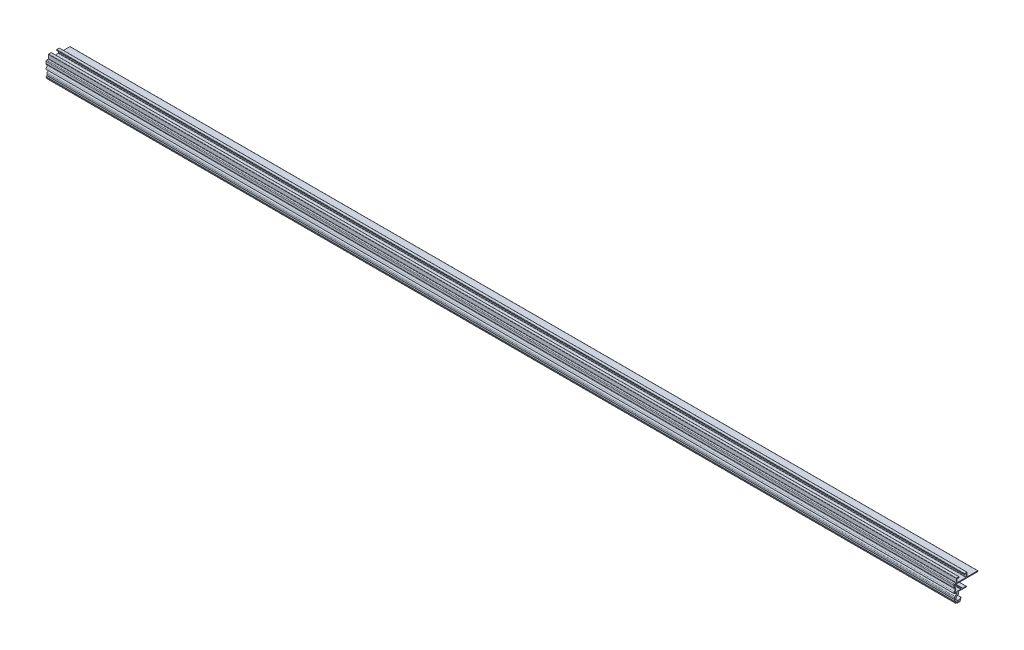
ISO-10303-21;
HEADER;
FILE_DESCRIPTION(('STEP AP214'),'2;1');
FILE_NAME('part.step','',(''),(''),'','','');
FILE_SCHEMA(('AUTOMOTIVE_DESIGN { 1 0 10303 214 1 1 1 1 }'));
ENDSEC;
DATA;
#1=APPLICATION_CONTEXT('core data for automotive mechanical design processes');
#2=APPLICATION_PROTOCOL_DEFINITION('international standard','automotive_design',2000,#1);
#3=PRODUCT_CONTEXT('',#1,'mechanical');
#4=PRODUCT('Part','Part','',(#3));
#5=PRODUCT_RELATED_PRODUCT_CATEGORY('part','',(#4));
#6=PRODUCT_DEFINITION_FORMATION('','',#4);
#7=PRODUCT_DEFINITION_CONTEXT('part definition',#1,'design');
#8=PRODUCT_DEFINITION('design','',#6,#7);
#9=PRODUCT_DEFINITION_SHAPE('','',#8);
#10=(LENGTH_UNIT() NAMED_UNIT(*) SI_UNIT(.MILLI.,.METRE.));
#11=(NAMED_UNIT(*) PLANE_ANGLE_UNIT() SI_UNIT($,.RADIAN.));
#12=(NAMED_UNIT(*) SI_UNIT($,.STERADIAN.) SOLID_ANGLE_UNIT());
#13=UNCERTAINTY_MEASURE_WITH_UNIT(LENGTH_MEASURE(1.E-05),#10,'distance_accuracy_value','');
#14=(GEOMETRIC_REPRESENTATION_CONTEXT(3) GLOBAL_UNCERTAINTY_ASSIGNED_CONTEXT((#13)) GLOBAL_UNIT_ASSIGNED_CONTEXT((#10,
#11,#12)) REPRESENTATION_CONTEXT('',''));
#15=CARTESIAN_POINT('',(0.,0.,0.));
#16=DIRECTION('',(0.,0.,1.));
#17=DIRECTION('',(1.,0.,0.));
#18=AXIS2_PLACEMENT_3D('',#15,#16,#17);
#19=CARTESIAN_POINT('',(1087.,-20.3993857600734,-4.80977587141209));
#20=DIRECTION('',(-1.,0.,0.));
#21=DIRECTION('',(0.,0.,1.));
#22=AXIS2_PLACEMENT_3D('',#19,#20,#21);
#23=CYLINDRICAL_SURFACE('',#22,0.100000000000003);
#24=CARTESIAN_POINT('',(0.,-20.3993857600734,-4.80977587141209));
#25=DIRECTION('',(1.,0.,0.));
#26=DIRECTION('',(0.,0.,-1.));
#27=AXIS2_PLACEMENT_3D('',#24,#25,#26);
#28=CIRCLE('',#27,0.100000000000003);
#29=CARTESIAN_POINT('',(0.,-20.3802233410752,-4.90792270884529));
#30=VERTEX_POINT('',#29);
#31=CARTESIAN_POINT('',(0.,-20.3606635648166,-4.71757721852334));
#32=VERTEX_POINT('',#31);
#33=EDGE_CURVE('E686',#30,#32,#28,.T.);
#34=ORIENTED_EDGE('',*,*,#33,.T.);
#35=DIRECTION('',(-1.,0.,0.));
#36=VECTOR('',#35,1.);
#37=CARTESIAN_POINT('',(1087.,-20.3606635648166,-4.71757721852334));
#38=LINE('',#37,#36);
#39=CARTESIAN_POINT('',(1087.,-20.3606635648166,-4.71757721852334));
#40=VERTEX_POINT('',#39);
#41=EDGE_CURVE('E11',#40,#32,#38,.T.);
#42=ORIENTED_EDGE('',*,*,#41,.F.);
#43=CARTESIAN_POINT('',(1087.,-20.3993857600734,-4.80977587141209));
#44=DIRECTION('',(1.,0.,0.));
#45=DIRECTION('',(0.,0.,-1.));
#46=AXIS2_PLACEMENT_3D('',#43,#44,#45);
#47=CIRCLE('',#46,0.100000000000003);
#48=CARTESIAN_POINT('',(1087.,-20.3802233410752,-4.90792270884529));
#49=VERTEX_POINT('',#48);
#50=EDGE_CURVE('E892',#49,#40,#47,.T.);
#51=ORIENTED_EDGE('',*,*,#50,.F.);
#52=DIRECTION('',(-1.,0.,0.));
#53=VECTOR('',#52,1.);
#54=CARTESIAN_POINT('',(1087.,-20.3802233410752,-4.90792270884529));
#55=LINE('',#54,#53);
#56=EDGE_CURVE('E682',#49,#30,#55,.T.);
#57=ORIENTED_EDGE('',*,*,#56,.T.);
#58=EDGE_LOOP('',(#34,#42,#51,#57));
#59=FACE_BOUND('',#58,.T.);
#60=ADVANCED_FACE('F32',(#59),#23,.T.);
#61=CARTESIAN_POINT('',(1087.,-19.257081,-2.08991561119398));
#62=DIRECTION('',(-1.,0.,0.));
#63=DIRECTION('',(0.,0.,1.));
#64=AXIS2_PLACEMENT_3D('',#61,#62,#63);
#65=CYLINDRICAL_SURFACE('',#64,2.85);
#66=CARTESIAN_POINT('',(0.,-19.257081,-2.08991561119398));
#67=DIRECTION('',(-1.,0.,0.));
#68=DIRECTION('',(0.,0.,-1.));
#69=AXIS2_PLACEMENT_3D('',#66,#67,#68);
#70=CIRCLE('',#69,2.85);
#71=CARTESIAN_POINT('',(0.,-16.4084997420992,-2.));
#72=VERTEX_POINT('',#71);
#73=EDGE_CURVE('E689',#32,#72,#70,.T.);
#74=ORIENTED_EDGE('',*,*,#73,.T.);
#75=DIRECTION('',(-1.,0.,0.));
#76=VECTOR('',#75,1.);
#77=CARTESIAN_POINT('',(1087.,-16.4084997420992,-2.));
#78=LINE('',#77,#76);
#79=CARTESIAN_POINT('',(1087.,-16.4084997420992,-2.));
#80=VERTEX_POINT('',#79);
#81=EDGE_CURVE('E40',#80,#72,#78,.T.);
#82=ORIENTED_EDGE('',*,*,#81,.F.);
#83=CARTESIAN_POINT('',(1087.,-19.257081,-2.08991561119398));
#84=DIRECTION('',(-1.,0.,0.));
#85=DIRECTION('',(0.,0.,-1.));
#86=AXIS2_PLACEMENT_3D('',#83,#84,#85);
#87=CIRCLE('',#86,2.85);
#88=EDGE_CURVE('E370',#40,#80,#87,.T.);
#89=ORIENTED_EDGE('',*,*,#88,.F.);
#90=ORIENTED_EDGE('',*,*,#41,.T.);
#91=EDGE_LOOP('',(#74,#82,#89,#90));
#92=FACE_BOUND('',#91,.T.);
#93=ADVANCED_FACE('F1414',(#92),#65,.F.);
#94=CARTESIAN_POINT('',(1087.,-13.257081,-2.));
#95=DIRECTION('',(0.,0.,1.));
#96=DIRECTION('',(1.,0.,0.));
#97=AXIS2_PLACEMENT_3D('',#94,#95,#96);
#98=PLANE('',#97);
#99=DIRECTION('',(0.,1.,0.));
#100=VECTOR('',#99,1.);
#101=CARTESIAN_POINT('',(0.,-13.257081,-2.));
#102=LINE('',#101,#100);
#103=CARTESIAN_POINT('',(0.,-13.257081,-2.));
#104=VERTEX_POINT('',#103);
#105=EDGE_CURVE('E691',#72,#104,#102,.T.);
#106=ORIENTED_EDGE('',*,*,#105,.T.);
#107=DIRECTION('',(-1.,0.,0.));
#108=VECTOR('',#107,1.);
#109=CARTESIAN_POINT('',(1087.,-13.257081,-2.));
#110=LINE('',#109,#108);
#111=CARTESIAN_POINT('',(1087.,-13.257081,-2.));
#112=VERTEX_POINT('',#111);
#113=EDGE_CURVE('E1178',#112,#104,#110,.T.);
#114=ORIENTED_EDGE('',*,*,#113,.F.);
#115=DIRECTION('',(0.,1.,0.));
#116=VECTOR('',#115,1.);
#117=CARTESIAN_POINT('',(1087.,-13.257081,-2.));
#118=LINE('',#117,#116);
#119=EDGE_CURVE('E1186',#80,#112,#118,.T.);
#120=ORIENTED_EDGE('',*,*,#119,.F.);
#121=ORIENTED_EDGE('',*,*,#81,.T.);
#122=EDGE_LOOP('',(#106,#114,#120,#121));
#123=FACE_BOUND('',#122,.T.);
#124=ADVANCED_FACE('F1184',(#123),#98,.F.);
#125=CARTESIAN_POINT('',(1087.,-13.257081,-2.));
#126=DIRECTION('',(0.,1.,0.));
#127=DIRECTION('',(0.,0.,1.));
#128=AXIS2_PLACEMENT_3D('',#125,#126,#127);
#129=PLANE('',#128);
#130=DIRECTION('',(0.,0.,-1.));
#131=VECTOR('',#130,1.);
#132=CARTESIAN_POINT('',(0.,-13.257081,-2.));
#133=LINE('',#132,#131);
#134=CARTESIAN_POINT('',(0.,-13.257081,-11.1));
#135=VERTEX_POINT('',#134);
#136=EDGE_CURVE('E693',#104,#135,#133,.T.);
#137=ORIENTED_EDGE('',*,*,#136,.T.);
#138=DIRECTION('',(-1.,0.,0.));
#139=VECTOR('',#138,1.);
#140=CARTESIAN_POINT('',(1087.,-13.257081,-11.1));
#141=LINE('',#140,#139);
#142=CARTESIAN_POINT('',(1087.,-13.257081,-11.1));
#143=VERTEX_POINT('',#142);
#144=EDGE_CURVE('E1175',#143,#135,#141,.T.);
#145=ORIENTED_EDGE('',*,*,#144,.F.);
#146=DIRECTION('',(0.,0.,-1.));
#147=VECTOR('',#146,1.);
#148=CARTESIAN_POINT('',(1087.,-13.257081,-2.));
#149=LINE('',#148,#147);
#150=EDGE_CURVE('E1204',#112,#143,#149,.T.);
#151=ORIENTED_EDGE('',*,*,#150,.F.);
#152=ORIENTED_EDGE('',*,*,#113,.T.);
#153=EDGE_LOOP('',(#137,#145,#151,#152));
#154=FACE_BOUND('',#153,.T.);
#155=ADVANCED_FACE('F1195',(#154),#129,.F.);
#156=CARTESIAN_POINT('',(1087.,-12.857081,-11.1));
#157=DIRECTION('',(-1.,0.,0.));
#158=DIRECTION('',(0.,0.,1.));
#159=AXIS2_PLACEMENT_3D('',#156,#157,#158);
#160=CYLINDRICAL_SURFACE('',#159,0.399999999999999);
#161=CARTESIAN_POINT('',(0.,-12.857081,-11.1));
#162=DIRECTION('',(1.,0.,0.));
#163=DIRECTION('',(0.,0.,-1.));
#164=AXIS2_PLACEMENT_3D('',#161,#162,#163);
#165=CIRCLE('',#164,0.399999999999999);
#166=CARTESIAN_POINT('',(0.,-12.857081,-11.5));
#167=VERTEX_POINT('',#166);
#168=EDGE_CURVE('E695',#135,#167,#165,.T.);
#169=ORIENTED_EDGE('',*,*,#168,.T.);
#170=DIRECTION('',(-1.,0.,0.));
#171=VECTOR('',#170,1.);
#172=CARTESIAN_POINT('',(1087.,-12.857081,-11.5));
#173=LINE('',#172,#171);
#174=CARTESIAN_POINT('',(1087.,-12.857081,-11.5));
#175=VERTEX_POINT('',#174);
#176=EDGE_CURVE('E1172',#175,#167,#173,.T.);
#177=ORIENTED_EDGE('',*,*,#176,.F.);
#178=CARTESIAN_POINT('',(1087.,-12.857081,-11.1));
#179=DIRECTION('',(1.,0.,0.));
#180=DIRECTION('',(0.,0.,-1.));
#181=AXIS2_PLACEMENT_3D('',#178,#179,#180);
#182=CIRCLE('',#181,0.399999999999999);
#183=EDGE_CURVE('E1201',#143,#175,#182,.T.);
#184=ORIENTED_EDGE('',*,*,#183,.F.);
#185=ORIENTED_EDGE('',*,*,#144,.T.);
#186=EDGE_LOOP('',(#169,#177,#184,#185));
#187=FACE_BOUND('',#186,.T.);
#188=ADVANCED_FACE('F1199',(#187),#160,.T.);
#189=CARTESIAN_POINT('',(1087.,-12.657081,-11.5));
#190=DIRECTION('',(0.,0.,1.));
#191=DIRECTION('',(1.,0.,0.));
#192=AXIS2_PLACEMENT_3D('',#189,#190,#191);
#193=PLANE('',#192);
#194=DIRECTION('',(0.,1.,0.));
#195=VECTOR('',#194,1.);
#196=CARTESIAN_POINT('',(0.,-12.657081,-11.5));
#197=LINE('',#196,#195);
#198=CARTESIAN_POINT('',(0.,-12.657081,-11.5));
#199=VERTEX_POINT('',#198);
#200=EDGE_CURVE('E697',#167,#199,#197,.T.);
#201=ORIENTED_EDGE('',*,*,#200,.T.);
#202=DIRECTION('',(-1.,0.,0.));
#203=VECTOR('',#202,1.);
#204=CARTESIAN_POINT('',(1087.,-12.657081,-11.5));
#205=LINE('',#204,#203);
#206=CARTESIAN_POINT('',(1087.,-12.657081,-11.5));
#207=VERTEX_POINT('',#206);
#208=EDGE_CURVE('E1169',#207,#199,#205,.T.);
#209=ORIENTED_EDGE('',*,*,#208,.F.);
#210=DIRECTION('',(0.,1.,0.));
#211=VECTOR('',#210,1.);
#212=CARTESIAN_POINT('',(1087.,-12.657081,-11.5));
#213=LINE('',#212,#211);
#214=EDGE_CURVE('E1203',#175,#207,#213,.T.);
#215=ORIENTED_EDGE('',*,*,#214,.F.);
#216=ORIENTED_EDGE('',*,*,#176,.T.);
#217=EDGE_LOOP('',(#201,#209,#215,#216));
#218=FACE_BOUND('',#217,.T.);
#219=ADVANCED_FACE('F1427',(#218),#193,.F.);
#220=CARTESIAN_POINT('',(1087.,-12.657081,-11.1));
#221=DIRECTION('',(-1.,0.,0.));
#222=DIRECTION('',(0.,0.,1.));
#223=AXIS2_PLACEMENT_3D('',#220,#221,#222);
#224=CYLINDRICAL_SURFACE('',#223,0.399999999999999);
#225=CARTESIAN_POINT('',(0.,-12.657081,-11.1));
#226=DIRECTION('',(1.,0.,0.));
#227=DIRECTION('',(0.,0.,1.));
#228=AXIS2_PLACEMENT_3D('',#225,#226,#227);
#229=CIRCLE('',#228,0.399999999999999);
#230=CARTESIAN_POINT('',(0.,-12.257081,-11.1));
#231=VERTEX_POINT('',#230);
#232=EDGE_CURVE('E699',#199,#231,#229,.T.);
#233=ORIENTED_EDGE('',*,*,#232,.T.);
#234=DIRECTION('',(-1.,0.,0.));
#235=VECTOR('',#234,1.);
#236=CARTESIAN_POINT('',(1087.,-12.257081,-11.1));
#237=LINE('',#236,#235);
#238=CARTESIAN_POINT('',(1087.,-12.257081,-11.1));
#239=VERTEX_POINT('',#238);
#240=EDGE_CURVE('E1166',#239,#231,#237,.T.);
#241=ORIENTED_EDGE('',*,*,#240,.F.);
#242=CARTESIAN_POINT('',(1087.,-12.657081,-11.1));
#243=DIRECTION('',(1.,0.,0.));
#244=DIRECTION('',(0.,0.,1.));
#245=AXIS2_PLACEMENT_3D('',#242,#243,#244);
#246=CIRCLE('',#245,0.399999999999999);
#247=EDGE_CURVE('E1206',#207,#239,#246,.T.);
#248=ORIENTED_EDGE('',*,*,#247,.F.);
#249=ORIENTED_EDGE('',*,*,#208,.T.);
#250=EDGE_LOOP('',(#233,#241,#248,#249));
#251=FACE_BOUND('',#250,.T.);
#252=ADVANCED_FACE('F1430',(#251),#224,.T.);
#253=CARTESIAN_POINT('',(1087.,-12.257081,-7.16568542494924));
#254=DIRECTION('',(0.,-1.,0.));
#255=DIRECTION('',(0.,0.,-1.));
#256=AXIS2_PLACEMENT_3D('',#253,#254,#255);
#257=PLANE('',#256);
#258=DIRECTION('',(0.,0.,1.));
#259=VECTOR('',#258,1.);
#260=CARTESIAN_POINT('',(0.,-12.257081,-7.16568542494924));
#261=LINE('',#260,#259);
#262=CARTESIAN_POINT('',(0.,-12.257081,-7.16568542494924));
#263=VERTEX_POINT('',#262);
#264=EDGE_CURVE('E701',#231,#263,#261,.T.);
#265=ORIENTED_EDGE('',*,*,#264,.T.);
#266=DIRECTION('',(-1.,0.,0.));
#267=VECTOR('',#266,1.);
#268=CARTESIAN_POINT('',(1087.,-12.257081,-7.16568542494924));
#269=LINE('',#268,#267);
#270=CARTESIAN_POINT('',(1087.,-12.257081,-7.16568542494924));
#271=VERTEX_POINT('',#270);
#272=EDGE_CURVE('E1163',#271,#263,#269,.T.);
#273=ORIENTED_EDGE('',*,*,#272,.F.);
#274=DIRECTION('',(0.,0.,1.));
#275=VECTOR('',#274,1.);
#276=CARTESIAN_POINT('',(1087.,-12.257081,-7.16568542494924));
#277=LINE('',#276,#275);
#278=EDGE_CURVE('E1212',#239,#271,#277,.T.);
#279=ORIENTED_EDGE('',*,*,#278,.F.);
#280=ORIENTED_EDGE('',*,*,#240,.T.);
#281=EDGE_LOOP('',(#265,#273,#279,#280));
#282=FACE_BOUND('',#281,.T.);
#283=ADVANCED_FACE('F1434',(#282),#257,.F.);
#284=CARTESIAN_POINT('',(1087.,-11.857081,-7.16568542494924));
#285=DIRECTION('',(-1.,0.,0.));
#286=DIRECTION('',(0.,0.,1.));
#287=AXIS2_PLACEMENT_3D('',#284,#285,#286);
#288=CYLINDRICAL_SURFACE('',#287,0.4);
#289=CARTESIAN_POINT('',(0.,-11.857081,-7.16568542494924));
#290=DIRECTION('',(-1.,0.,0.));
#291=DIRECTION('',(0.,0.,-1.));
#292=AXIS2_PLACEMENT_3D('',#289,#290,#291);
#293=CIRCLE('',#292,0.4);
#294=CARTESIAN_POINT('',(0.,-12.1399237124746,-6.88284271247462));
#295=VERTEX_POINT('',#294);
#296=EDGE_CURVE('E703',#263,#295,#293,.T.);
#297=ORIENTED_EDGE('',*,*,#296,.T.);
#298=DIRECTION('',(-1.,0.,0.));
#299=VECTOR('',#298,1.);
#300=CARTESIAN_POINT('',(1087.,-12.1399237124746,-6.88284271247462));
#301=LINE('',#300,#299);
#302=CARTESIAN_POINT('',(1087.,-12.1399237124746,-6.88284271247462));
#303=VERTEX_POINT('',#302);
#304=EDGE_CURVE('E1160',#303,#295,#301,.T.);
#305=ORIENTED_EDGE('',*,*,#304,.F.);
#306=CARTESIAN_POINT('',(1087.,-11.857081,-7.16568542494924));
#307=DIRECTION('',(-1.,0.,0.));
#308=DIRECTION('',(0.,0.,-1.));
#309=AXIS2_PLACEMENT_3D('',#306,#307,#308);
#310=CIRCLE('',#309,0.4);
#311=EDGE_CURVE('E1214',#271,#303,#310,.T.);
#312=ORIENTED_EDGE('',*,*,#311,.F.);
#313=ORIENTED_EDGE('',*,*,#272,.T.);
#314=EDGE_LOOP('',(#297,#305,#312,#313));
#315=FACE_BOUND('',#314,.T.);
#316=ADVANCED_FACE('F1438',(#315),#288,.F.);
#317=CARTESIAN_POINT('',(1087.,-12.1399237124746,-6.88284271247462));
#318=DIRECTION('',(0.,-0.707106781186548,0.707106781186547));
#319=DIRECTION('',(0.,-0.707106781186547,-0.707106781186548));
#320=AXIS2_PLACEMENT_3D('',#317,#318,#319);
#321=PLANE('',#320);
#322=DIRECTION('',(0.,0.707106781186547,0.707106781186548));
#323=VECTOR('',#322,1.);
#324=CARTESIAN_POINT('',(0.,-12.1399237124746,-6.88284271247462));
#325=LINE('',#324,#323);
#326=CARTESIAN_POINT('',(0.,-8.29728302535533,-3.04020202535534));
#327=VERTEX_POINT('',#326);
#328=EDGE_CURVE('E705',#295,#327,#325,.T.);
#329=ORIENTED_EDGE('',*,*,#328,.T.);
#330=DIRECTION('',(-1.,0.,0.));
#331=VECTOR('',#330,1.);
#332=CARTESIAN_POINT('',(1087.,-8.29728302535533,-3.04020202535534));
#333=LINE('',#332,#331);
#334=CARTESIAN_POINT('',(1087.,-8.29728302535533,-3.04020202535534));
#335=VERTEX_POINT('',#334);
#336=EDGE_CURVE('E1157',#335,#327,#333,.T.);
#337=ORIENTED_EDGE('',*,*,#336,.F.);
#338=DIRECTION('',(0.,0.707106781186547,0.707106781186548));
#339=VECTOR('',#338,1.);
#340=CARTESIAN_POINT('',(1087.,-12.1399237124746,-6.88284271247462));
#341=LINE('',#340,#339);
#342=EDGE_CURVE('E1216',#303,#335,#341,.T.);
#343=ORIENTED_EDGE('',*,*,#342,.F.);
#344=ORIENTED_EDGE('',*,*,#304,.T.);
#345=EDGE_LOOP('',(#329,#337,#343,#344));
#346=FACE_BOUND('',#345,.T.);
#347=ADVANCED_FACE('F1442',(#346),#321,.F.);
#348=CARTESIAN_POINT('',(1087.,-8.58012573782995,-2.75735931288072));
#349=DIRECTION('',(-1.,0.,0.));
#350=DIRECTION('',(0.,0.,1.));
#351=AXIS2_PLACEMENT_3D('',#348,#349,#350);
#352=CYLINDRICAL_SURFACE('',#351,0.399999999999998);
#353=CARTESIAN_POINT('',(0.,-8.58012573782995,-2.75735931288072));
#354=DIRECTION('',(1.,0.,0.));
#355=DIRECTION('',(0.,0.,-1.));
#356=AXIS2_PLACEMENT_3D('',#353,#354,#355);
#357=CIRCLE('',#356,0.399999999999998);
#358=CARTESIAN_POINT('',(0.,-8.29728302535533,-2.4745166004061));
#359=VERTEX_POINT('',#358);
#360=EDGE_CURVE('E707',#327,#359,#357,.T.);
#361=ORIENTED_EDGE('',*,*,#360,.T.);
#362=DIRECTION('',(-1.,0.,0.));
#363=VECTOR('',#362,1.);
#364=CARTESIAN_POINT('',(1087.,-8.29728302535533,-2.4745166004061));
#365=LINE('',#364,#363);
#366=CARTESIAN_POINT('',(1087.,-8.29728302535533,-2.4745166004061));
#367=VERTEX_POINT('',#366);
#368=EDGE_CURVE('E1154',#367,#359,#365,.T.);
#369=ORIENTED_EDGE('',*,*,#368,.F.);
#370=CARTESIAN_POINT('',(1087.,-8.58012573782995,-2.75735931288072));
#371=DIRECTION('',(1.,0.,0.));
#372=DIRECTION('',(0.,0.,-1.));
#373=AXIS2_PLACEMENT_3D('',#370,#371,#372);
#374=CIRCLE('',#373,0.399999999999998);
#375=EDGE_CURVE('E1218',#335,#367,#374,.T.);
#376=ORIENTED_EDGE('',*,*,#375,.F.);
#377=ORIENTED_EDGE('',*,*,#336,.T.);
#378=EDGE_LOOP('',(#361,#369,#376,#377));
#379=FACE_BOUND('',#378,.T.);
#380=ADVANCED_FACE('F1446',(#379),#352,.T.);
#381=CARTESIAN_POINT('',(1087.,-8.29728302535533,-2.4745166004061));
#382=DIRECTION('',(0.,-0.707106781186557,-0.707106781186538));
#383=DIRECTION('',(0.,0.707106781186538,-0.707106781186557));
#384=AXIS2_PLACEMENT_3D('',#381,#382,#383);
#385=PLANE('',#384);
#386=DIRECTION('',(0.,-0.707106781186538,0.707106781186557));
#387=VECTOR('',#386,1.);
#388=CARTESIAN_POINT('',(0.,-8.29728302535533,-2.4745166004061));
#389=LINE('',#388,#387);
#390=CARTESIAN_POINT('',(0.,-8.43870438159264,-2.33309524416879));
#391=VERTEX_POINT('',#390);
#392=EDGE_CURVE('E709',#359,#391,#389,.T.);
#393=ORIENTED_EDGE('',*,*,#392,.T.);
#394=DIRECTION('',(-1.,0.,0.));
#395=VECTOR('',#394,1.);
#396=CARTESIAN_POINT('',(1087.,-8.43870438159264,-2.33309524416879));
#397=LINE('',#396,#395);
#398=CARTESIAN_POINT('',(1087.,-8.43870438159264,-2.33309524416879));
#399=VERTEX_POINT('',#398);
#400=EDGE_CURVE('E1151',#399,#391,#397,.T.);
#401=ORIENTED_EDGE('',*,*,#400,.F.);
#402=DIRECTION('',(0.,-0.707106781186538,0.707106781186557));
#403=VECTOR('',#402,1.);
#404=CARTESIAN_POINT('',(1087.,-8.29728302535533,-2.4745166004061));
#405=LINE('',#404,#403);
#406=EDGE_CURVE('E1220',#367,#399,#405,.T.);
#407=ORIENTED_EDGE('',*,*,#406,.F.);
#408=ORIENTED_EDGE('',*,*,#368,.T.);
#409=EDGE_LOOP('',(#393,#401,#407,#408));
#410=FACE_BOUND('',#409,.T.);
#411=ADVANCED_FACE('F1450',(#410),#385,.F.);
#412=CARTESIAN_POINT('',(1087.,-8.72154709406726,-2.61593795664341));
#413=DIRECTION('',(-1.,0.,0.));
#414=DIRECTION('',(0.,0.,1.));
#415=AXIS2_PLACEMENT_3D('',#412,#413,#414);
#416=CYLINDRICAL_SURFACE('',#415,0.400000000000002);
#417=CARTESIAN_POINT('',(0.,-8.72154709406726,-2.61593795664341));
#418=DIRECTION('',(1.,0.,0.));
#419=DIRECTION('',(0.,0.,-1.));
#420=AXIS2_PLACEMENT_3D('',#417,#418,#419);
#421=CIRCLE('',#420,0.400000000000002);
#422=CARTESIAN_POINT('',(0.,-9.00438980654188,-2.33309524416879));
#423=VERTEX_POINT('',#422);
#424=EDGE_CURVE('E711',#391,#423,#421,.T.);
#425=ORIENTED_EDGE('',*,*,#424,.T.);
#426=DIRECTION('',(-1.,0.,0.));
#427=VECTOR('',#426,1.);
#428=CARTESIAN_POINT('',(1087.,-9.00438980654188,-2.33309524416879));
#429=LINE('',#428,#427);
#430=CARTESIAN_POINT('',(1087.,-9.00438980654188,-2.33309524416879));
#431=VERTEX_POINT('',#430);
#432=EDGE_CURVE('E1148',#431,#423,#429,.T.);
#433=ORIENTED_EDGE('',*,*,#432,.F.);
#434=CARTESIAN_POINT('',(1087.,-8.72154709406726,-2.61593795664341));
#435=DIRECTION('',(1.,0.,0.));
#436=DIRECTION('',(0.,0.,-1.));
#437=AXIS2_PLACEMENT_3D('',#434,#435,#436);
#438=CIRCLE('',#437,0.400000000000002);
#439=EDGE_CURVE('E1222',#399,#431,#438,.T.);
#440=ORIENTED_EDGE('',*,*,#439,.F.);
#441=ORIENTED_EDGE('',*,*,#400,.T.);
#442=EDGE_LOOP('',(#425,#433,#440,#441));
#443=FACE_BOUND('',#442,.T.);
#444=ADVANCED_FACE('F1454',(#443),#416,.T.);
#445=CARTESIAN_POINT('',(1087.,-11.5742382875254,-4.90294372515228));
#446=DIRECTION('',(0.,0.707106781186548,-0.707106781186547));
#447=DIRECTION('',(0.,0.707106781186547,0.707106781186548));
#448=AXIS2_PLACEMENT_3D('',#445,#446,#447);
#449=PLANE('',#448);
#450=DIRECTION('',(0.,-0.707106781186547,-0.707106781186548));
#451=VECTOR('',#450,1.);
#452=CARTESIAN_POINT('',(0.,-11.5742382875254,-4.90294372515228));
#453=LINE('',#452,#451);
#454=CARTESIAN_POINT('',(0.,-11.5742382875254,-4.90294372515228));
#455=VERTEX_POINT('',#454);
#456=EDGE_CURVE('E713',#423,#455,#453,.T.);
#457=ORIENTED_EDGE('',*,*,#456,.T.);
#458=DIRECTION('',(-1.,0.,0.));
#459=VECTOR('',#458,1.);
#460=CARTESIAN_POINT('',(1087.,-11.5742382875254,-4.90294372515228));
#461=LINE('',#460,#459);
#462=CARTESIAN_POINT('',(1087.,-11.5742382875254,-4.90294372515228));
#463=VERTEX_POINT('',#462);
#464=EDGE_CURVE('E1145',#463,#455,#461,.T.);
#465=ORIENTED_EDGE('',*,*,#464,.F.);
#466=DIRECTION('',(0.,-0.707106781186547,-0.707106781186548));
#467=VECTOR('',#466,1.);
#468=CARTESIAN_POINT('',(1087.,-11.5742382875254,-4.90294372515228));
#469=LINE('',#468,#467);
#470=EDGE_CURVE('E1224',#431,#463,#469,.T.);
#471=ORIENTED_EDGE('',*,*,#470,.F.);
#472=ORIENTED_EDGE('',*,*,#432,.T.);
#473=EDGE_LOOP('',(#457,#465,#471,#472));
#474=FACE_BOUND('',#473,.T.);
#475=ADVANCED_FACE('F1458',(#474),#449,.F.);
#476=CARTESIAN_POINT('',(1087.,-11.857081,-4.62010101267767));
#477=DIRECTION('',(-1.,0.,0.));
#478=DIRECTION('',(0.,0.,1.));
#479=AXIS2_PLACEMENT_3D('',#476,#477,#478);
#480=CYLINDRICAL_SURFACE('',#479,0.4);
#481=CARTESIAN_POINT('',(0.,-11.857081,-4.62010101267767));
#482=DIRECTION('',(-1.,0.,0.));
#483=DIRECTION('',(0.,0.,1.));
#484=AXIS2_PLACEMENT_3D('',#481,#482,#483);
#485=CIRCLE('',#484,0.4);
#486=CARTESIAN_POINT('',(0.,-12.257081,-4.62010101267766));
#487=VERTEX_POINT('',#486);
#488=EDGE_CURVE('E715',#455,#487,#485,.T.);
#489=ORIENTED_EDGE('',*,*,#488,.T.);
#490=DIRECTION('',(-1.,0.,0.));
#491=VECTOR('',#490,1.);
#492=CARTESIAN_POINT('',(1087.,-12.257081,-4.62010101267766));
#493=LINE('',#492,#491);
#494=CARTESIAN_POINT('',(1087.,-12.257081,-4.62010101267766));
#495=VERTEX_POINT('',#494);
#496=EDGE_CURVE('E1142',#495,#487,#493,.T.);
#497=ORIENTED_EDGE('',*,*,#496,.F.);
#498=CARTESIAN_POINT('',(1087.,-11.857081,-4.62010101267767));
#499=DIRECTION('',(-1.,0.,0.));
#500=DIRECTION('',(0.,0.,1.));
#501=AXIS2_PLACEMENT_3D('',#498,#499,#500);
#502=CIRCLE('',#501,0.4);
#503=EDGE_CURVE('E1226',#463,#495,#502,.T.);
#504=ORIENTED_EDGE('',*,*,#503,.F.);
#505=ORIENTED_EDGE('',*,*,#464,.T.);
#506=EDGE_LOOP('',(#489,#497,#504,#505));
#507=FACE_BOUND('',#506,.T.);
#508=ADVANCED_FACE('F1462',(#507),#480,.F.);
#509=CARTESIAN_POINT('',(1087.,-12.257081,1.979347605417));
#510=DIRECTION('',(0.,-1.,0.));
#511=DIRECTION('',(0.,0.,-1.));
#512=AXIS2_PLACEMENT_3D('',#509,#510,#511);
#513=PLANE('',#512);
#514=DIRECTION('',(0.,0.,1.));
#515=VECTOR('',#514,1.);
#516=CARTESIAN_POINT('',(0.,-12.257081,1.979347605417));
#517=LINE('',#516,#515);
#518=CARTESIAN_POINT('',(0.,-12.257081,1.979347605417));
#519=VERTEX_POINT('',#518);
#520=EDGE_CURVE('E717',#487,#519,#517,.T.);
#521=ORIENTED_EDGE('',*,*,#520,.T.);
#522=DIRECTION('',(-1.,0.,0.));
#523=VECTOR('',#522,1.);
#524=CARTESIAN_POINT('',(1087.,-12.257081,1.979347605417));
#525=LINE('',#524,#523);
#526=CARTESIAN_POINT('',(1087.,-12.257081,1.979347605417));
#527=VERTEX_POINT('',#526);
#528=EDGE_CURVE('E1139',#527,#519,#525,.T.);
#529=ORIENTED_EDGE('',*,*,#528,.F.);
#530=DIRECTION('',(0.,0.,1.));
#531=VECTOR('',#530,1.);
#532=CARTESIAN_POINT('',(1087.,-12.257081,1.979347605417));
#533=LINE('',#532,#531);
#534=EDGE_CURVE('E1228',#495,#527,#533,.T.);
#535=ORIENTED_EDGE('',*,*,#534,.F.);
#536=ORIENTED_EDGE('',*,*,#496,.T.);
#537=EDGE_LOOP('',(#521,#529,#535,#536));
#538=FACE_BOUND('',#537,.T.);
#539=ADVANCED_FACE('F1466',(#538),#513,.F.);
#540=CARTESIAN_POINT('',(1087.,-11.8656266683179,1.979347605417));
#541=DIRECTION('',(-1.,0.,0.));
#542=DIRECTION('',(0.,0.,1.));
#543=AXIS2_PLACEMENT_3D('',#540,#541,#542);
#544=CYLINDRICAL_SURFACE('',#543,0.391454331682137);
#545=CARTESIAN_POINT('',(0.,-11.8656266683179,1.979347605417));
#546=DIRECTION('',(-1.,0.,0.));
#547=DIRECTION('',(0.,0.,-1.));
#548=AXIS2_PLACEMENT_3D('',#545,#546,#547);
#549=CIRCLE('',#548,0.391454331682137);
#550=CARTESIAN_POINT('',(0.,-11.5610758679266,2.22528520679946));
#551=VERTEX_POINT('',#550);
#552=EDGE_CURVE('E719',#519,#551,#549,.T.);
#553=ORIENTED_EDGE('',*,*,#552,.T.);
#554=DIRECTION('',(-1.,0.,0.));
#555=VECTOR('',#554,1.);
#556=CARTESIAN_POINT('',(1087.,-11.5610758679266,2.22528520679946));
#557=LINE('',#556,#555);
#558=CARTESIAN_POINT('',(1087.,-11.5610758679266,2.22528520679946));
#559=VERTEX_POINT('',#558);
#560=EDGE_CURVE('E1136',#559,#551,#557,.T.);
#561=ORIENTED_EDGE('',*,*,#560,.F.);
#562=CARTESIAN_POINT('',(1087.,-11.8656266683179,1.979347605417));
#563=DIRECTION('',(-1.,0.,0.));
#564=DIRECTION('',(0.,0.,-1.));
#565=AXIS2_PLACEMENT_3D('',#562,#563,#564);
#566=CIRCLE('',#565,0.391454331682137);
#567=EDGE_CURVE('E1230',#527,#559,#566,.T.);
#568=ORIENTED_EDGE('',*,*,#567,.F.);
#569=ORIENTED_EDGE('',*,*,#528,.T.);
#570=EDGE_LOOP('',(#553,#561,#568,#569));
#571=FACE_BOUND('',#570,.T.);
#572=ADVANCED_FACE('F1470',(#571),#544,.F.);
#573=CARTESIAN_POINT('',(1087.,-9.22708099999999,4.11008438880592));
#574=DIRECTION('',(-1.,0.,0.));
#575=DIRECTION('',(0.,0.,1.));
#576=AXIS2_PLACEMENT_3D('',#573,#574,#575);
#577=CYLINDRICAL_SURFACE('',#576,3.);
#578=CARTESIAN_POINT('',(0.,-9.22708099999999,4.11008438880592));
#579=DIRECTION('',(1.,0.,0.));
#580=DIRECTION('',(0.,0.,-1.));
#581=AXIS2_PLACEMENT_3D('',#578,#579,#580);
#582=CIRCLE('',#581,3.);
#583=CARTESIAN_POINT('',(0.,-6.80486116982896,2.34009820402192));
#584=VERTEX_POINT('',#583);
#585=EDGE_CURVE('E721',#551,#584,#582,.T.);
#586=ORIENTED_EDGE('',*,*,#585,.T.);
#587=DIRECTION('',(-1.,0.,0.));
#588=VECTOR('',#587,1.);
#589=CARTESIAN_POINT('',(1087.,-6.80486116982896,2.34009820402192));
#590=LINE('',#589,#588);
#591=CARTESIAN_POINT('',(1087.,-6.80486116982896,2.34009820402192));
#592=VERTEX_POINT('',#591);
#593=EDGE_CURVE('E1133',#592,#584,#590,.T.);
#594=ORIENTED_EDGE('',*,*,#593,.F.);
#595=CARTESIAN_POINT('',(1087.,-9.22708099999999,4.11008438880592));
#596=DIRECTION('',(1.,0.,0.));
#597=DIRECTION('',(0.,0.,-1.));
#598=AXIS2_PLACEMENT_3D('',#595,#596,#597);
#599=CIRCLE('',#598,3.);
#600=EDGE_CURVE('E1232',#559,#592,#599,.T.);
#601=ORIENTED_EDGE('',*,*,#600,.F.);
#602=ORIENTED_EDGE('',*,*,#560,.T.);
#603=EDGE_LOOP('',(#586,#594,#601,#602));
#604=FACE_BOUND('',#603,.T.);
#605=ADVANCED_FACE('F1474',(#604),#577,.T.);
#606=CARTESIAN_POINT('',(1087.,-6.48997259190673,2.11));
#607=DIRECTION('',(-1.,0.,0.));
#608=DIRECTION('',(0.,0.,1.));
#609=AXIS2_PLACEMENT_3D('',#606,#607,#608);
#610=CYLINDRICAL_SURFACE('',#609,0.39);
#611=CARTESIAN_POINT('',(0.,-6.48997259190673,2.11));
#612=DIRECTION('',(-1.,0.,0.));
#613=DIRECTION('',(0.,0.,1.));
#614=AXIS2_PLACEMENT_3D('',#611,#612,#613);
#615=CIRCLE('',#614,0.39);
#616=CARTESIAN_POINT('',(0.,-6.48997259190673,2.5));
#617=VERTEX_POINT('',#616);
#618=EDGE_CURVE('E723',#584,#617,#615,.T.);
#619=ORIENTED_EDGE('',*,*,#618,.T.);
#620=DIRECTION('',(-1.,0.,0.));
#621=VECTOR('',#620,1.);
#622=CARTESIAN_POINT('',(1087.,-6.48997259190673,2.5));
#623=LINE('',#622,#621);
#624=CARTESIAN_POINT('',(1087.,-6.48997259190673,2.5));
#625=VERTEX_POINT('',#624);
#626=EDGE_CURVE('E1130',#625,#617,#623,.T.);
#627=ORIENTED_EDGE('',*,*,#626,.F.);
#628=CARTESIAN_POINT('',(1087.,-6.48997259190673,2.11));
#629=DIRECTION('',(-1.,0.,0.));
#630=DIRECTION('',(0.,0.,1.));
#631=AXIS2_PLACEMENT_3D('',#628,#629,#630);
#632=CIRCLE('',#631,0.39);
#633=EDGE_CURVE('E1234',#592,#625,#632,.T.);
#634=ORIENTED_EDGE('',*,*,#633,.F.);
#635=ORIENTED_EDGE('',*,*,#593,.T.);
#636=EDGE_LOOP('',(#619,#627,#634,#635));
#637=FACE_BOUND('',#636,.T.);
#638=ADVANCED_FACE('F1478',(#637),#610,.F.);
#639=CARTESIAN_POINT('',(1087.,-6.48997259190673,2.5));
#640=DIRECTION('',(0.,0.,1.));
#641=DIRECTION('',(0.,-1.,0.));
#642=AXIS2_PLACEMENT_3D('',#639,#640,#641);
#643=PLANE('',#642);
#644=DIRECTION('',(0.,1.,0.));
#645=VECTOR('',#644,1.);
#646=CARTESIAN_POINT('',(0.,-6.48997259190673,2.5));
#647=LINE('',#646,#645);
#648=CARTESIAN_POINT('',(0.,-4.457081,2.5));
#649=VERTEX_POINT('',#648);
#650=EDGE_CURVE('E725',#617,#649,#647,.T.);
#651=ORIENTED_EDGE('',*,*,#650,.T.);
#652=DIRECTION('',(-1.,0.,0.));
#653=VECTOR('',#652,1.);
#654=CARTESIAN_POINT('',(1087.,-4.457081,2.5));
#655=LINE('',#654,#653);
#656=CARTESIAN_POINT('',(1087.,-4.457081,2.5));
#657=VERTEX_POINT('',#656);
#658=EDGE_CURVE('E1127',#657,#649,#655,.T.);
#659=ORIENTED_EDGE('',*,*,#658,.F.);
#660=DIRECTION('',(0.,1.,0.));
#661=VECTOR('',#660,1.);
#662=CARTESIAN_POINT('',(1087.,-6.48997259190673,2.5));
#663=LINE('',#662,#661);
#664=EDGE_CURVE('E1236',#625,#657,#663,.T.);
#665=ORIENTED_EDGE('',*,*,#664,.F.);
#666=ORIENTED_EDGE('',*,*,#626,.T.);
#667=EDGE_LOOP('',(#651,#659,#665,#666));
#668=FACE_BOUND('',#667,.T.);
#669=ADVANCED_FACE('F1482',(#668),#643,.F.);
#670=CARTESIAN_POINT('',(1087.,-4.457081,2.3));
#671=DIRECTION('',(-1.,0.,0.));
#672=DIRECTION('',(0.,0.,1.));
#673=AXIS2_PLACEMENT_3D('',#670,#671,#672);
#674=CYLINDRICAL_SURFACE('',#673,0.2);
#675=CARTESIAN_POINT('',(0.,-4.457081,2.3));
#676=DIRECTION('',(-1.,0.,0.));
#677=DIRECTION('',(0.,0.,-1.));
#678=AXIS2_PLACEMENT_3D('',#675,#676,#677);
#679=CIRCLE('',#678,0.2);
#680=CARTESIAN_POINT('',(0.,-4.257081,2.3));
#681=VERTEX_POINT('',#680);
#682=EDGE_CURVE('E727',#649,#681,#679,.T.);
#683=ORIENTED_EDGE('',*,*,#682,.T.);
#684=DIRECTION('',(-1.,0.,0.));
#685=VECTOR('',#684,1.);
#686=CARTESIAN_POINT('',(1087.,-4.257081,2.3));
#687=LINE('',#686,#685);
#688=CARTESIAN_POINT('',(1087.,-4.257081,2.3));
#689=VERTEX_POINT('',#688);
#690=EDGE_CURVE('E1124',#689,#681,#687,.T.);
#691=ORIENTED_EDGE('',*,*,#690,.F.);
#692=CARTESIAN_POINT('',(1087.,-4.457081,2.3));
#693=DIRECTION('',(-1.,0.,0.));
#694=DIRECTION('',(0.,0.,-1.));
#695=AXIS2_PLACEMENT_3D('',#692,#693,#694);
#696=CIRCLE('',#695,0.2);
#697=EDGE_CURVE('E1238',#657,#689,#696,.T.);
#698=ORIENTED_EDGE('',*,*,#697,.F.);
#699=ORIENTED_EDGE('',*,*,#658,.T.);
#700=EDGE_LOOP('',(#683,#691,#698,#699));
#701=FACE_BOUND('',#700,.T.);
#702=ADVANCED_FACE('F1486',(#701),#674,.F.);
#703=CARTESIAN_POINT('',(1087.,-4.257081,0.499999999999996));
#704=DIRECTION('',(0.,1.,0.));
#705=DIRECTION('',(0.,0.,1.));
#706=AXIS2_PLACEMENT_3D('',#703,#704,#705);
#707=PLANE('',#706);
#708=DIRECTION('',(0.,0.,-1.));
#709=VECTOR('',#708,1.);
#710=CARTESIAN_POINT('',(0.,-4.257081,0.499999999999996));
#711=LINE('',#710,#709);
#712=CARTESIAN_POINT('',(0.,-4.257081,-25.1));
#713=VERTEX_POINT('',#712);
#714=EDGE_CURVE('E730',#681,#713,#711,.T.);
#715=ORIENTED_EDGE('',*,*,#714,.T.);
#716=DIRECTION('',(-1.,0.,0.));
#717=VECTOR('',#716,1.);
#718=CARTESIAN_POINT('',(1087.,-4.257081,-25.1));
#719=LINE('',#718,#717);
#720=CARTESIAN_POINT('',(1087.,-4.257081,-25.1));
#721=VERTEX_POINT('',#720);
#722=EDGE_CURVE('E1121',#721,#713,#719,.T.);
#723=ORIENTED_EDGE('',*,*,#722,.F.);
#724=DIRECTION('',(0.,0.,-1.));
#725=VECTOR('',#724,1.);
#726=CARTESIAN_POINT('',(1087.,-4.257081,2.3));
#727=LINE('',#726,#725);
#728=EDGE_CURVE('E1240',#689,#721,#727,.T.);
#729=ORIENTED_EDGE('',*,*,#728,.F.);
#730=ORIENTED_EDGE('',*,*,#690,.T.);
#731=EDGE_LOOP('',(#715,#723,#729,#730));
#732=FACE_BOUND('',#731,.T.);
#733=ADVANCED_FACE('F1490',(#732),#707,.F.);
#734=CARTESIAN_POINT('',(1087.,-3.857081,-25.1));
#735=DIRECTION('',(-1.,0.,0.));
#736=DIRECTION('',(0.,0.,1.));
#737=AXIS2_PLACEMENT_3D('',#734,#735,#736);
#738=CYLINDRICAL_SURFACE('',#737,0.399999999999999);
#739=CARTESIAN_POINT('',(0.,-3.857081,-25.1));
#740=DIRECTION('',(1.,0.,0.));
#741=DIRECTION('',(0.,0.,-1.));
#742=AXIS2_PLACEMENT_3D('',#739,#740,#741);
#743=CIRCLE('',#742,0.399999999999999);
#744=CARTESIAN_POINT('',(0.,-3.857081,-25.5));
#745=VERTEX_POINT('',#744);
#746=EDGE_CURVE('E732',#713,#745,#743,.T.);
#747=ORIENTED_EDGE('',*,*,#746,.T.);
#748=DIRECTION('',(-1.,0.,0.));
#749=VECTOR('',#748,1.);
#750=CARTESIAN_POINT('',(1087.,-3.857081,-25.5));
#751=LINE('',#750,#749);
#752=CARTESIAN_POINT('',(1087.,-3.857081,-25.5));
#753=VERTEX_POINT('',#752);
#754=EDGE_CURVE('E1118',#753,#745,#751,.T.);
#755=ORIENTED_EDGE('',*,*,#754,.F.);
#756=CARTESIAN_POINT('',(1087.,-3.857081,-25.1));
#757=DIRECTION('',(1.,0.,0.));
#758=DIRECTION('',(0.,0.,-1.));
#759=AXIS2_PLACEMENT_3D('',#756,#757,#758);
#760=CIRCLE('',#759,0.399999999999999);
#761=EDGE_CURVE('E1242',#721,#753,#760,.T.);
#762=ORIENTED_EDGE('',*,*,#761,.F.);
#763=ORIENTED_EDGE('',*,*,#722,.T.);
#764=EDGE_LOOP('',(#747,#755,#762,#763));
#765=FACE_BOUND('',#764,.T.);
#766=ADVANCED_FACE('F1494',(#765),#738,.T.);
#767=CARTESIAN_POINT('',(1087.,-3.657081,-25.5));
#768=DIRECTION('',(0.,0.,1.));
#769=DIRECTION('',(0.,-1.,0.));
#770=AXIS2_PLACEMENT_3D('',#767,#768,#769);
#771=PLANE('',#770);
#772=DIRECTION('',(0.,1.,0.));
#773=VECTOR('',#772,1.);
#774=CARTESIAN_POINT('',(0.,-3.657081,-25.5));
#775=LINE('',#774,#773);
#776=CARTESIAN_POINT('',(0.,-3.657081,-25.5));
#777=VERTEX_POINT('',#776);
#778=EDGE_CURVE('E734',#745,#777,#775,.T.);
#779=ORIENTED_EDGE('',*,*,#778,.T.);
#780=DIRECTION('',(-1.,0.,0.));
#781=VECTOR('',#780,1.);
#782=CARTESIAN_POINT('',(1087.,-3.657081,-25.5));
#783=LINE('',#782,#781);
#784=CARTESIAN_POINT('',(1087.,-3.657081,-25.5));
#785=VERTEX_POINT('',#784);
#786=EDGE_CURVE('E1115',#785,#777,#783,.T.);
#787=ORIENTED_EDGE('',*,*,#786,.F.);
#788=DIRECTION('',(0.,1.,0.));
#789=VECTOR('',#788,1.);
#790=CARTESIAN_POINT('',(1087.,-3.657081,-25.5));
#791=LINE('',#790,#789);
#792=EDGE_CURVE('E1244',#753,#785,#791,.T.);
#793=ORIENTED_EDGE('',*,*,#792,.F.);
#794=ORIENTED_EDGE('',*,*,#754,.T.);
#795=EDGE_LOOP('',(#779,#787,#793,#794));
#796=FACE_BOUND('',#795,.T.);
#797=ADVANCED_FACE('F1498',(#796),#771,.F.);
#798=CARTESIAN_POINT('',(1087.,-3.657081,-25.1));
#799=DIRECTION('',(-1.,0.,0.));
#800=DIRECTION('',(0.,0.,1.));
#801=AXIS2_PLACEMENT_3D('',#798,#799,#800);
#802=CYLINDRICAL_SURFACE('',#801,0.399999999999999);
#803=CARTESIAN_POINT('',(0.,-3.657081,-25.1));
#804=DIRECTION('',(1.,0.,0.));
#805=DIRECTION('',(0.,0.,1.));
#806=AXIS2_PLACEMENT_3D('',#803,#804,#805);
#807=CIRCLE('',#806,0.399999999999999);
#808=CARTESIAN_POINT('',(0.,-3.257081,-25.1));
#809=VERTEX_POINT('',#808);
#810=EDGE_CURVE('E736',#777,#809,#807,.T.);
#811=ORIENTED_EDGE('',*,*,#810,.T.);
#812=DIRECTION('',(-1.,0.,0.));
#813=VECTOR('',#812,1.);
#814=CARTESIAN_POINT('',(1087.,-3.257081,-25.1));
#815=LINE('',#814,#813);
#816=CARTESIAN_POINT('',(1087.,-3.257081,-25.1));
#817=VERTEX_POINT('',#816);
#818=EDGE_CURVE('E1112',#817,#809,#815,.T.);
#819=ORIENTED_EDGE('',*,*,#818,.F.);
#820=CARTESIAN_POINT('',(1087.,-3.657081,-25.1));
#821=DIRECTION('',(1.,0.,0.));
#822=DIRECTION('',(0.,0.,1.));
#823=AXIS2_PLACEMENT_3D('',#820,#821,#822);
#824=CIRCLE('',#823,0.399999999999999);
#825=EDGE_CURVE('E1246',#785,#817,#824,.T.);
#826=ORIENTED_EDGE('',*,*,#825,.F.);
#827=ORIENTED_EDGE('',*,*,#786,.T.);
#828=EDGE_LOOP('',(#811,#819,#826,#827));
#829=FACE_BOUND('',#828,.T.);
#830=ADVANCED_FACE('F1502',(#829),#802,.T.);
#831=CARTESIAN_POINT('',(1087.,-3.257081,-12.8097699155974));
#832=DIRECTION('',(0.,-1.,0.));
#833=DIRECTION('',(0.,0.,-1.));
#834=AXIS2_PLACEMENT_3D('',#831,#832,#833);
#835=PLANE('',#834);
#836=DIRECTION('',(0.,0.,1.));
#837=VECTOR('',#836,1.);
#838=CARTESIAN_POINT('',(0.,-3.257081,-12.8097699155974));
#839=LINE('',#838,#837);
#840=CARTESIAN_POINT('',(0.,-3.257081,-12.8097699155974));
#841=VERTEX_POINT('',#840);
#842=EDGE_CURVE('E738',#809,#841,#839,.T.);
#843=ORIENTED_EDGE('',*,*,#842,.T.);
#844=DIRECTION('',(-1.,0.,0.));
#845=VECTOR('',#844,1.);
#846=CARTESIAN_POINT('',(1087.,-3.257081,-12.8097699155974));
#847=LINE('',#846,#845);
#848=CARTESIAN_POINT('',(1087.,-3.257081,-12.8097699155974));
#849=VERTEX_POINT('',#848);
#850=EDGE_CURVE('E1109',#849,#841,#847,.T.);
#851=ORIENTED_EDGE('',*,*,#850,.F.);
#852=DIRECTION('',(0.,0.,1.));
#853=VECTOR('',#852,1.);
#854=CARTESIAN_POINT('',(1087.,-3.257081,-12.8097699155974));
#855=LINE('',#854,#853);
#856=EDGE_CURVE('E1248',#817,#849,#855,.T.);
#857=ORIENTED_EDGE('',*,*,#856,.F.);
#858=ORIENTED_EDGE('',*,*,#818,.T.);
#859=EDGE_LOOP('',(#843,#851,#857,#858));
#860=FACE_BOUND('',#859,.T.);
#861=ADVANCED_FACE('F1506',(#860),#835,.F.);
#862=CARTESIAN_POINT('',(1087.,-2.94731108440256,-12.8097699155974));
#863=DIRECTION('',(-1.,0.,0.));
#864=DIRECTION('',(0.,0.,1.));
#865=AXIS2_PLACEMENT_3D('',#862,#863,#864);
#866=CYLINDRICAL_SURFACE('',#865,0.309769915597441);
#867=CARTESIAN_POINT('',(0.,-2.94731108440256,-12.8097699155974));
#868=DIRECTION('',(-1.,0.,0.));
#869=DIRECTION('',(0.,0.,1.));
#870=AXIS2_PLACEMENT_3D('',#867,#868,#869);
#871=CIRCLE('',#870,0.309769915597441);
#872=CARTESIAN_POINT('',(0.,-2.94731108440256,-12.5));
#873=VERTEX_POINT('',#872);
#874=EDGE_CURVE('E740',#841,#873,#871,.T.);
#875=ORIENTED_EDGE('',*,*,#874,.T.);
#876=DIRECTION('',(-1.,0.,0.));
#877=VECTOR('',#876,1.);
#878=CARTESIAN_POINT('',(1087.,-2.94731108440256,-12.5));
#879=LINE('',#878,#877);
#880=CARTESIAN_POINT('',(1087.,-2.94731108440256,-12.5));
#881=VERTEX_POINT('',#880);
#882=EDGE_CURVE('E1106',#881,#873,#879,.T.);
#883=ORIENTED_EDGE('',*,*,#882,.F.);
#884=CARTESIAN_POINT('',(1087.,-2.94731108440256,-12.8097699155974));
#885=DIRECTION('',(-1.,0.,0.));
#886=DIRECTION('',(0.,0.,1.));
#887=AXIS2_PLACEMENT_3D('',#884,#885,#886);
#888=CIRCLE('',#887,0.309769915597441);
#889=EDGE_CURVE('E1250',#849,#881,#888,.T.);
#890=ORIENTED_EDGE('',*,*,#889,.F.);
#891=ORIENTED_EDGE('',*,*,#850,.T.);
#892=EDGE_LOOP('',(#875,#883,#890,#891));
#893=FACE_BOUND('',#892,.T.);
#894=ADVANCED_FACE('F1510',(#893),#866,.F.);
#895=CARTESIAN_POINT('',(1087.,-2.94731108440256,-12.5));
#896=DIRECTION('',(0.,0.,1.));
#897=DIRECTION('',(0.,-1.,0.));
#898=AXIS2_PLACEMENT_3D('',#895,#896,#897);
#899=PLANE('',#898);
#900=DIRECTION('',(0.,1.,0.));
#901=VECTOR('',#900,1.);
#902=CARTESIAN_POINT('',(0.,-2.94731108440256,-12.5));
#903=LINE('',#902,#901);
#904=CARTESIAN_POINT('',(0.,1.43314908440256,-12.5));
#905=VERTEX_POINT('',#904);
#906=EDGE_CURVE('E742',#873,#905,#903,.T.);
#907=ORIENTED_EDGE('',*,*,#906,.T.);
#908=DIRECTION('',(-1.,0.,0.));
#909=VECTOR('',#908,1.);
#910=CARTESIAN_POINT('',(1087.,1.43314908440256,-12.5));
#911=LINE('',#910,#909);
#912=CARTESIAN_POINT('',(1087.,1.43314908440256,-12.5));
#913=VERTEX_POINT('',#912);
#914=EDGE_CURVE('E1103',#913,#905,#911,.T.);
#915=ORIENTED_EDGE('',*,*,#914,.F.);
#916=DIRECTION('',(0.,1.,0.));
#917=VECTOR('',#916,1.);
#918=CARTESIAN_POINT('',(1087.,-2.94731108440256,-12.5));
#919=LINE('',#918,#917);
#920=EDGE_CURVE('E1252',#881,#913,#919,.T.);
#921=ORIENTED_EDGE('',*,*,#920,.F.);
#922=ORIENTED_EDGE('',*,*,#882,.T.);
#923=EDGE_LOOP('',(#907,#915,#921,#922));
#924=FACE_BOUND('',#923,.T.);
#925=ADVANCED_FACE('F1514',(#924),#899,.F.);
#926=CARTESIAN_POINT('',(1087.,1.43314908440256,-12.1902300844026));
#927=DIRECTION('',(-1.,0.,0.));
#928=DIRECTION('',(0.,0.,1.));
#929=AXIS2_PLACEMENT_3D('',#926,#927,#928);
#930=CYLINDRICAL_SURFACE('',#929,0.309769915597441);
#931=CARTESIAN_POINT('',(0.,1.43314908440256,-12.1902300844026));
#932=DIRECTION('',(1.,0.,0.));
#933=DIRECTION('',(0.,0.,1.));
#934=AXIS2_PLACEMENT_3D('',#931,#932,#933);
#935=CIRCLE('',#934,0.309769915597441);
#936=CARTESIAN_POINT('',(0.,1.742919,-12.1902300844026));
#937=VERTEX_POINT('',#936);
#938=EDGE_CURVE('E744',#905,#937,#935,.T.);
#939=ORIENTED_EDGE('',*,*,#938,.T.);
#940=DIRECTION('',(-1.,0.,0.));
#941=VECTOR('',#940,1.);
#942=CARTESIAN_POINT('',(1087.,1.742919,-12.1902300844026));
#943=LINE('',#942,#941);
#944=CARTESIAN_POINT('',(1087.,1.742919,-12.1902300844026));
#945=VERTEX_POINT('',#944);
#946=EDGE_CURVE('E1100',#945,#937,#943,.T.);
#947=ORIENTED_EDGE('',*,*,#946,.F.);
#948=CARTESIAN_POINT('',(1087.,1.43314908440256,-12.1902300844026));
#949=DIRECTION('',(1.,0.,0.));
#950=DIRECTION('',(0.,0.,1.));
#951=AXIS2_PLACEMENT_3D('',#948,#949,#950);
#952=CIRCLE('',#951,0.309769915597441);
#953=EDGE_CURVE('E1254',#913,#945,#952,.T.);
#954=ORIENTED_EDGE('',*,*,#953,.F.);
#955=ORIENTED_EDGE('',*,*,#914,.T.);
#956=EDGE_LOOP('',(#939,#947,#954,#955));
#957=FACE_BOUND('',#956,.T.);
#958=ADVANCED_FACE('F1518',(#957),#930,.T.);
#959=CARTESIAN_POINT('',(1087.,1.742919,-9.30976991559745));
#960=DIRECTION('',(0.,-1.,0.));
#961=DIRECTION('',(0.,0.,-1.));
#962=AXIS2_PLACEMENT_3D('',#959,#960,#961);
#963=PLANE('',#962);
#964=DIRECTION('',(0.,0.,1.));
#965=VECTOR('',#964,1.);
#966=CARTESIAN_POINT('',(0.,1.742919,-9.30976991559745));
#967=LINE('',#966,#965);
#968=CARTESIAN_POINT('',(0.,1.742919,-9.30976991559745));
#969=VERTEX_POINT('',#968);
#970=EDGE_CURVE('E746',#937,#969,#967,.T.);
#971=ORIENTED_EDGE('',*,*,#970,.T.);
#972=DIRECTION('',(-1.,0.,0.));
#973=VECTOR('',#972,1.);
#974=CARTESIAN_POINT('',(1087.,1.742919,-9.30976991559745));
#975=LINE('',#974,#973);
#976=CARTESIAN_POINT('',(1087.,1.742919,-9.30976991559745));
#977=VERTEX_POINT('',#976);
#978=EDGE_CURVE('E1097',#977,#969,#975,.T.);
#979=ORIENTED_EDGE('',*,*,#978,.F.);
#980=DIRECTION('',(0.,0.,1.));
#981=VECTOR('',#980,1.);
#982=CARTESIAN_POINT('',(1087.,1.742919,-9.30976991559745));
#983=LINE('',#982,#981);
#984=EDGE_CURVE('E1256',#945,#977,#983,.T.);
#985=ORIENTED_EDGE('',*,*,#984,.F.);
#986=ORIENTED_EDGE('',*,*,#946,.T.);
#987=EDGE_LOOP('',(#971,#979,#985,#986));
#988=FACE_BOUND('',#987,.T.);
#989=ADVANCED_FACE('F1522',(#988),#963,.F.);
#990=CARTESIAN_POINT('',(1087.,1.43314908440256,-9.30976991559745));
#991=DIRECTION('',(-1.,0.,0.));
#992=DIRECTION('',(0.,0.,1.));
#993=AXIS2_PLACEMENT_3D('',#990,#991,#992);
#994=CYLINDRICAL_SURFACE('',#993,0.309769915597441);
#995=CARTESIAN_POINT('',(0.,1.43314908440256,-9.30976991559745));
#996=DIRECTION('',(1.,0.,0.));
#997=DIRECTION('',(0.,0.,1.));
#998=AXIS2_PLACEMENT_3D('',#995,#996,#997);
#999=CIRCLE('',#998,0.309769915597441);
#1000=CARTESIAN_POINT('',(0.,1.43314908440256,-9.00000000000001));
#1001=VERTEX_POINT('',#1000);
#1002=EDGE_CURVE('E748',#969,#1001,#999,.T.);
#1003=ORIENTED_EDGE('',*,*,#1002,.T.);
#1004=DIRECTION('',(-1.,0.,0.));
#1005=VECTOR('',#1004,1.);
#1006=CARTESIAN_POINT('',(1087.,1.43314908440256,-9.00000000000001));
#1007=LINE('',#1006,#1005);
#1008=CARTESIAN_POINT('',(1087.,1.43314908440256,-9.00000000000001));
#1009=VERTEX_POINT('',#1008);
#1010=EDGE_CURVE('E1094',#1009,#1001,#1007,.T.);
#1011=ORIENTED_EDGE('',*,*,#1010,.F.);
#1012=CARTESIAN_POINT('',(1087.,1.43314908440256,-9.30976991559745));
#1013=DIRECTION('',(1.,0.,0.));
#1014=DIRECTION('',(0.,0.,1.));
#1015=AXIS2_PLACEMENT_3D('',#1012,#1013,#1014);
#1016=CIRCLE('',#1015,0.309769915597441);
#1017=EDGE_CURVE('E1258',#977,#1009,#1016,.T.);
#1018=ORIENTED_EDGE('',*,*,#1017,.F.);
#1019=ORIENTED_EDGE('',*,*,#978,.T.);
#1020=EDGE_LOOP('',(#1003,#1011,#1018,#1019));
#1021=FACE_BOUND('',#1020,.T.);
#1022=ADVANCED_FACE('F1526',(#1021),#994,.T.);
#1023=CARTESIAN_POINT('',(1087.,1.43314908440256,-9.00000000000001));
#1024=DIRECTION('',(0.,0.,-1.));
#1025=DIRECTION('',(-1.,0.,0.));
#1026=AXIS2_PLACEMENT_3D('',#1023,#1024,#1025);
#1027=PLANE('',#1026);
#1028=DIRECTION('',(0.,-1.,0.));
#1029=VECTOR('',#1028,1.);
#1030=CARTESIAN_POINT('',(0.,1.43314908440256,-9.00000000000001));
#1031=LINE('',#1030,#1029);
#1032=CARTESIAN_POINT('',(0.,1.05268891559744,-9.00000000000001));
#1033=VERTEX_POINT('',#1032);
#1034=EDGE_CURVE('E750',#1001,#1033,#1031,.T.);
#1035=ORIENTED_EDGE('',*,*,#1034,.T.);
#1036=DIRECTION('',(-1.,0.,0.));
#1037=VECTOR('',#1036,1.);
#1038=CARTESIAN_POINT('',(1087.,1.05268891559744,-9.00000000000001));
#1039=LINE('',#1038,#1037);
#1040=CARTESIAN_POINT('',(1087.,1.05268891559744,-9.00000000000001));
#1041=VERTEX_POINT('',#1040);
#1042=EDGE_CURVE('E1091',#1041,#1033,#1039,.T.);
#1043=ORIENTED_EDGE('',*,*,#1042,.F.);
#1044=DIRECTION('',(0.,-1.,0.));
#1045=VECTOR('',#1044,1.);
#1046=CARTESIAN_POINT('',(1087.,1.43314908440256,-9.00000000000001));
#1047=LINE('',#1046,#1045);
#1048=EDGE_CURVE('E1260',#1009,#1041,#1047,.T.);
#1049=ORIENTED_EDGE('',*,*,#1048,.F.);
#1050=ORIENTED_EDGE('',*,*,#1010,.T.);
#1051=EDGE_LOOP('',(#1035,#1043,#1049,#1050));
#1052=FACE_BOUND('',#1051,.T.);
#1053=ADVANCED_FACE('F1530',(#1052),#1027,.F.);
#1054=CARTESIAN_POINT('',(1087.,1.05268891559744,-9.30976991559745));
#1055=DIRECTION('',(-1.,0.,0.));
#1056=DIRECTION('',(0.,0.,1.));
#1057=AXIS2_PLACEMENT_3D('',#1054,#1055,#1056);
#1058=CYLINDRICAL_SURFACE('',#1057,0.309769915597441);
#1059=CARTESIAN_POINT('',(0.,1.05268891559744,-9.30976991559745));
#1060=DIRECTION('',(1.,0.,0.));
#1061=DIRECTION('',(0.,0.,-1.));
#1062=AXIS2_PLACEMENT_3D('',#1059,#1060,#1061);
#1063=CIRCLE('',#1062,0.309769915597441);
#1064=CARTESIAN_POINT('',(0.,0.742919,-9.30976991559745));
#1065=VERTEX_POINT('',#1064);
#1066=EDGE_CURVE('E752',#1033,#1065,#1063,.T.);
#1067=ORIENTED_EDGE('',*,*,#1066,.T.);
#1068=DIRECTION('',(-1.,0.,0.));
#1069=VECTOR('',#1068,1.);
#1070=CARTESIAN_POINT('',(1087.,0.742919,-9.30976991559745));
#1071=LINE('',#1070,#1069);
#1072=CARTESIAN_POINT('',(1087.,0.742919,-9.30976991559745));
#1073=VERTEX_POINT('',#1072);
#1074=EDGE_CURVE('E1088',#1073,#1065,#1071,.T.);
#1075=ORIENTED_EDGE('',*,*,#1074,.F.);
#1076=CARTESIAN_POINT('',(1087.,1.05268891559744,-9.30976991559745));
#1077=DIRECTION('',(1.,0.,0.));
#1078=DIRECTION('',(0.,0.,-1.));
#1079=AXIS2_PLACEMENT_3D('',#1076,#1077,#1078);
#1080=CIRCLE('',#1079,0.309769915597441);
#1081=EDGE_CURVE('E1262',#1041,#1073,#1080,.T.);
#1082=ORIENTED_EDGE('',*,*,#1081,.F.);
#1083=ORIENTED_EDGE('',*,*,#1042,.T.);
#1084=EDGE_LOOP('',(#1067,#1075,#1082,#1083));
#1085=FACE_BOUND('',#1084,.T.);
#1086=ADVANCED_FACE('F1534',(#1085),#1058,.T.);
#1087=CARTESIAN_POINT('',(1087.,0.742919,-11.1902300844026));
#1088=DIRECTION('',(0.,1.,0.));
#1089=DIRECTION('',(0.,0.,1.));
#1090=AXIS2_PLACEMENT_3D('',#1087,#1088,#1089);
#1091=PLANE('',#1090);
#1092=DIRECTION('',(0.,0.,-1.));
#1093=VECTOR('',#1092,1.);
#1094=CARTESIAN_POINT('',(0.,0.742919,-11.1902300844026));
#1095=LINE('',#1094,#1093);
#1096=CARTESIAN_POINT('',(0.,0.742919,-11.1902300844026));
#1097=VERTEX_POINT('',#1096);
#1098=EDGE_CURVE('E754',#1065,#1097,#1095,.T.);
#1099=ORIENTED_EDGE('',*,*,#1098,.T.);
#1100=DIRECTION('',(-1.,0.,0.));
#1101=VECTOR('',#1100,1.);
#1102=CARTESIAN_POINT('',(1087.,0.742919,-11.1902300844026));
#1103=LINE('',#1102,#1101);
#1104=CARTESIAN_POINT('',(1087.,0.742919,-11.1902300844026));
#1105=VERTEX_POINT('',#1104);
#1106=EDGE_CURVE('E1085',#1105,#1097,#1103,.T.);
#1107=ORIENTED_EDGE('',*,*,#1106,.F.);
#1108=DIRECTION('',(0.,0.,-1.));
#1109=VECTOR('',#1108,1.);
#1110=CARTESIAN_POINT('',(1087.,0.742919,-11.1902300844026));
#1111=LINE('',#1110,#1109);
#1112=EDGE_CURVE('E1264',#1073,#1105,#1111,.T.);
#1113=ORIENTED_EDGE('',*,*,#1112,.F.);
#1114=ORIENTED_EDGE('',*,*,#1074,.T.);
#1115=EDGE_LOOP('',(#1099,#1107,#1113,#1114));
#1116=FACE_BOUND('',#1115,.T.);
#1117=ADVANCED_FACE('F1538',(#1116),#1091,.F.);
#1118=CARTESIAN_POINT('',(1087.,0.433149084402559,-11.1902300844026));
#1119=DIRECTION('',(-1.,0.,0.));
#1120=DIRECTION('',(0.,0.,1.));
#1121=AXIS2_PLACEMENT_3D('',#1118,#1119,#1120);
#1122=CYLINDRICAL_SURFACE('',#1121,0.309769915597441);
#1123=CARTESIAN_POINT('',(0.,0.433149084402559,-11.1902300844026));
#1124=DIRECTION('',(-1.,0.,0.));
#1125=DIRECTION('',(0.,0.,-1.));
#1126=AXIS2_PLACEMENT_3D('',#1123,#1124,#1125);
#1127=CIRCLE('',#1126,0.309769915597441);
#1128=CARTESIAN_POINT('',(0.,0.433149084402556,-11.5));
#1129=VERTEX_POINT('',#1128);
#1130=EDGE_CURVE('E756',#1097,#1129,#1127,.T.);
#1131=ORIENTED_EDGE('',*,*,#1130,.T.);
#1132=DIRECTION('',(-1.,0.,0.));
#1133=VECTOR('',#1132,1.);
#1134=CARTESIAN_POINT('',(1087.,0.433149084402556,-11.5));
#1135=LINE('',#1134,#1133);
#1136=CARTESIAN_POINT('',(1087.,0.433149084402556,-11.5));
#1137=VERTEX_POINT('',#1136);
#1138=EDGE_CURVE('E1082',#1137,#1129,#1135,.T.);
#1139=ORIENTED_EDGE('',*,*,#1138,.F.);
#1140=CARTESIAN_POINT('',(1087.,0.433149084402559,-11.1902300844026));
#1141=DIRECTION('',(-1.,0.,0.));
#1142=DIRECTION('',(0.,0.,-1.));
#1143=AXIS2_PLACEMENT_3D('',#1140,#1141,#1142);
#1144=CIRCLE('',#1143,0.309769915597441);
#1145=EDGE_CURVE('E1266',#1105,#1137,#1144,.T.);
#1146=ORIENTED_EDGE('',*,*,#1145,.F.);
#1147=ORIENTED_EDGE('',*,*,#1106,.T.);
#1148=EDGE_LOOP('',(#1131,#1139,#1146,#1147));
#1149=FACE_BOUND('',#1148,.T.);
#1150=ADVANCED_FACE('F1542',(#1149),#1122,.F.);
#1151=CARTESIAN_POINT('',(1087.,-2.94731108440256,-11.5));
#1152=DIRECTION('',(0.,0.,-1.));
#1153=DIRECTION('',(-1.,0.,0.));
#1154=AXIS2_PLACEMENT_3D('',#1151,#1152,#1153);
#1155=PLANE('',#1154);
#1156=DIRECTION('',(0.,-1.,0.));
#1157=VECTOR('',#1156,1.);
#1158=CARTESIAN_POINT('',(0.,-2.94731108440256,-11.5));
#1159=LINE('',#1158,#1157);
#1160=CARTESIAN_POINT('',(0.,-2.94731108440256,-11.5));
#1161=VERTEX_POINT('',#1160);
#1162=EDGE_CURVE('E758',#1129,#1161,#1159,.T.);
#1163=ORIENTED_EDGE('',*,*,#1162,.T.);
#1164=DIRECTION('',(-1.,0.,0.));
#1165=VECTOR('',#1164,1.);
#1166=CARTESIAN_POINT('',(1087.,-2.94731108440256,-11.5));
#1167=LINE('',#1166,#1165);
#1168=CARTESIAN_POINT('',(1087.,-2.94731108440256,-11.5));
#1169=VERTEX_POINT('',#1168);
#1170=EDGE_CURVE('E1079',#1169,#1161,#1167,.T.);
#1171=ORIENTED_EDGE('',*,*,#1170,.F.);
#1172=DIRECTION('',(0.,-1.,0.));
#1173=VECTOR('',#1172,1.);
#1174=CARTESIAN_POINT('',(1087.,-2.94731108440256,-11.5));
#1175=LINE('',#1174,#1173);
#1176=EDGE_CURVE('E1268',#1137,#1169,#1175,.T.);
#1177=ORIENTED_EDGE('',*,*,#1176,.F.);
#1178=ORIENTED_EDGE('',*,*,#1138,.T.);
#1179=EDGE_LOOP('',(#1163,#1171,#1177,#1178));
#1180=FACE_BOUND('',#1179,.T.);
#1181=ADVANCED_FACE('F1546',(#1180),#1155,.F.);
#1182=CARTESIAN_POINT('',(1087.,-2.94731108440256,-11.1902300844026));
#1183=DIRECTION('',(-1.,0.,0.));
#1184=DIRECTION('',(0.,0.,1.));
#1185=AXIS2_PLACEMENT_3D('',#1182,#1183,#1184);
#1186=CYLINDRICAL_SURFACE('',#1185,0.309769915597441);
#1187=CARTESIAN_POINT('',(0.,-2.94731108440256,-11.1902300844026));
#1188=DIRECTION('',(-1.,0.,0.));
#1189=DIRECTION('',(0.,0.,1.));
#1190=AXIS2_PLACEMENT_3D('',#1187,#1188,#1189);
#1191=CIRCLE('',#1190,0.309769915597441);
#1192=CARTESIAN_POINT('',(0.,-3.257081,-11.1902300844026));
#1193=VERTEX_POINT('',#1192);
#1194=EDGE_CURVE('E760',#1161,#1193,#1191,.T.);
#1195=ORIENTED_EDGE('',*,*,#1194,.T.);
#1196=DIRECTION('',(-1.,0.,0.));
#1197=VECTOR('',#1196,1.);
#1198=CARTESIAN_POINT('',(1087.,-3.257081,-11.1902300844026));
#1199=LINE('',#1198,#1197);
#1200=CARTESIAN_POINT('',(1087.,-3.257081,-11.1902300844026));
#1201=VERTEX_POINT('',#1200);
#1202=EDGE_CURVE('E1076',#1201,#1193,#1199,.T.);
#1203=ORIENTED_EDGE('',*,*,#1202,.F.);
#1204=CARTESIAN_POINT('',(1087.,-2.94731108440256,-11.1902300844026));
#1205=DIRECTION('',(-1.,0.,0.));
#1206=DIRECTION('',(0.,0.,1.));
#1207=AXIS2_PLACEMENT_3D('',#1204,#1205,#1206);
#1208=CIRCLE('',#1207,0.309769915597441);
#1209=EDGE_CURVE('E1270',#1169,#1201,#1208,.T.);
#1210=ORIENTED_EDGE('',*,*,#1209,.F.);
#1211=ORIENTED_EDGE('',*,*,#1170,.T.);
#1212=EDGE_LOOP('',(#1195,#1203,#1210,#1211));
#1213=FACE_BOUND('',#1212,.T.);
#1214=ADVANCED_FACE('F1550',(#1213),#1186,.F.);
#1215=CARTESIAN_POINT('',(1087.,-3.257081,-0.809769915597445));
#1216=DIRECTION('',(0.,-1.,0.));
#1217=DIRECTION('',(0.,0.,-1.));
#1218=AXIS2_PLACEMENT_3D('',#1215,#1216,#1217);
#1219=PLANE('',#1218);
#1220=DIRECTION('',(0.,0.,1.));
#1221=VECTOR('',#1220,1.);
#1222=CARTESIAN_POINT('',(0.,-3.257081,-0.809769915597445));
#1223=LINE('',#1222,#1221);
#1224=CARTESIAN_POINT('',(0.,-3.257081,-0.809769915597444));
#1225=VERTEX_POINT('',#1224);
#1226=EDGE_CURVE('E762',#1193,#1225,#1223,.T.);
#1227=ORIENTED_EDGE('',*,*,#1226,.T.);
#1228=DIRECTION('',(-1.,0.,0.));
#1229=VECTOR('',#1228,1.);
#1230=CARTESIAN_POINT('',(1087.,-3.257081,-0.809769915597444));
#1231=LINE('',#1230,#1229);
#1232=CARTESIAN_POINT('',(1087.,-3.257081,-0.809769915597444));
#1233=VERTEX_POINT('',#1232);
#1234=EDGE_CURVE('E1073',#1233,#1225,#1231,.T.);
#1235=ORIENTED_EDGE('',*,*,#1234,.F.);
#1236=DIRECTION('',(0.,0.,1.));
#1237=VECTOR('',#1236,1.);
#1238=CARTESIAN_POINT('',(1087.,-3.257081,-0.809769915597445));
#1239=LINE('',#1238,#1237);
#1240=EDGE_CURVE('E1272',#1201,#1233,#1239,.T.);
#1241=ORIENTED_EDGE('',*,*,#1240,.F.);
#1242=ORIENTED_EDGE('',*,*,#1202,.T.);
#1243=EDGE_LOOP('',(#1227,#1235,#1241,#1242));
#1244=FACE_BOUND('',#1243,.T.);
#1245=ADVANCED_FACE('F1554',(#1244),#1219,.F.);
#1246=CARTESIAN_POINT('',(1087.,-2.94731108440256,-0.809769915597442));
#1247=DIRECTION('',(-1.,0.,0.));
#1248=DIRECTION('',(0.,0.,1.));
#1249=AXIS2_PLACEMENT_3D('',#1246,#1247,#1248);
#1250=CYLINDRICAL_SURFACE('',#1249,0.309769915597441);
#1251=CARTESIAN_POINT('',(0.,-2.94731108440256,-0.809769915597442));
#1252=DIRECTION('',(-1.,0.,0.));
#1253=DIRECTION('',(0.,0.,-1.));
#1254=AXIS2_PLACEMENT_3D('',#1251,#1252,#1253);
#1255=CIRCLE('',#1254,0.309769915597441);
#1256=CARTESIAN_POINT('',(0.,-2.94731108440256,-0.500000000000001));
#1257=VERTEX_POINT('',#1256);
#1258=EDGE_CURVE('E764',#1225,#1257,#1255,.T.);
#1259=ORIENTED_EDGE('',*,*,#1258,.T.);
#1260=DIRECTION('',(-1.,0.,0.));
#1261=VECTOR('',#1260,1.);
#1262=CARTESIAN_POINT('',(1087.,-2.94731108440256,-0.500000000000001));
#1263=LINE('',#1262,#1261);
#1264=CARTESIAN_POINT('',(1087.,-2.94731108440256,-0.500000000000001));
#1265=VERTEX_POINT('',#1264);
#1266=EDGE_CURVE('E1070',#1265,#1257,#1263,.T.);
#1267=ORIENTED_EDGE('',*,*,#1266,.F.);
#1268=CARTESIAN_POINT('',(1087.,-2.94731108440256,-0.809769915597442));
#1269=DIRECTION('',(-1.,0.,0.));
#1270=DIRECTION('',(0.,0.,-1.));
#1271=AXIS2_PLACEMENT_3D('',#1268,#1269,#1270);
#1272=CIRCLE('',#1271,0.309769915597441);
#1273=EDGE_CURVE('E1274',#1233,#1265,#1272,.T.);
#1274=ORIENTED_EDGE('',*,*,#1273,.F.);
#1275=ORIENTED_EDGE('',*,*,#1234,.T.);
#1276=EDGE_LOOP('',(#1259,#1267,#1274,#1275));
#1277=FACE_BOUND('',#1276,.T.);
#1278=ADVANCED_FACE('F1558',(#1277),#1250,.F.);
#1279=CARTESIAN_POINT('',(1087.,-2.94731108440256,-0.500000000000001));
#1280=DIRECTION('',(0.,0.,1.));
#1281=DIRECTION('',(0.,-1.,0.));
#1282=AXIS2_PLACEMENT_3D('',#1279,#1280,#1281);
#1283=PLANE('',#1282);
#1284=DIRECTION('',(0.,1.,0.));
#1285=VECTOR('',#1284,1.);
#1286=CARTESIAN_POINT('',(0.,-2.94731108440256,-0.500000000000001));
#1287=LINE('',#1286,#1285);
#1288=CARTESIAN_POINT('',(0.,0.433149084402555,-0.5));
#1289=VERTEX_POINT('',#1288);
#1290=EDGE_CURVE('E766',#1257,#1289,#1287,.T.);
#1291=ORIENTED_EDGE('',*,*,#1290,.T.);
#1292=DIRECTION('',(-1.,0.,0.));
#1293=VECTOR('',#1292,1.);
#1294=CARTESIAN_POINT('',(1087.,0.433149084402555,-0.5));
#1295=LINE('',#1294,#1293);
#1296=CARTESIAN_POINT('',(1087.,0.433149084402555,-0.5));
#1297=VERTEX_POINT('',#1296);
#1298=EDGE_CURVE('E1067',#1297,#1289,#1295,.T.);
#1299=ORIENTED_EDGE('',*,*,#1298,.F.);
#1300=DIRECTION('',(0.,1.,0.));
#1301=VECTOR('',#1300,1.);
#1302=CARTESIAN_POINT('',(1087.,-2.94731108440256,-0.500000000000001));
#1303=LINE('',#1302,#1301);
#1304=EDGE_CURVE('E1276',#1265,#1297,#1303,.T.);
#1305=ORIENTED_EDGE('',*,*,#1304,.F.);
#1306=ORIENTED_EDGE('',*,*,#1266,.T.);
#1307=EDGE_LOOP('',(#1291,#1299,#1305,#1306));
#1308=FACE_BOUND('',#1307,.T.);
#1309=ADVANCED_FACE('F1562',(#1308),#1283,.F.);
#1310=CARTESIAN_POINT('',(1087.,0.433149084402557,-0.809769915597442));
#1311=DIRECTION('',(-1.,0.,0.));
#1312=DIRECTION('',(0.,0.,1.));
#1313=AXIS2_PLACEMENT_3D('',#1310,#1311,#1312);
#1314=CYLINDRICAL_SURFACE('',#1313,0.309769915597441);
#1315=CARTESIAN_POINT('',(0.,0.433149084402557,-0.809769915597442));
#1316=DIRECTION('',(-1.,0.,0.));
#1317=DIRECTION('',(0.,0.,-1.));
#1318=AXIS2_PLACEMENT_3D('',#1315,#1316,#1317);
#1319=CIRCLE('',#1318,0.309769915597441);
#1320=CARTESIAN_POINT('',(0.,0.742918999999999,-0.809769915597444));
#1321=VERTEX_POINT('',#1320);
#1322=EDGE_CURVE('E768',#1289,#1321,#1319,.T.);
#1323=ORIENTED_EDGE('',*,*,#1322,.T.);
#1324=DIRECTION('',(-1.,0.,0.));
#1325=VECTOR('',#1324,1.);
#1326=CARTESIAN_POINT('',(1087.,0.742918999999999,-0.809769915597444));
#1327=LINE('',#1326,#1325);
#1328=CARTESIAN_POINT('',(1087.,0.742918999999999,-0.809769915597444));
#1329=VERTEX_POINT('',#1328);
#1330=EDGE_CURVE('E1064',#1329,#1321,#1327,.T.);
#1331=ORIENTED_EDGE('',*,*,#1330,.F.);
#1332=CARTESIAN_POINT('',(1087.,0.433149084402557,-0.809769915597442));
#1333=DIRECTION('',(-1.,0.,0.));
#1334=DIRECTION('',(0.,0.,-1.));
#1335=AXIS2_PLACEMENT_3D('',#1332,#1333,#1334);
#1336=CIRCLE('',#1335,0.309769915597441);
#1337=EDGE_CURVE('E1278',#1297,#1329,#1336,.T.);
#1338=ORIENTED_EDGE('',*,*,#1337,.F.);
#1339=ORIENTED_EDGE('',*,*,#1298,.T.);
#1340=EDGE_LOOP('',(#1323,#1331,#1338,#1339));
#1341=FACE_BOUND('',#1340,.T.);
#1342=ADVANCED_FACE('F1566',(#1341),#1314,.F.);
#1343=CARTESIAN_POINT('',(1087.,0.742918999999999,-2.69023008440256));
#1344=DIRECTION('',(0.,1.,0.));
#1345=DIRECTION('',(0.,0.,1.));
#1346=AXIS2_PLACEMENT_3D('',#1343,#1344,#1345);
#1347=PLANE('',#1346);
#1348=DIRECTION('',(0.,0.,-1.));
#1349=VECTOR('',#1348,1.);
#1350=CARTESIAN_POINT('',(0.,0.742918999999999,-2.69023008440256));
#1351=LINE('',#1350,#1349);
#1352=CARTESIAN_POINT('',(0.,0.742918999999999,-2.69023008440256));
#1353=VERTEX_POINT('',#1352);
#1354=EDGE_CURVE('E770',#1321,#1353,#1351,.T.);
#1355=ORIENTED_EDGE('',*,*,#1354,.T.);
#1356=DIRECTION('',(-1.,0.,0.));
#1357=VECTOR('',#1356,1.);
#1358=CARTESIAN_POINT('',(1087.,0.742918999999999,-2.69023008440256));
#1359=LINE('',#1358,#1357);
#1360=CARTESIAN_POINT('',(1087.,0.742918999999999,-2.69023008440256));
#1361=VERTEX_POINT('',#1360);
#1362=EDGE_CURVE('E1061',#1361,#1353,#1359,.T.);
#1363=ORIENTED_EDGE('',*,*,#1362,.F.);
#1364=DIRECTION('',(0.,0.,-1.));
#1365=VECTOR('',#1364,1.);
#1366=CARTESIAN_POINT('',(1087.,0.742918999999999,-2.69023008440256));
#1367=LINE('',#1366,#1365);
#1368=EDGE_CURVE('E1280',#1329,#1361,#1367,.T.);
#1369=ORIENTED_EDGE('',*,*,#1368,.F.);
#1370=ORIENTED_EDGE('',*,*,#1330,.T.);
#1371=EDGE_LOOP('',(#1355,#1363,#1369,#1370));
#1372=FACE_BOUND('',#1371,.T.);
#1373=ADVANCED_FACE('F1570',(#1372),#1347,.F.);
#1374=CARTESIAN_POINT('',(1087.,1.05268891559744,-2.69023008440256));
#1375=DIRECTION('',(-1.,0.,0.));
#1376=DIRECTION('',(0.,0.,1.));
#1377=AXIS2_PLACEMENT_3D('',#1374,#1375,#1376);
#1378=CYLINDRICAL_SURFACE('',#1377,0.309769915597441);
#1379=CARTESIAN_POINT('',(0.,1.05268891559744,-2.69023008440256));
#1380=DIRECTION('',(1.,0.,0.));
#1381=DIRECTION('',(0.,0.,1.));
#1382=AXIS2_PLACEMENT_3D('',#1379,#1380,#1381);
#1383=CIRCLE('',#1382,0.309769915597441);
#1384=CARTESIAN_POINT('',(0.,1.05268891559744,-3.));
#1385=VERTEX_POINT('',#1384);
#1386=EDGE_CURVE('E772',#1353,#1385,#1383,.T.);
#1387=ORIENTED_EDGE('',*,*,#1386,.T.);
#1388=DIRECTION('',(-1.,0.,0.));
#1389=VECTOR('',#1388,1.);
#1390=CARTESIAN_POINT('',(1087.,1.05268891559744,-3.));
#1391=LINE('',#1390,#1389);
#1392=CARTESIAN_POINT('',(1087.,1.05268891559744,-3.));
#1393=VERTEX_POINT('',#1392);
#1394=EDGE_CURVE('E1058',#1393,#1385,#1391,.T.);
#1395=ORIENTED_EDGE('',*,*,#1394,.F.);
#1396=CARTESIAN_POINT('',(1087.,1.05268891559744,-2.69023008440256));
#1397=DIRECTION('',(1.,0.,0.));
#1398=DIRECTION('',(0.,0.,1.));
#1399=AXIS2_PLACEMENT_3D('',#1396,#1397,#1398);
#1400=CIRCLE('',#1399,0.309769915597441);
#1401=EDGE_CURVE('E1282',#1361,#1393,#1400,.T.);
#1402=ORIENTED_EDGE('',*,*,#1401,.F.);
#1403=ORIENTED_EDGE('',*,*,#1362,.T.);
#1404=EDGE_LOOP('',(#1387,#1395,#1402,#1403));
#1405=FACE_BOUND('',#1404,.T.);
#1406=ADVANCED_FACE('F1574',(#1405),#1378,.T.);
#1407=CARTESIAN_POINT('',(1087.,1.43314908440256,-3.));
#1408=DIRECTION('',(0.,0.,1.));
#1409=DIRECTION('',(1.,0.,0.));
#1410=AXIS2_PLACEMENT_3D('',#1407,#1408,#1409);
#1411=PLANE('',#1410);
#1412=DIRECTION('',(0.,1.,0.));
#1413=VECTOR('',#1412,1.);
#1414=CARTESIAN_POINT('',(0.,1.43314908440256,-3.));
#1415=LINE('',#1414,#1413);
#1416=CARTESIAN_POINT('',(0.,1.43314908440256,-3.));
#1417=VERTEX_POINT('',#1416);
#1418=EDGE_CURVE('E774',#1385,#1417,#1415,.T.);
#1419=ORIENTED_EDGE('',*,*,#1418,.T.);
#1420=DIRECTION('',(-1.,0.,0.));
#1421=VECTOR('',#1420,1.);
#1422=CARTESIAN_POINT('',(1087.,1.43314908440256,-3.));
#1423=LINE('',#1422,#1421);
#1424=CARTESIAN_POINT('',(1087.,1.43314908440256,-3.));
#1425=VERTEX_POINT('',#1424);
#1426=EDGE_CURVE('E1055',#1425,#1417,#1423,.T.);
#1427=ORIENTED_EDGE('',*,*,#1426,.F.);
#1428=DIRECTION('',(0.,1.,0.));
#1429=VECTOR('',#1428,1.);
#1430=CARTESIAN_POINT('',(1087.,1.43314908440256,-3.));
#1431=LINE('',#1430,#1429);
#1432=EDGE_CURVE('E1284',#1393,#1425,#1431,.T.);
#1433=ORIENTED_EDGE('',*,*,#1432,.F.);
#1434=ORIENTED_EDGE('',*,*,#1394,.T.);
#1435=EDGE_LOOP('',(#1419,#1427,#1433,#1434));
#1436=FACE_BOUND('',#1435,.T.);
#1437=ADVANCED_FACE('F1578',(#1436),#1411,.F.);
#1438=CARTESIAN_POINT('',(1087.,1.43314908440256,-2.69023008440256));
#1439=DIRECTION('',(-1.,0.,0.));
#1440=DIRECTION('',(0.,0.,1.));
#1441=AXIS2_PLACEMENT_3D('',#1438,#1439,#1440);
#1442=CYLINDRICAL_SURFACE('',#1441,0.309769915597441);
#1443=CARTESIAN_POINT('',(0.,1.43314908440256,-2.69023008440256));
#1444=DIRECTION('',(1.,0.,0.));
#1445=DIRECTION('',(0.,0.,-1.));
#1446=AXIS2_PLACEMENT_3D('',#1443,#1444,#1445);
#1447=CIRCLE('',#1446,0.309769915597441);
#1448=CARTESIAN_POINT('',(0.,1.742919,-2.69023008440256));
#1449=VERTEX_POINT('',#1448);
#1450=EDGE_CURVE('E776',#1417,#1449,#1447,.T.);
#1451=ORIENTED_EDGE('',*,*,#1450,.T.);
#1452=DIRECTION('',(-1.,0.,0.));
#1453=VECTOR('',#1452,1.);
#1454=CARTESIAN_POINT('',(1087.,1.742919,-2.69023008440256));
#1455=LINE('',#1454,#1453);
#1456=CARTESIAN_POINT('',(1087.,1.742919,-2.69023008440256));
#1457=VERTEX_POINT('',#1456);
#1458=EDGE_CURVE('E1052',#1457,#1449,#1455,.T.);
#1459=ORIENTED_EDGE('',*,*,#1458,.F.);
#1460=CARTESIAN_POINT('',(1087.,1.43314908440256,-2.69023008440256));
#1461=DIRECTION('',(1.,0.,0.));
#1462=DIRECTION('',(0.,0.,-1.));
#1463=AXIS2_PLACEMENT_3D('',#1460,#1461,#1462);
#1464=CIRCLE('',#1463,0.309769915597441);
#1465=EDGE_CURVE('E1286',#1425,#1457,#1464,.T.);
#1466=ORIENTED_EDGE('',*,*,#1465,.F.);
#1467=ORIENTED_EDGE('',*,*,#1426,.T.);
#1468=EDGE_LOOP('',(#1451,#1459,#1466,#1467));
#1469=FACE_BOUND('',#1468,.T.);
#1470=ADVANCED_FACE('F1582',(#1469),#1442,.T.);
#1471=CARTESIAN_POINT('',(1087.,1.742919,0.190230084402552));
#1472=DIRECTION('',(0.,-1.,0.));
#1473=DIRECTION('',(0.,0.,-1.));
#1474=AXIS2_PLACEMENT_3D('',#1471,#1472,#1473);
#1475=PLANE('',#1474);
#1476=DIRECTION('',(0.,0.,1.));
#1477=VECTOR('',#1476,1.);
#1478=CARTESIAN_POINT('',(0.,1.742919,0.190230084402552));
#1479=LINE('',#1478,#1477);
#1480=CARTESIAN_POINT('',(0.,1.742919,0.190230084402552));
#1481=VERTEX_POINT('',#1480);
#1482=EDGE_CURVE('E778',#1449,#1481,#1479,.T.);
#1483=ORIENTED_EDGE('',*,*,#1482,.T.);
#1484=DIRECTION('',(-1.,0.,0.));
#1485=VECTOR('',#1484,1.);
#1486=CARTESIAN_POINT('',(1087.,1.742919,0.190230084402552));
#1487=LINE('',#1486,#1485);
#1488=CARTESIAN_POINT('',(1087.,1.742919,0.190230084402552));
#1489=VERTEX_POINT('',#1488);
#1490=EDGE_CURVE('E1049',#1489,#1481,#1487,.T.);
#1491=ORIENTED_EDGE('',*,*,#1490,.F.);
#1492=DIRECTION('',(0.,0.,1.));
#1493=VECTOR('',#1492,1.);
#1494=CARTESIAN_POINT('',(1087.,1.742919,0.190230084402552));
#1495=LINE('',#1494,#1493);
#1496=EDGE_CURVE('E1288',#1457,#1489,#1495,.T.);
#1497=ORIENTED_EDGE('',*,*,#1496,.F.);
#1498=ORIENTED_EDGE('',*,*,#1458,.T.);
#1499=EDGE_LOOP('',(#1483,#1491,#1497,#1498));
#1500=FACE_BOUND('',#1499,.T.);
#1501=ADVANCED_FACE('F1586',(#1500),#1475,.F.);
#1502=CARTESIAN_POINT('',(1087.,1.43314908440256,0.190230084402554));
#1503=DIRECTION('',(-1.,0.,0.));
#1504=DIRECTION('',(0.,0.,1.));
#1505=AXIS2_PLACEMENT_3D('',#1502,#1503,#1504);
#1506=CYLINDRICAL_SURFACE('',#1505,0.309769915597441);
#1507=CARTESIAN_POINT('',(0.,1.43314908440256,0.190230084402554));
#1508=DIRECTION('',(1.,0.,0.));
#1509=DIRECTION('',(0.,0.,1.));
#1510=AXIS2_PLACEMENT_3D('',#1507,#1508,#1509);
#1511=CIRCLE('',#1510,0.309769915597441);
#1512=CARTESIAN_POINT('',(0.,1.43314908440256,0.499999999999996));
#1513=VERTEX_POINT('',#1512);
#1514=EDGE_CURVE('E780',#1481,#1513,#1511,.T.);
#1515=ORIENTED_EDGE('',*,*,#1514,.T.);
#1516=DIRECTION('',(-1.,0.,0.));
#1517=VECTOR('',#1516,1.);
#1518=CARTESIAN_POINT('',(1087.,1.43314908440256,0.499999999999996));
#1519=LINE('',#1518,#1517);
#1520=CARTESIAN_POINT('',(1087.,1.43314908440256,0.499999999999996));
#1521=VERTEX_POINT('',#1520);
#1522=EDGE_CURVE('E1046',#1521,#1513,#1519,.T.);
#1523=ORIENTED_EDGE('',*,*,#1522,.F.);
#1524=CARTESIAN_POINT('',(1087.,1.43314908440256,0.190230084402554));
#1525=DIRECTION('',(1.,0.,0.));
#1526=DIRECTION('',(0.,0.,1.));
#1527=AXIS2_PLACEMENT_3D('',#1524,#1525,#1526);
#1528=CIRCLE('',#1527,0.309769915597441);
#1529=EDGE_CURVE('E1290',#1489,#1521,#1528,.T.);
#1530=ORIENTED_EDGE('',*,*,#1529,.F.);
#1531=ORIENTED_EDGE('',*,*,#1490,.T.);
#1532=EDGE_LOOP('',(#1515,#1523,#1530,#1531));
#1533=FACE_BOUND('',#1532,.T.);
#1534=ADVANCED_FACE('F1590',(#1533),#1506,.T.);
#1535=CARTESIAN_POINT('',(1087.,-2.94731108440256,0.499999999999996));
#1536=DIRECTION('',(0.,0.,-1.));
#1537=DIRECTION('',(-1.,0.,0.));
#1538=AXIS2_PLACEMENT_3D('',#1535,#1536,#1537);
#1539=PLANE('',#1538);
#1540=DIRECTION('',(0.,-1.,0.));
#1541=VECTOR('',#1540,1.);
#1542=CARTESIAN_POINT('',(0.,-2.94731108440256,0.499999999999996));
#1543=LINE('',#1542,#1541);
#1544=CARTESIAN_POINT('',(0.,-2.94731108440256,0.499999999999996));
#1545=VERTEX_POINT('',#1544);
#1546=EDGE_CURVE('E782',#1513,#1545,#1543,.T.);
#1547=ORIENTED_EDGE('',*,*,#1546,.T.);
#1548=DIRECTION('',(-1.,0.,0.));
#1549=VECTOR('',#1548,1.);
#1550=CARTESIAN_POINT('',(1087.,-2.94731108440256,0.499999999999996));
#1551=LINE('',#1550,#1549);
#1552=CARTESIAN_POINT('',(1087.,-2.94731108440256,0.499999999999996));
#1553=VERTEX_POINT('',#1552);
#1554=EDGE_CURVE('E1043',#1553,#1545,#1551,.T.);
#1555=ORIENTED_EDGE('',*,*,#1554,.F.);
#1556=DIRECTION('',(0.,-1.,0.));
#1557=VECTOR('',#1556,1.);
#1558=CARTESIAN_POINT('',(1087.,-2.94731108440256,0.499999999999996));
#1559=LINE('',#1558,#1557);
#1560=EDGE_CURVE('E1292',#1521,#1553,#1559,.T.);
#1561=ORIENTED_EDGE('',*,*,#1560,.F.);
#1562=ORIENTED_EDGE('',*,*,#1522,.T.);
#1563=EDGE_LOOP('',(#1547,#1555,#1561,#1562));
#1564=FACE_BOUND('',#1563,.T.);
#1565=ADVANCED_FACE('F1594',(#1564),#1539,.F.);
#1566=CARTESIAN_POINT('',(1087.,-2.94731108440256,0.809769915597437));
#1567=DIRECTION('',(-1.,0.,0.));
#1568=DIRECTION('',(0.,0.,1.));
#1569=AXIS2_PLACEMENT_3D('',#1566,#1567,#1568);
#1570=CYLINDRICAL_SURFACE('',#1569,0.309769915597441);
#1571=CARTESIAN_POINT('',(0.,-2.94731108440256,0.809769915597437));
#1572=DIRECTION('',(-1.,0.,0.));
#1573=DIRECTION('',(0.,0.,1.));
#1574=AXIS2_PLACEMENT_3D('',#1571,#1572,#1573);
#1575=CIRCLE('',#1574,0.309769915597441);
#1576=CARTESIAN_POINT('',(0.,-3.257081,0.809769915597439));
#1577=VERTEX_POINT('',#1576);
#1578=EDGE_CURVE('E784',#1545,#1577,#1575,.T.);
#1579=ORIENTED_EDGE('',*,*,#1578,.T.);
#1580=DIRECTION('',(-1.,0.,0.));
#1581=VECTOR('',#1580,1.);
#1582=CARTESIAN_POINT('',(1087.,-3.257081,0.809769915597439));
#1583=LINE('',#1582,#1581);
#1584=CARTESIAN_POINT('',(1087.,-3.257081,0.809769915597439));
#1585=VERTEX_POINT('',#1584);
#1586=EDGE_CURVE('E1040',#1585,#1577,#1583,.T.);
#1587=ORIENTED_EDGE('',*,*,#1586,.F.);
#1588=CARTESIAN_POINT('',(1087.,-2.94731108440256,0.809769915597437));
#1589=DIRECTION('',(-1.,0.,0.));
#1590=DIRECTION('',(0.,0.,1.));
#1591=AXIS2_PLACEMENT_3D('',#1588,#1589,#1590);
#1592=CIRCLE('',#1591,0.309769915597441);
#1593=EDGE_CURVE('E1294',#1553,#1585,#1592,.T.);
#1594=ORIENTED_EDGE('',*,*,#1593,.F.);
#1595=ORIENTED_EDGE('',*,*,#1554,.T.);
#1596=EDGE_LOOP('',(#1579,#1587,#1594,#1595));
#1597=FACE_BOUND('',#1596,.T.);
#1598=ADVANCED_FACE('F1598',(#1597),#1570,.F.);
#1599=CARTESIAN_POINT('',(1087.,-3.257081,2.69999999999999));
#1600=DIRECTION('',(0.,-1.,0.));
#1601=DIRECTION('',(0.,0.,-1.));
#1602=AXIS2_PLACEMENT_3D('',#1599,#1600,#1601);
#1603=PLANE('',#1602);
#1604=DIRECTION('',(0.,0.,1.));
#1605=VECTOR('',#1604,1.);
#1606=CARTESIAN_POINT('',(0.,-3.257081,2.69999999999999));
#1607=LINE('',#1606,#1605);
#1608=CARTESIAN_POINT('',(0.,-3.257081,2.69999999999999));
#1609=VERTEX_POINT('',#1608);
#1610=EDGE_CURVE('E786',#1577,#1609,#1607,.T.);
#1611=ORIENTED_EDGE('',*,*,#1610,.T.);
#1612=DIRECTION('',(-1.,0.,0.));
#1613=VECTOR('',#1612,1.);
#1614=CARTESIAN_POINT('',(1087.,-3.257081,2.69999999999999));
#1615=LINE('',#1614,#1613);
#1616=CARTESIAN_POINT('',(1087.,-3.257081,2.69999999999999));
#1617=VERTEX_POINT('',#1616);
#1618=EDGE_CURVE('E1037',#1617,#1609,#1615,.T.);
#1619=ORIENTED_EDGE('',*,*,#1618,.F.);
#1620=DIRECTION('',(0.,0.,1.));
#1621=VECTOR('',#1620,1.);
#1622=CARTESIAN_POINT('',(1087.,-3.257081,2.69999999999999));
#1623=LINE('',#1622,#1621);
#1624=EDGE_CURVE('E1296',#1585,#1617,#1623,.T.);
#1625=ORIENTED_EDGE('',*,*,#1624,.F.);
#1626=ORIENTED_EDGE('',*,*,#1586,.T.);
#1627=EDGE_LOOP('',(#1611,#1619,#1625,#1626));
#1628=FACE_BOUND('',#1627,.T.);
#1629=ADVANCED_FACE('F1602',(#1628),#1603,.F.);
#1630=CARTESIAN_POINT('',(1087.,-4.057081,2.7));
#1631=DIRECTION('',(-1.,0.,0.));
#1632=DIRECTION('',(0.,0.,1.));
#1633=AXIS2_PLACEMENT_3D('',#1630,#1631,#1632);
#1634=CYLINDRICAL_SURFACE('',#1633,0.8);
#1635=CARTESIAN_POINT('',(0.,-4.057081,2.7));
#1636=DIRECTION('',(1.,0.,0.));
#1637=DIRECTION('',(0.,0.,-1.));
#1638=AXIS2_PLACEMENT_3D('',#1635,#1636,#1637);
#1639=CIRCLE('',#1638,0.8);
#1640=CARTESIAN_POINT('',(0.,-4.057081,3.5));
#1641=VERTEX_POINT('',#1640);
#1642=EDGE_CURVE('E788',#1609,#1641,#1639,.T.);
#1643=ORIENTED_EDGE('',*,*,#1642,.T.);
#1644=DIRECTION('',(-1.,0.,0.));
#1645=VECTOR('',#1644,1.);
#1646=CARTESIAN_POINT('',(1087.,-4.057081,3.5));
#1647=LINE('',#1646,#1645);
#1648=CARTESIAN_POINT('',(1087.,-4.057081,3.5));
#1649=VERTEX_POINT('',#1648);
#1650=EDGE_CURVE('E1034',#1649,#1641,#1647,.T.);
#1651=ORIENTED_EDGE('',*,*,#1650,.F.);
#1652=CARTESIAN_POINT('',(1087.,-4.057081,2.7));
#1653=DIRECTION('',(1.,0.,0.));
#1654=DIRECTION('',(0.,0.,-1.));
#1655=AXIS2_PLACEMENT_3D('',#1652,#1653,#1654);
#1656=CIRCLE('',#1655,0.8);
#1657=EDGE_CURVE('E1298',#1617,#1649,#1656,.T.);
#1658=ORIENTED_EDGE('',*,*,#1657,.F.);
#1659=ORIENTED_EDGE('',*,*,#1618,.T.);
#1660=EDGE_LOOP('',(#1643,#1651,#1658,#1659));
#1661=FACE_BOUND('',#1660,.T.);
#1662=ADVANCED_FACE('F1606',(#1661),#1634,.T.);
#1663=CARTESIAN_POINT('',(1087.,-6.52318133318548,3.5));
#1664=DIRECTION('',(0.,0.,-1.));
#1665=DIRECTION('',(-1.,0.,0.));
#1666=AXIS2_PLACEMENT_3D('',#1663,#1664,#1665);
#1667=PLANE('',#1666);
#1668=DIRECTION('',(0.,-1.,0.));
#1669=VECTOR('',#1668,1.);
#1670=CARTESIAN_POINT('',(0.,-6.52318133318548,3.5));
#1671=LINE('',#1670,#1669);
#1672=CARTESIAN_POINT('',(0.,-6.52318133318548,3.5));
#1673=VERTEX_POINT('',#1672);
#1674=EDGE_CURVE('E790',#1641,#1673,#1671,.T.);
#1675=ORIENTED_EDGE('',*,*,#1674,.T.);
#1676=DIRECTION('',(-1.,0.,0.));
#1677=VECTOR('',#1676,1.);
#1678=CARTESIAN_POINT('',(1087.,-6.52318133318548,3.5));
#1679=LINE('',#1678,#1677);
#1680=CARTESIAN_POINT('',(1087.,-6.52318133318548,3.5));
#1681=VERTEX_POINT('',#1680);
#1682=EDGE_CURVE('E1031',#1681,#1673,#1679,.T.);
#1683=ORIENTED_EDGE('',*,*,#1682,.F.);
#1684=DIRECTION('',(0.,-1.,0.));
#1685=VECTOR('',#1684,1.);
#1686=CARTESIAN_POINT('',(1087.,-6.52318133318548,3.5));
#1687=LINE('',#1686,#1685);
#1688=EDGE_CURVE('E1300',#1649,#1681,#1687,.T.);
#1689=ORIENTED_EDGE('',*,*,#1688,.F.);
#1690=ORIENTED_EDGE('',*,*,#1650,.T.);
#1691=EDGE_LOOP('',(#1675,#1683,#1689,#1690));
#1692=FACE_BOUND('',#1691,.T.);
#1693=ADVANCED_FACE('F1610',(#1692),#1667,.F.);
#1694=CARTESIAN_POINT('',(1087.,-6.52318133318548,2.175));
#1695=DIRECTION('',(-1.,0.,0.));
#1696=DIRECTION('',(0.,0.,1.));
#1697=AXIS2_PLACEMENT_3D('',#1694,#1695,#1696);
#1698=CYLINDRICAL_SURFACE('',#1697,1.325);
#1699=CARTESIAN_POINT('',(0.,-6.52318133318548,2.175));
#1700=DIRECTION('',(1.,0.,0.));
#1701=DIRECTION('',(0.,0.,-1.));
#1702=AXIS2_PLACEMENT_3D('',#1699,#1700,#1701);
#1703=CIRCLE('',#1702,1.325);
#1704=CARTESIAN_POINT('',(0.,-7.60067518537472,2.94612385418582));
#1705=VERTEX_POINT('',#1704);
#1706=EDGE_CURVE('E792',#1673,#1705,#1703,.T.);
#1707=ORIENTED_EDGE('',*,*,#1706,.T.);
#1708=DIRECTION('',(-1.,0.,0.));
#1709=VECTOR('',#1708,1.);
#1710=CARTESIAN_POINT('',(1087.,-7.60067518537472,2.94612385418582));
#1711=LINE('',#1710,#1709);
#1712=CARTESIAN_POINT('',(1087.,-7.60067518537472,2.94612385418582));
#1713=VERTEX_POINT('',#1712);
#1714=EDGE_CURVE('E1028',#1713,#1705,#1711,.T.);
#1715=ORIENTED_EDGE('',*,*,#1714,.F.);
#1716=CARTESIAN_POINT('',(1087.,-6.52318133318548,2.175));
#1717=DIRECTION('',(1.,0.,0.));
#1718=DIRECTION('',(0.,0.,-1.));
#1719=AXIS2_PLACEMENT_3D('',#1716,#1717,#1718);
#1720=CIRCLE('',#1719,1.325);
#1721=EDGE_CURVE('E1302',#1681,#1713,#1720,.T.);
#1722=ORIENTED_EDGE('',*,*,#1721,.F.);
#1723=ORIENTED_EDGE('',*,*,#1682,.T.);
#1724=EDGE_LOOP('',(#1707,#1715,#1722,#1723));
#1725=FACE_BOUND('',#1724,.T.);
#1726=ADVANCED_FACE('F1614',(#1725),#1698,.T.);
#1727=CARTESIAN_POINT('',(1087.,-9.22708099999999,4.11008438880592));
#1728=DIRECTION('',(-1.,0.,0.));
#1729=DIRECTION('',(0.,0.,1.));
#1730=AXIS2_PLACEMENT_3D('',#1727,#1728,#1729);
#1731=CYLINDRICAL_SURFACE('',#1730,2.);
#1732=CARTESIAN_POINT('',(0.,-9.22708099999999,4.11008438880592));
#1733=DIRECTION('',(-1.,0.,0.));
#1734=DIRECTION('',(0.,0.,-1.));
#1735=AXIS2_PLACEMENT_3D('',#1732,#1733,#1734);
#1736=CIRCLE('',#1735,2.);
#1737=CARTESIAN_POINT('',(0.,-10.8533560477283,2.94594115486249));
#1738=VERTEX_POINT('',#1737);
#1739=EDGE_CURVE('E794',#1705,#1738,#1736,.T.);
#1740=ORIENTED_EDGE('',*,*,#1739,.T.);
#1741=DIRECTION('',(-1.,0.,0.));
#1742=VECTOR('',#1741,1.);
#1743=CARTESIAN_POINT('',(1087.,-10.8533560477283,2.94594115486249));
#1744=LINE('',#1743,#1742);
#1745=CARTESIAN_POINT('',(1087.,-10.8533560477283,2.94594115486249));
#1746=VERTEX_POINT('',#1745);
#1747=EDGE_CURVE('E1025',#1746,#1738,#1744,.T.);
#1748=ORIENTED_EDGE('',*,*,#1747,.F.);
#1749=CARTESIAN_POINT('',(1087.,-9.22708099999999,4.11008438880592));
#1750=DIRECTION('',(-1.,0.,0.));
#1751=DIRECTION('',(0.,0.,-1.));
#1752=AXIS2_PLACEMENT_3D('',#1749,#1750,#1751);
#1753=CIRCLE('',#1752,2.);
#1754=EDGE_CURVE('E1304',#1713,#1746,#1753,.T.);
#1755=ORIENTED_EDGE('',*,*,#1754,.F.);
#1756=ORIENTED_EDGE('',*,*,#1714,.T.);
#1757=EDGE_LOOP('',(#1740,#1748,#1755,#1756));
#1758=FACE_BOUND('',#1757,.T.);
#1759=ADVANCED_FACE('F1618',(#1758),#1731,.F.);
#1760=CARTESIAN_POINT('',(1087.,-11.9313542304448,2.17427323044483));
#1761=DIRECTION('',(-1.,0.,0.));
#1762=DIRECTION('',(0.,0.,1.));
#1763=AXIS2_PLACEMENT_3D('',#1760,#1761,#1762);
#1764=CYLINDRICAL_SURFACE('',#1763,1.32572676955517);
#1765=CARTESIAN_POINT('',(0.,-11.9313542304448,2.17427323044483));
#1766=DIRECTION('',(1.,0.,0.));
#1767=DIRECTION('',(0.,0.,-1.));
#1768=AXIS2_PLACEMENT_3D('',#1765,#1766,#1767);
#1769=CIRCLE('',#1768,1.32572676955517);
#1770=CARTESIAN_POINT('',(0.,-13.257081,2.17427323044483));
#1771=VERTEX_POINT('',#1770);
#1772=EDGE_CURVE('E796',#1738,#1771,#1769,.T.);
#1773=ORIENTED_EDGE('',*,*,#1772,.T.);
#1774=DIRECTION('',(-1.,0.,0.));
#1775=VECTOR('',#1774,1.);
#1776=CARTESIAN_POINT('',(1087.,-13.257081,2.17427323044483));
#1777=LINE('',#1776,#1775);
#1778=CARTESIAN_POINT('',(1087.,-13.257081,2.17427323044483));
#1779=VERTEX_POINT('',#1778);
#1780=EDGE_CURVE('E1022',#1779,#1771,#1777,.T.);
#1781=ORIENTED_EDGE('',*,*,#1780,.F.);
#1782=CARTESIAN_POINT('',(1087.,-11.9313542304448,2.17427323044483));
#1783=DIRECTION('',(1.,0.,0.));
#1784=DIRECTION('',(0.,0.,-1.));
#1785=AXIS2_PLACEMENT_3D('',#1782,#1783,#1784);
#1786=CIRCLE('',#1785,1.32572676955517);
#1787=EDGE_CURVE('E1306',#1746,#1779,#1786,.T.);
#1788=ORIENTED_EDGE('',*,*,#1787,.F.);
#1789=ORIENTED_EDGE('',*,*,#1747,.T.);
#1790=EDGE_LOOP('',(#1773,#1781,#1788,#1789));
#1791=FACE_BOUND('',#1790,.T.);
#1792=ADVANCED_FACE('F1622',(#1791),#1764,.T.);
#1793=CARTESIAN_POINT('',(1087.,-13.257081,0.));
#1794=DIRECTION('',(0.,1.,0.));
#1795=DIRECTION('',(0.,0.,1.));
#1796=AXIS2_PLACEMENT_3D('',#1793,#1794,#1795);
#1797=PLANE('',#1796);
#1798=DIRECTION('',(0.,0.,-1.));
#1799=VECTOR('',#1798,1.);
#1800=CARTESIAN_POINT('',(0.,-13.257081,0.));
#1801=LINE('',#1800,#1799);
#1802=CARTESIAN_POINT('',(0.,-13.257081,0.));
#1803=VERTEX_POINT('',#1802);
#1804=EDGE_CURVE('E798',#1771,#1803,#1801,.T.);
#1805=ORIENTED_EDGE('',*,*,#1804,.T.);
#1806=DIRECTION('',(-1.,0.,0.));
#1807=VECTOR('',#1806,1.);
#1808=CARTESIAN_POINT('',(1087.,-13.257081,0.));
#1809=LINE('',#1808,#1807);
#1810=CARTESIAN_POINT('',(1087.,-13.257081,0.));
#1811=VERTEX_POINT('',#1810);
#1812=EDGE_CURVE('E1019',#1811,#1803,#1809,.T.);
#1813=ORIENTED_EDGE('',*,*,#1812,.F.);
#1814=DIRECTION('',(0.,0.,-1.));
#1815=VECTOR('',#1814,1.);
#1816=CARTESIAN_POINT('',(1087.,-13.257081,0.));
#1817=LINE('',#1816,#1815);
#1818=EDGE_CURVE('E1308',#1779,#1811,#1817,.T.);
#1819=ORIENTED_EDGE('',*,*,#1818,.F.);
#1820=ORIENTED_EDGE('',*,*,#1780,.T.);
#1821=EDGE_LOOP('',(#1805,#1813,#1819,#1820));
#1822=FACE_BOUND('',#1821,.T.);
#1823=ADVANCED_FACE('F1626',(#1822),#1797,.F.);
#1824=CARTESIAN_POINT('',(1087.,-14.6049575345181,0.));
#1825=DIRECTION('',(0.,0.,-1.));
#1826=DIRECTION('',(-1.,0.,0.));
#1827=AXIS2_PLACEMENT_3D('',#1824,#1825,#1826);
#1828=PLANE('',#1827);
#1829=DIRECTION('',(0.,-1.,0.));
#1830=VECTOR('',#1829,1.);
#1831=CARTESIAN_POINT('',(0.,-14.6049575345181,0.));
#1832=LINE('',#1831,#1830);
#1833=CARTESIAN_POINT('',(0.,-14.6049575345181,0.));
#1834=VERTEX_POINT('',#1833);
#1835=EDGE_CURVE('E800',#1803,#1834,#1832,.T.);
#1836=ORIENTED_EDGE('',*,*,#1835,.T.);
#1837=DIRECTION('',(-1.,0.,0.));
#1838=VECTOR('',#1837,1.);
#1839=CARTESIAN_POINT('',(1087.,-14.6049575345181,0.));
#1840=LINE('',#1839,#1838);
#1841=CARTESIAN_POINT('',(1087.,-14.6049575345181,0.));
#1842=VERTEX_POINT('',#1841);
#1843=EDGE_CURVE('E1016',#1842,#1834,#1840,.T.);
#1844=ORIENTED_EDGE('',*,*,#1843,.F.);
#1845=DIRECTION('',(0.,-1.,0.));
#1846=VECTOR('',#1845,1.);
#1847=CARTESIAN_POINT('',(1087.,-14.6049575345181,0.));
#1848=LINE('',#1847,#1846);
#1849=EDGE_CURVE('E1310',#1811,#1842,#1848,.T.);
#1850=ORIENTED_EDGE('',*,*,#1849,.F.);
#1851=ORIENTED_EDGE('',*,*,#1812,.T.);
#1852=EDGE_LOOP('',(#1836,#1844,#1850,#1851));
#1853=FACE_BOUND('',#1852,.T.);
#1854=ADVANCED_FACE('F1630',(#1853),#1828,.F.);
#1855=CARTESIAN_POINT('',(1087.,-19.257081,-2.08991561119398));
#1856=DIRECTION('',(-1.,0.,0.));
#1857=DIRECTION('',(0.,0.,1.));
#1858=AXIS2_PLACEMENT_3D('',#1855,#1856,#1857);
#1859=CYLINDRICAL_SURFACE('',#1858,5.1);
#1860=CARTESIAN_POINT('',(0.,-19.257081,-2.08991561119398));
#1861=DIRECTION('',(1.,0.,0.));
#1862=DIRECTION('',(0.,0.,-1.));
#1863=AXIS2_PLACEMENT_3D('',#1860,#1861,#1862);
#1864=CIRCLE('',#1863,5.1);
#1865=CARTESIAN_POINT('',(0.,-16.3050000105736,2.06883634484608));
#1866=VERTEX_POINT('',#1865);
#1867=EDGE_CURVE('E802',#1834,#1866,#1864,.T.);
#1868=ORIENTED_EDGE('',*,*,#1867,.T.);
#1869=DIRECTION('',(-1.,0.,0.));
#1870=VECTOR('',#1869,1.);
#1871=CARTESIAN_POINT('',(1087.,-16.3050000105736,2.06883634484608));
#1872=LINE('',#1871,#1870);
#1873=CARTESIAN_POINT('',(1087.,-16.3050000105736,2.06883634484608));
#1874=VERTEX_POINT('',#1873);
#1875=EDGE_CURVE('E1013',#1874,#1866,#1872,.T.);
#1876=ORIENTED_EDGE('',*,*,#1875,.F.);
#1877=CARTESIAN_POINT('',(1087.,-19.257081,-2.08991561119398));
#1878=DIRECTION('',(1.,0.,0.));
#1879=DIRECTION('',(0.,0.,-1.));
#1880=AXIS2_PLACEMENT_3D('',#1877,#1878,#1879);
#1881=CIRCLE('',#1880,5.1);
#1882=EDGE_CURVE('E1312',#1842,#1874,#1881,.T.);
#1883=ORIENTED_EDGE('',*,*,#1882,.F.);
#1884=ORIENTED_EDGE('',*,*,#1843,.T.);
#1885=EDGE_LOOP('',(#1868,#1876,#1883,#1884));
#1886=FACE_BOUND('',#1885,.T.);
#1887=ADVANCED_FACE('F1634',(#1886),#1859,.T.);
#1888=CARTESIAN_POINT('',(1087.,-17.4626788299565,0.437953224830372));
#1889=DIRECTION('',(-1.,0.,0.));
#1890=DIRECTION('',(0.,0.,1.));
#1891=AXIS2_PLACEMENT_3D('',#1888,#1889,#1890);
#1892=CYLINDRICAL_SURFACE('',#1891,2.);
#1893=CARTESIAN_POINT('',(0.,-17.4626788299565,0.437953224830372));
#1894=DIRECTION('',(1.,0.,0.));
#1895=DIRECTION('',(0.,0.,-1.));
#1896=AXIS2_PLACEMENT_3D('',#1893,#1894,#1895);
#1897=CIRCLE('',#1896,2.);
#1898=CARTESIAN_POINT('',(0.,-17.6008373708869,2.43317557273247));
#1899=VERTEX_POINT('',#1898);
#1900=EDGE_CURVE('E804',#1866,#1899,#1897,.T.);
#1901=ORIENTED_EDGE('',*,*,#1900,.T.);
#1902=DIRECTION('',(-1.,0.,0.));
#1903=VECTOR('',#1902,1.);
#1904=CARTESIAN_POINT('',(1087.,-17.6008373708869,2.43317557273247));
#1905=LINE('',#1904,#1903);
#1906=CARTESIAN_POINT('',(1087.,-17.6008373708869,2.43317557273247));
#1907=VERTEX_POINT('',#1906);
#1908=EDGE_CURVE('E1010',#1907,#1899,#1905,.T.);
#1909=ORIENTED_EDGE('',*,*,#1908,.F.);
#1910=CARTESIAN_POINT('',(1087.,-17.4626788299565,0.437953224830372));
#1911=DIRECTION('',(1.,0.,0.));
#1912=DIRECTION('',(0.,0.,-1.));
#1913=AXIS2_PLACEMENT_3D('',#1910,#1911,#1912);
#1914=CIRCLE('',#1913,2.);
#1915=EDGE_CURVE('E1314',#1874,#1907,#1914,.T.);
#1916=ORIENTED_EDGE('',*,*,#1915,.F.);
#1917=ORIENTED_EDGE('',*,*,#1875,.T.);
#1918=EDGE_LOOP('',(#1901,#1909,#1916,#1917));
#1919=FACE_BOUND('',#1918,.T.);
#1920=ADVANCED_FACE('F1638',(#1919),#1892,.T.);
#1921=CARTESIAN_POINT('',(1087.,-17.6008373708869,2.43317557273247));
#1922=DIRECTION('',(0.,0.069079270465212,-0.997611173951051));
#1923=DIRECTION('',(0.,0.997611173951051,0.0690792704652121));
#1924=AXIS2_PLACEMENT_3D('',#1921,#1922,#1923);
#1925=PLANE('',#1924);
#1926=DIRECTION('',(0.,-0.997611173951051,-0.069079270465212));
#1927=VECTOR('',#1926,1.);
#1928=CARTESIAN_POINT('',(0.,-17.6008373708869,2.43317557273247));
#1929=LINE('',#1928,#1927);
#1930=CARTESIAN_POINT('',(0.,-19.411406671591,2.30780327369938));
#1931=VERTEX_POINT('',#1930);
#1932=EDGE_CURVE('E806',#1899,#1931,#1929,.T.);
#1933=ORIENTED_EDGE('',*,*,#1932,.T.);
#1934=DIRECTION('',(-1.,0.,0.));
#1935=VECTOR('',#1934,1.);
#1936=CARTESIAN_POINT('',(1087.,-19.411406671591,2.30780327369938));
#1937=LINE('',#1936,#1935);
#1938=CARTESIAN_POINT('',(1087.,-19.411406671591,2.30780327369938));
#1939=VERTEX_POINT('',#1938);
#1940=EDGE_CURVE('E1007',#1939,#1931,#1937,.T.);
#1941=ORIENTED_EDGE('',*,*,#1940,.F.);
#1942=DIRECTION('',(0.,-0.997611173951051,-0.069079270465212));
#1943=VECTOR('',#1942,1.);
#1944=CARTESIAN_POINT('',(1087.,-17.6008373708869,2.43317557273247));
#1945=LINE('',#1944,#1943);
#1946=EDGE_CURVE('E1316',#1907,#1939,#1945,.T.);
#1947=ORIENTED_EDGE('',*,*,#1946,.F.);
#1948=ORIENTED_EDGE('',*,*,#1908,.T.);
#1949=EDGE_LOOP('',(#1933,#1941,#1947,#1948));
#1950=FACE_BOUND('',#1949,.T.);
#1951=ADVANCED_FACE('F1642',(#1950),#1925,.F.);
#1952=CARTESIAN_POINT('',(1087.,-19.257081,-2.08991561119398));
#1953=DIRECTION('',(-1.,0.,0.));
#1954=DIRECTION('',(0.,0.,1.));
#1955=AXIS2_PLACEMENT_3D('',#1952,#1953,#1954);
#1956=CYLINDRICAL_SURFACE('',#1955,4.40042586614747);
#1957=CARTESIAN_POINT('',(0.,-19.257081,-2.08991561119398));
#1958=DIRECTION('',(1.,0.,0.));
#1959=DIRECTION('',(0.,0.,1.));
#1960=AXIS2_PLACEMENT_3D('',#1957,#1958,#1959);
#1961=CIRCLE('',#1960,4.40042586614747);
#1962=CARTESIAN_POINT('',(0.,-19.593632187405,2.29762140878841));
#1963=VERTEX_POINT('',#1962);
#1964=EDGE_CURVE('E808',#1931,#1963,#1961,.T.);
#1965=ORIENTED_EDGE('',*,*,#1964,.T.);
#1966=DIRECTION('',(-1.,0.,0.));
#1967=VECTOR('',#1966,1.);
#1968=CARTESIAN_POINT('',(1087.,-19.593632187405,2.29762140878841));
#1969=LINE('',#1968,#1967);
#1970=CARTESIAN_POINT('',(1087.,-19.593632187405,2.29762140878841));
#1971=VERTEX_POINT('',#1970);
#1972=EDGE_CURVE('E1004',#1971,#1963,#1969,.T.);
#1973=ORIENTED_EDGE('',*,*,#1972,.F.);
#1974=CARTESIAN_POINT('',(1087.,-19.257081,-2.08991561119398));
#1975=DIRECTION('',(1.,0.,0.));
#1976=DIRECTION('',(0.,0.,1.));
#1977=AXIS2_PLACEMENT_3D('',#1974,#1975,#1976);
#1978=CIRCLE('',#1977,4.40042586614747);
#1979=EDGE_CURVE('E1318',#1939,#1971,#1978,.T.);
#1980=ORIENTED_EDGE('',*,*,#1979,.F.);
#1981=ORIENTED_EDGE('',*,*,#1940,.T.);
#1982=EDGE_LOOP('',(#1965,#1973,#1980,#1981));
#1983=FACE_BOUND('',#1982,.T.);
#1984=ADVANCED_FACE('F1646',(#1983),#1956,.T.);
#1985=CARTESIAN_POINT('',(1087.,-19.592259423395,2.35069325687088));
#1986=DIRECTION('',(-1.,0.,0.));
#1987=DIRECTION('',(0.,0.,1.));
#1988=AXIS2_PLACEMENT_3D('',#1985,#1986,#1987);
#1989=CYLINDRICAL_SURFACE('',#1988,0.0530895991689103);
#1990=CARTESIAN_POINT('',(0.,-19.592259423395,2.35069325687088));
#1991=DIRECTION('',(-1.,0.,0.));
#1992=DIRECTION('',(0.,0.,1.));
#1993=AXIS2_PLACEMENT_3D('',#1990,#1991,#1992);
#1994=CIRCLE('',#1993,0.0530895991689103);
#1995=CARTESIAN_POINT('',(0.,-19.6427249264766,2.33420876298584));
#1996=VERTEX_POINT('',#1995);
#1997=EDGE_CURVE('E810',#1963,#1996,#1994,.T.);
#1998=ORIENTED_EDGE('',*,*,#1997,.T.);
#1999=DIRECTION('',(-1.,0.,0.));
#2000=VECTOR('',#1999,1.);
#2001=CARTESIAN_POINT('',(1087.,-19.6427249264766,2.33420876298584));
#2002=LINE('',#2001,#2000);
#2003=CARTESIAN_POINT('',(1087.,-19.6427249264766,2.33420876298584));
#2004=VERTEX_POINT('',#2003);
#2005=EDGE_CURVE('E1001',#2004,#1996,#2002,.T.);
#2006=ORIENTED_EDGE('',*,*,#2005,.F.);
#2007=CARTESIAN_POINT('',(1087.,-19.592259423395,2.35069325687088));
#2008=DIRECTION('',(-1.,0.,0.));
#2009=DIRECTION('',(0.,0.,1.));
#2010=AXIS2_PLACEMENT_3D('',#2007,#2008,#2009);
#2011=CIRCLE('',#2010,0.0530895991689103);
#2012=EDGE_CURVE('E1320',#1971,#2004,#2011,.T.);
#2013=ORIENTED_EDGE('',*,*,#2012,.F.);
#2014=ORIENTED_EDGE('',*,*,#1972,.T.);
#2015=EDGE_LOOP('',(#1998,#2006,#2013,#2014));
#2016=FACE_BOUND('',#2015,.T.);
#2017=ADVANCED_FACE('F1650',(#2016),#1989,.F.);
#2018=CARTESIAN_POINT('',(1087.,-19.6427249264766,2.33420876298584));
#2019=DIRECTION('',(0.,-0.891006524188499,-0.453990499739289));
#2020=DIRECTION('',(0.,0.453990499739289,-0.891006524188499));
#2021=AXIS2_PLACEMENT_3D('',#2018,#2019,#2020);
#2022=PLANE('',#2021);
#2023=DIRECTION('',(0.,-0.453990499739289,0.891006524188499));
#2024=VECTOR('',#2023,1.);
#2025=CARTESIAN_POINT('',(0.,-19.6427249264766,2.33420876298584));
#2026=LINE('',#2025,#2024);
#2027=CARTESIAN_POINT('',(0.,-20.1501339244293,3.33005499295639));
#2028=VERTEX_POINT('',#2027);
#2029=EDGE_CURVE('E812',#1996,#2028,#2026,.T.);
#2030=ORIENTED_EDGE('',*,*,#2029,.T.);
#2031=DIRECTION('',(-1.,0.,0.));
#2032=VECTOR('',#2031,1.);
#2033=CARTESIAN_POINT('',(1087.,-20.1501339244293,3.33005499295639));
#2034=LINE('',#2033,#2032);
#2035=CARTESIAN_POINT('',(1087.,-20.1501339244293,3.33005499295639));
#2036=VERTEX_POINT('',#2035);
#2037=EDGE_CURVE('E998',#2036,#2028,#2034,.T.);
#2038=ORIENTED_EDGE('',*,*,#2037,.F.);
#2039=DIRECTION('',(0.,-0.453990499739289,0.891006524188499));
#2040=VECTOR('',#2039,1.);
#2041=CARTESIAN_POINT('',(1087.,-19.6427249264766,2.33420876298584));
#2042=LINE('',#2041,#2040);
#2043=EDGE_CURVE('E1322',#2004,#2036,#2042,.T.);
#2044=ORIENTED_EDGE('',*,*,#2043,.F.);
#2045=ORIENTED_EDGE('',*,*,#2005,.T.);
#2046=EDGE_LOOP('',(#2030,#2038,#2044,#2045));
#2047=FACE_BOUND('',#2046,.T.);
#2048=ADVANCED_FACE('F1654',(#2047),#2022,.F.);
#2049=CARTESIAN_POINT('',(1087.,-20.4174358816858,3.1938578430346));
#2050=DIRECTION('',(-1.,0.,0.));
#2051=DIRECTION('',(0.,0.,1.));
#2052=AXIS2_PLACEMENT_3D('',#2049,#2050,#2051);
#2053=CYLINDRICAL_SURFACE('',#2052,0.299999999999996);
#2054=CARTESIAN_POINT('',(0.,-20.4174358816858,3.1938578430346));
#2055=DIRECTION('',(1.,0.,0.));
#2056=DIRECTION('',(0.,0.,1.));
#2057=AXIS2_PLACEMENT_3D('',#2054,#2055,#2056);
#2058=CIRCLE('',#2057,0.299999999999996);
#2059=CARTESIAN_POINT('',(0.,-20.4819000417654,3.48684994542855));
#2060=VERTEX_POINT('',#2059);
#2061=EDGE_CURVE('E814',#2028,#2060,#2058,.T.);
#2062=ORIENTED_EDGE('',*,*,#2061,.T.);
#2063=DIRECTION('',(-1.,0.,0.));
#2064=VECTOR('',#2063,1.);
#2065=CARTESIAN_POINT('',(1087.,-20.4819000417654,3.48684994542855));
#2066=LINE('',#2065,#2064);
#2067=CARTESIAN_POINT('',(1087.,-20.4819000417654,3.48684994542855));
#2068=VERTEX_POINT('',#2067);
#2069=EDGE_CURVE('E995',#2068,#2060,#2066,.T.);
#2070=ORIENTED_EDGE('',*,*,#2069,.F.);
#2071=CARTESIAN_POINT('',(1087.,-20.4174358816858,3.1938578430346));
#2072=DIRECTION('',(1.,0.,0.));
#2073=DIRECTION('',(0.,0.,1.));
#2074=AXIS2_PLACEMENT_3D('',#2071,#2072,#2073);
#2075=CIRCLE('',#2074,0.299999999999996);
#2076=EDGE_CURVE('E1324',#2036,#2068,#2075,.T.);
#2077=ORIENTED_EDGE('',*,*,#2076,.F.);
#2078=ORIENTED_EDGE('',*,*,#2037,.T.);
#2079=EDGE_LOOP('',(#2062,#2070,#2077,#2078));
#2080=FACE_BOUND('',#2079,.T.);
#2081=ADVANCED_FACE('F1658',(#2080),#2053,.T.);
#2082=CARTESIAN_POINT('',(1087.,-19.257081,-2.08991561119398));
#2083=DIRECTION('',(-1.,0.,0.));
#2084=DIRECTION('',(0.,0.,1.));
#2085=AXIS2_PLACEMENT_3D('',#2082,#2083,#2084);
#2086=CYLINDRICAL_SURFACE('',#2085,5.70968438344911);
#2087=CARTESIAN_POINT('',(0.,-19.257081,-2.08991561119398));
#2088=DIRECTION('',(1.,0.,0.));
#2089=DIRECTION('',(0.,0.,1.));
#2090=AXIS2_PLACEMENT_3D('',#2087,#2088,#2089);
#2091=CIRCLE('',#2090,5.70968438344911);
#2092=CARTESIAN_POINT('',(0.,-20.6009140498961,3.45937339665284));
#2093=VERTEX_POINT('',#2092);
#2094=EDGE_CURVE('E816',#2060,#2093,#2091,.T.);
#2095=ORIENTED_EDGE('',*,*,#2094,.T.);
#2096=DIRECTION('',(-1.,0.,0.));
#2097=VECTOR('',#2096,1.);
#2098=CARTESIAN_POINT('',(1087.,-20.6009140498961,3.45937339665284));
#2099=LINE('',#2098,#2097);
#2100=CARTESIAN_POINT('',(1087.,-20.6009140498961,3.45937339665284));
#2101=VERTEX_POINT('',#2100);
#2102=EDGE_CURVE('E992',#2101,#2093,#2099,.T.);
#2103=ORIENTED_EDGE('',*,*,#2102,.F.);
#2104=CARTESIAN_POINT('',(1087.,-19.257081,-2.08991561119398));
#2105=DIRECTION('',(1.,0.,0.));
#2106=DIRECTION('',(0.,0.,1.));
#2107=AXIS2_PLACEMENT_3D('',#2104,#2105,#2106);
#2108=CIRCLE('',#2107,5.70968438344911);
#2109=EDGE_CURVE('E1326',#2068,#2101,#2108,.T.);
#2110=ORIENTED_EDGE('',*,*,#2109,.F.);
#2111=ORIENTED_EDGE('',*,*,#2069,.T.);
#2112=EDGE_LOOP('',(#2095,#2103,#2110,#2111));
#2113=FACE_BOUND('',#2112,.T.);
#2114=ADVANCED_FACE('F1662',(#2113),#2086,.T.);
#2115=CARTESIAN_POINT('',(1087.,-20.5304147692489,3.16777461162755));
#2116=DIRECTION('',(-1.,0.,0.));
#2117=DIRECTION('',(0.,0.,1.));
#2118=AXIS2_PLACEMENT_3D('',#2115,#2116,#2117);
#2119=CYLINDRICAL_SURFACE('',#2118,0.299999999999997);
#2120=CARTESIAN_POINT('',(0.,-20.5304147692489,3.16777461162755));
#2121=DIRECTION('',(1.,0.,0.));
#2122=DIRECTION('',(0.,0.,-1.));
#2123=AXIS2_PLACEMENT_3D('',#2120,#2121,#2122);
#2124=CIRCLE('',#2123,0.299999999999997);
#2125=CARTESIAN_POINT('',(0.,-20.8303690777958,3.17301033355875));
#2126=VERTEX_POINT('',#2125);
#2127=EDGE_CURVE('E818',#2093,#2126,#2124,.T.);
#2128=ORIENTED_EDGE('',*,*,#2127,.T.);
#2129=DIRECTION('',(-1.,0.,0.));
#2130=VECTOR('',#2129,1.);
#2131=CARTESIAN_POINT('',(1087.,-20.8303690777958,3.17301033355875));
#2132=LINE('',#2131,#2130);
#2133=CARTESIAN_POINT('',(1087.,-20.8303690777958,3.17301033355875));
#2134=VERTEX_POINT('',#2133);
#2135=EDGE_CURVE('E989',#2134,#2126,#2132,.T.);
#2136=ORIENTED_EDGE('',*,*,#2135,.F.);
#2137=CARTESIAN_POINT('',(1087.,-20.5304147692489,3.16777461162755));
#2138=DIRECTION('',(1.,0.,0.));
#2139=DIRECTION('',(0.,0.,-1.));
#2140=AXIS2_PLACEMENT_3D('',#2137,#2138,#2139);
#2141=CIRCLE('',#2140,0.299999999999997);
#2142=EDGE_CURVE('E1328',#2101,#2134,#2141,.T.);
#2143=ORIENTED_EDGE('',*,*,#2142,.F.);
#2144=ORIENTED_EDGE('',*,*,#2102,.T.);
#2145=EDGE_LOOP('',(#2128,#2136,#2143,#2144));
#2146=FACE_BOUND('',#2145,.T.);
#2147=ADVANCED_FACE('F1666',(#2146),#2119,.T.);
#2148=CARTESIAN_POINT('',(1087.,-20.8498750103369,2.05551620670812));
#2149=DIRECTION('',(0.,0.999847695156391,-0.0174524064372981));
#2150=DIRECTION('',(0.,0.0174524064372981,0.999847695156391));
#2151=AXIS2_PLACEMENT_3D('',#2148,#2149,#2150);
#2152=PLANE('',#2151);
#2153=DIRECTION('',(0.,-0.0174524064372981,-0.999847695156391));
#2154=VECTOR('',#2153,1.);
#2155=CARTESIAN_POINT('',(0.,-20.8498750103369,2.05551620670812));
#2156=LINE('',#2155,#2154);
#2157=CARTESIAN_POINT('',(0.,-20.8498750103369,2.05551620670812));
#2158=VERTEX_POINT('',#2157);
#2159=EDGE_CURVE('E820',#2126,#2158,#2156,.T.);
#2160=ORIENTED_EDGE('',*,*,#2159,.T.);
#2161=DIRECTION('',(-1.,0.,0.));
#2162=VECTOR('',#2161,1.);
#2163=CARTESIAN_POINT('',(1087.,-20.8498750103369,2.05551620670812));
#2164=LINE('',#2163,#2162);
#2165=CARTESIAN_POINT('',(1087.,-20.8498750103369,2.05551620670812));
#2166=VERTEX_POINT('',#2165);
#2167=EDGE_CURVE('E986',#2166,#2158,#2164,.T.);
#2168=ORIENTED_EDGE('',*,*,#2167,.F.);
#2169=DIRECTION('',(0.,-0.0174524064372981,-0.999847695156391));
#2170=VECTOR('',#2169,1.);
#2171=CARTESIAN_POINT('',(1087.,-20.8498750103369,2.05551620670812));
#2172=LINE('',#2171,#2170);
#2173=EDGE_CURVE('E1330',#2134,#2166,#2172,.T.);
#2174=ORIENTED_EDGE('',*,*,#2173,.F.);
#2175=ORIENTED_EDGE('',*,*,#2135,.T.);
#2176=EDGE_LOOP('',(#2160,#2168,#2174,#2175));
#2177=FACE_BOUND('',#2176,.T.);
#2178=ADVANCED_FACE('F1670',(#2177),#2152,.F.);
#2179=CARTESIAN_POINT('',(1087.,-20.9024594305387,2.04820975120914));
#2180=DIRECTION('',(-1.,0.,0.));
#2181=DIRECTION('',(0.,0.,1.));
#2182=AXIS2_PLACEMENT_3D('',#2179,#2180,#2181);
#2183=CYLINDRICAL_SURFACE('',#2182,0.0530895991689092);
#2184=CARTESIAN_POINT('',(0.,-20.9024594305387,2.04820975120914));
#2185=DIRECTION('',(-1.,0.,0.));
#2186=DIRECTION('',(0.,0.,-1.));
#2187=AXIS2_PLACEMENT_3D('',#2184,#2185,#2186);
#2188=CIRCLE('',#2187,0.0530895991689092);
#2189=CARTESIAN_POINT('',(0.,-20.8779604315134,2.00111087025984));
#2190=VERTEX_POINT('',#2189);
#2191=EDGE_CURVE('E822',#2158,#2190,#2188,.T.);
#2192=ORIENTED_EDGE('',*,*,#2191,.T.);
#2193=DIRECTION('',(-1.,0.,0.));
#2194=VECTOR('',#2193,1.);
#2195=CARTESIAN_POINT('',(1087.,-20.8779604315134,2.00111087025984));
#2196=LINE('',#2195,#2194);
#2197=CARTESIAN_POINT('',(1087.,-20.8779604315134,2.00111087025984));
#2198=VERTEX_POINT('',#2197);
#2199=EDGE_CURVE('E983',#2198,#2190,#2196,.T.);
#2200=ORIENTED_EDGE('',*,*,#2199,.F.);
#2201=CARTESIAN_POINT('',(1087.,-20.9024594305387,2.04820975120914));
#2202=DIRECTION('',(-1.,0.,0.));
#2203=DIRECTION('',(0.,0.,-1.));
#2204=AXIS2_PLACEMENT_3D('',#2201,#2202,#2203);
#2205=CIRCLE('',#2204,0.0530895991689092);
#2206=EDGE_CURVE('E1332',#2166,#2198,#2205,.T.);
#2207=ORIENTED_EDGE('',*,*,#2206,.F.);
#2208=ORIENTED_EDGE('',*,*,#2167,.T.);
#2209=EDGE_LOOP('',(#2192,#2200,#2207,#2208));
#2210=FACE_BOUND('',#2209,.T.);
#2211=ADVANCED_FACE('F1674',(#2210),#2183,.F.);
#2212=CARTESIAN_POINT('',(1087.,-19.257081,-2.08991561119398));
#2213=DIRECTION('',(-1.,0.,0.));
#2214=DIRECTION('',(0.,0.,1.));
#2215=AXIS2_PLACEMENT_3D('',#2212,#2213,#2214);
#2216=CYLINDRICAL_SURFACE('',#2215,4.40042586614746);
#2217=CARTESIAN_POINT('',(0.,-19.257081,-2.08991561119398));
#2218=DIRECTION('',(1.,0.,0.));
#2219=DIRECTION('',(0.,0.,1.));
#2220=AXIS2_PLACEMENT_3D('',#2217,#2218,#2219);
#2221=CIRCLE('',#2220,4.40042586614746);
#2222=CARTESIAN_POINT('',(0.,-21.2117893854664,1.85252816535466));
#2223=VERTEX_POINT('',#2222);
#2224=EDGE_CURVE('E825',#2190,#2223,#2221,.T.);
#2225=ORIENTED_EDGE('',*,*,#2224,.T.);
#2226=DIRECTION('',(-1.,0.,0.));
#2227=VECTOR('',#2226,1.);
#2228=CARTESIAN_POINT('',(1087.,-21.2117893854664,1.85252816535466));
#2229=LINE('',#2228,#2227);
#2230=CARTESIAN_POINT('',(1087.,-21.2117893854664,1.85252816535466));
#2231=VERTEX_POINT('',#2230);
#2232=EDGE_CURVE('E980',#2231,#2223,#2229,.T.);
#2233=ORIENTED_EDGE('',*,*,#2232,.F.);
#2234=CARTESIAN_POINT('',(1087.,-19.257081,-2.08991561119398));
#2235=DIRECTION('',(1.,0.,0.));
#2236=DIRECTION('',(0.,0.,-1.));
#2237=AXIS2_PLACEMENT_3D('',#2234,#2235,#2236);
#2238=CIRCLE('',#2237,4.40042586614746);
#2239=EDGE_CURVE('E1334',#2198,#2231,#2238,.T.);
#2240=ORIENTED_EDGE('',*,*,#2239,.F.);
#2241=ORIENTED_EDGE('',*,*,#2199,.T.);
#2242=EDGE_LOOP('',(#2225,#2233,#2240,#2241));
#2243=FACE_BOUND('',#2242,.T.);
#2244=ADVANCED_FACE('F1678',(#2243),#2216,.T.);
#2245=CARTESIAN_POINT('',(1087.,-21.2315987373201,1.89843665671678));
#2246=DIRECTION('',(-1.,0.,0.));
#2247=DIRECTION('',(0.,0.,1.));
#2248=AXIS2_PLACEMENT_3D('',#2245,#2246,#2247);
#2249=CYLINDRICAL_SURFACE('',#2248,0.0500000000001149);
#2250=CARTESIAN_POINT('',(0.,-21.2315987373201,1.89843665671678));
#2251=DIRECTION('',(-1.,0.,0.));
#2252=DIRECTION('',(0.,0.,1.));
#2253=AXIS2_PLACEMENT_3D('',#2250,#2251,#2252);
#2254=CIRCLE('',#2253,0.0500000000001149);
#2255=CARTESIAN_POINT('',(0.,-21.2677248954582,1.86386932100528));
#2256=VERTEX_POINT('',#2255);
#2257=EDGE_CURVE('E827',#2223,#2256,#2254,.T.);
#2258=ORIENTED_EDGE('',*,*,#2257,.T.);
#2259=DIRECTION('',(-1.,0.,0.));
#2260=VECTOR('',#2259,1.);
#2261=CARTESIAN_POINT('',(1087.,-21.2677248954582,1.86386932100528));
#2262=LINE('',#2261,#2260);
#2263=CARTESIAN_POINT('',(1087.,-21.2677248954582,1.86386932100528));
#2264=VERTEX_POINT('',#2263);
#2265=EDGE_CURVE('E977',#2264,#2256,#2262,.T.);
#2266=ORIENTED_EDGE('',*,*,#2265,.F.);
#2267=CARTESIAN_POINT('',(1087.,-21.2315987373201,1.89843665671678));
#2268=DIRECTION('',(-1.,0.,0.));
#2269=DIRECTION('',(0.,0.,1.));
#2270=AXIS2_PLACEMENT_3D('',#2267,#2268,#2269);
#2271=CIRCLE('',#2270,0.0500000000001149);
#2272=EDGE_CURVE('E1336',#2231,#2264,#2271,.T.);
#2273=ORIENTED_EDGE('',*,*,#2272,.F.);
#2274=ORIENTED_EDGE('',*,*,#2232,.T.);
#2275=EDGE_LOOP('',(#2258,#2266,#2273,#2274));
#2276=FACE_BOUND('',#2275,.T.);
#2277=ADVANCED_FACE('F1682',(#2276),#2249,.F.);
#2278=CARTESIAN_POINT('',(1087.,-21.2677248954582,1.86386932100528));
#2279=DIRECTION('',(0.,-0.656051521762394,-0.754716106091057));
#2280=DIRECTION('',(0.,0.754716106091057,-0.656051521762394));
#2281=AXIS2_PLACEMENT_3D('',#2278,#2279,#2280);
#2282=PLANE('',#2281);
#2283=DIRECTION('',(0.,-0.754716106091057,0.656051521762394));
#2284=VECTOR('',#2283,1.);
#2285=CARTESIAN_POINT('',(0.,-21.2677248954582,1.86386932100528));
#2286=LINE('',#2285,#2284);
#2287=CARTESIAN_POINT('',(0.,-22.107272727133,2.5936624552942));
#2288=VERTEX_POINT('',#2287);
#2289=EDGE_CURVE('E829',#2256,#2288,#2286,.T.);
#2290=ORIENTED_EDGE('',*,*,#2289,.T.);
#2291=DIRECTION('',(-1.,0.,0.));
#2292=VECTOR('',#2291,1.);
#2293=CARTESIAN_POINT('',(1087.,-22.107272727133,2.5936624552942));
#2294=LINE('',#2293,#2292);
#2295=CARTESIAN_POINT('',(1087.,-22.107272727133,2.5936624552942));
#2296=VERTEX_POINT('',#2295);
#2297=EDGE_CURVE('E974',#2296,#2288,#2294,.T.);
#2298=ORIENTED_EDGE('',*,*,#2297,.F.);
#2299=DIRECTION('',(0.,-0.754716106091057,0.656051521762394));
#2300=VECTOR('',#2299,1.);
#2301=CARTESIAN_POINT('',(1087.,-21.2677248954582,1.86386932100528));
#2302=LINE('',#2301,#2300);
#2303=EDGE_CURVE('E1338',#2264,#2296,#2302,.T.);
#2304=ORIENTED_EDGE('',*,*,#2303,.F.);
#2305=ORIENTED_EDGE('',*,*,#2265,.T.);
#2306=EDGE_LOOP('',(#2290,#2298,#2304,#2305));
#2307=FACE_BOUND('',#2306,.T.);
#2308=ADVANCED_FACE('F1686',(#2307),#2282,.F.);
#2309=CARTESIAN_POINT('',(1087.,-22.3050530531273,2.36643752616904));
#2310=DIRECTION('',(-1.,0.,0.));
#2311=DIRECTION('',(0.,0.,1.));
#2312=AXIS2_PLACEMENT_3D('',#2309,#2310,#2311);
#2313=CYLINDRICAL_SURFACE('',#2312,0.301244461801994);
#2314=CARTESIAN_POINT('',(0.,-22.3050530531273,2.36643752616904));
#2315=DIRECTION('',(1.,0.,0.));
#2316=DIRECTION('',(0.,0.,1.));
#2317=AXIS2_PLACEMENT_3D('',#2314,#2315,#2316);
#2318=CIRCLE('',#2317,0.301244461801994);
#2319=CARTESIAN_POINT('',(0.,-22.4852936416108,2.60781183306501));
#2320=VERTEX_POINT('',#2319);
#2321=EDGE_CURVE('E831',#2288,#2320,#2318,.T.);
#2322=ORIENTED_EDGE('',*,*,#2321,.T.);
#2323=DIRECTION('',(-1.,0.,0.));
#2324=VECTOR('',#2323,1.);
#2325=CARTESIAN_POINT('',(1087.,-22.4852936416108,2.60781183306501));
#2326=LINE('',#2325,#2324);
#2327=CARTESIAN_POINT('',(1087.,-22.4852936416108,2.60781183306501));
#2328=VERTEX_POINT('',#2327);
#2329=EDGE_CURVE('E971',#2328,#2320,#2326,.T.);
#2330=ORIENTED_EDGE('',*,*,#2329,.F.);
#2331=CARTESIAN_POINT('',(1087.,-22.3050530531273,2.36643752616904));
#2332=DIRECTION('',(1.,0.,0.));
#2333=DIRECTION('',(0.,0.,1.));
#2334=AXIS2_PLACEMENT_3D('',#2331,#2332,#2333);
#2335=CIRCLE('',#2334,0.301244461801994);
#2336=EDGE_CURVE('E1340',#2296,#2328,#2335,.T.);
#2337=ORIENTED_EDGE('',*,*,#2336,.F.);
#2338=ORIENTED_EDGE('',*,*,#2297,.T.);
#2339=EDGE_LOOP('',(#2322,#2330,#2337,#2338));
#2340=FACE_BOUND('',#2339,.T.);
#2341=ADVANCED_FACE('F1690',(#2340),#2313,.T.);
#2342=CARTESIAN_POINT('',(1087.,-19.257081,-2.08991561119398));
#2343=DIRECTION('',(-1.,0.,0.));
#2344=DIRECTION('',(0.,0.,1.));
#2345=AXIS2_PLACEMENT_3D('',#2342,#2343,#2344);
#2346=CYLINDRICAL_SURFACE('',#2345,5.69999999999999);
#2347=CARTESIAN_POINT('',(0.,-19.257081,-2.08991561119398));
#2348=DIRECTION('',(1.,0.,0.));
#2349=DIRECTION('',(0.,0.,-1.));
#2350=AXIS2_PLACEMENT_3D('',#2347,#2348,#2349);
#2351=CIRCLE('',#2350,5.69999999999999);
#2352=CARTESIAN_POINT('',(0.,-22.5671101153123,2.55052695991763));
#2353=VERTEX_POINT('',#2352);
#2354=EDGE_CURVE('E833',#2320,#2353,#2351,.T.);
#2355=ORIENTED_EDGE('',*,*,#2354,.T.);
#2356=DIRECTION('',(-1.,0.,0.));
#2357=VECTOR('',#2356,1.);
#2358=CARTESIAN_POINT('',(1087.,-22.5671101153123,2.55052695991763));
#2359=LINE('',#2358,#2357);
#2360=CARTESIAN_POINT('',(1087.,-22.5671101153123,2.55052695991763));
#2361=VERTEX_POINT('',#2360);
#2362=EDGE_CURVE('E968',#2361,#2353,#2359,.T.);
#2363=ORIENTED_EDGE('',*,*,#2362,.F.);
#2364=CARTESIAN_POINT('',(1087.,-19.257081,-2.08991561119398));
#2365=DIRECTION('',(1.,0.,0.));
#2366=DIRECTION('',(0.,0.,-1.));
#2367=AXIS2_PLACEMENT_3D('',#2364,#2365,#2366);
#2368=CIRCLE('',#2367,5.69999999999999);
#2369=EDGE_CURVE('E1342',#2328,#2361,#2368,.T.);
#2370=ORIENTED_EDGE('',*,*,#2369,.F.);
#2371=ORIENTED_EDGE('',*,*,#2329,.T.);
#2372=EDGE_LOOP('',(#2355,#2363,#2370,#2371));
#2373=FACE_BOUND('',#2372,.T.);
#2374=ADVANCED_FACE('F1694',(#2373),#2346,.T.);
#2375=CARTESIAN_POINT('',(1087.,-22.3970193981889,2.30340538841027));
#2376=DIRECTION('',(-1.,0.,0.));
#2377=DIRECTION('',(0.,0.,1.));
#2378=AXIS2_PLACEMENT_3D('',#2375,#2376,#2377);
#2379=CYLINDRICAL_SURFACE('',#2378,0.299999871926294);
#2380=CARTESIAN_POINT('',(0.,-22.3970193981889,2.30340538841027));
#2381=DIRECTION('',(1.,0.,0.));
#2382=DIRECTION('',(0.,0.,-1.));
#2383=AXIS2_PLACEMENT_3D('',#2380,#2381,#2382);
#2384=CIRCLE('',#2383,0.299999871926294);
#2385=CARTESIAN_POINT('',(0.,-22.6799663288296,2.20370103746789));
#2386=VERTEX_POINT('',#2385);
#2387=EDGE_CURVE('E835',#2353,#2386,#2384,.T.);
#2388=ORIENTED_EDGE('',*,*,#2387,.T.);
#2389=DIRECTION('',(-1.,0.,0.));
#2390=VECTOR('',#2389,1.);
#2391=CARTESIAN_POINT('',(1087.,-22.6799663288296,2.20370103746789));
#2392=LINE('',#2391,#2390);
#2393=CARTESIAN_POINT('',(1087.,-22.6799663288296,2.20370103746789));
#2394=VERTEX_POINT('',#2393);
#2395=EDGE_CURVE('E965',#2394,#2386,#2392,.T.);
#2396=ORIENTED_EDGE('',*,*,#2395,.F.);
#2397=CARTESIAN_POINT('',(1087.,-22.3970193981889,2.30340538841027));
#2398=DIRECTION('',(1.,0.,0.));
#2399=DIRECTION('',(0.,0.,-1.));
#2400=AXIS2_PLACEMENT_3D('',#2397,#2398,#2399);
#2401=CIRCLE('',#2400,0.299999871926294);
#2402=EDGE_CURVE('E1344',#2361,#2394,#2401,.T.);
#2403=ORIENTED_EDGE('',*,*,#2402,.F.);
#2404=ORIENTED_EDGE('',*,*,#2362,.T.);
#2405=EDGE_LOOP('',(#2388,#2396,#2403,#2404));
#2406=FACE_BOUND('',#2405,.T.);
#2407=ADVANCED_FACE('F1698',(#2406),#2379,.T.);
#2408=CARTESIAN_POINT('',(1087.,-22.2794312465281,1.16027147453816));
#2409=DIRECTION('',(0.,0.933580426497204,0.358367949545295));
#2410=DIRECTION('',(0.,-0.358367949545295,0.933580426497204));
#2411=AXIS2_PLACEMENT_3D('',#2408,#2409,#2410);
#2412=PLANE('',#2411);
#2413=DIRECTION('',(0.,0.358367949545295,-0.933580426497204));
#2414=VECTOR('',#2413,1.);
#2415=CARTESIAN_POINT('',(0.,-22.2794312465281,1.16027147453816));
#2416=LINE('',#2415,#2414);
#2417=CARTESIAN_POINT('',(0.,-22.2794312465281,1.16027147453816));
#2418=VERTEX_POINT('',#2417);
#2419=EDGE_CURVE('E837',#2386,#2418,#2416,.T.);
#2420=ORIENTED_EDGE('',*,*,#2419,.T.);
#2421=DIRECTION('',(-1.,0.,0.));
#2422=VECTOR('',#2421,1.);
#2423=CARTESIAN_POINT('',(1087.,-22.2794312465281,1.16027147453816));
#2424=LINE('',#2423,#2422);
#2425=CARTESIAN_POINT('',(1087.,-22.2794312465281,1.16027147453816));
#2426=VERTEX_POINT('',#2425);
#2427=EDGE_CURVE('E962',#2426,#2418,#2424,.T.);
#2428=ORIENTED_EDGE('',*,*,#2427,.F.);
#2429=DIRECTION('',(0.,0.358367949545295,-0.933580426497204));
#2430=VECTOR('',#2429,1.);
#2431=CARTESIAN_POINT('',(1087.,-22.2794312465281,1.16027147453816));
#2432=LINE('',#2431,#2430);
#2433=EDGE_CURVE('E1346',#2394,#2426,#2432,.T.);
#2434=ORIENTED_EDGE('',*,*,#2433,.F.);
#2435=ORIENTED_EDGE('',*,*,#2395,.T.);
#2436=EDGE_LOOP('',(#2420,#2428,#2434,#2435));
#2437=FACE_BOUND('',#2436,.T.);
#2438=ADVANCED_FACE('F1702',(#2437),#2412,.F.);
#2439=CARTESIAN_POINT('',(1087.,-22.3256848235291,1.13618615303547));
#2440=DIRECTION('',(-1.,0.,0.));
#2441=DIRECTION('',(0.,0.,1.));
#2442=AXIS2_PLACEMENT_3D('',#2439,#2440,#2441);
#2443=CYLINDRICAL_SURFACE('',#2442,0.0521487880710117);
#2444=CARTESIAN_POINT('',(0.,-22.3256848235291,1.13618615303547));
#2445=DIRECTION('',(-1.,0.,0.));
#2446=DIRECTION('',(0.,0.,-1.));
#2447=AXIS2_PLACEMENT_3D('',#2444,#2445,#2446);
#2448=CIRCLE('',#2447,0.0521487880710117);
#2449=CARTESIAN_POINT('',(0.,-22.2869761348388,1.10124143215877));
#2450=VERTEX_POINT('',#2449);
#2451=EDGE_CURVE('E839',#2418,#2450,#2448,.T.);
#2452=ORIENTED_EDGE('',*,*,#2451,.T.);
#2453=DIRECTION('',(-1.,0.,0.));
#2454=VECTOR('',#2453,1.);
#2455=CARTESIAN_POINT('',(1087.,-22.2869761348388,1.10124143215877));
#2456=LINE('',#2455,#2454);
#2457=CARTESIAN_POINT('',(1087.,-22.2869761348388,1.10124143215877));
#2458=VERTEX_POINT('',#2457);
#2459=EDGE_CURVE('E959',#2458,#2450,#2456,.T.);
#2460=ORIENTED_EDGE('',*,*,#2459,.F.);
#2461=CARTESIAN_POINT('',(1087.,-22.3256848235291,1.13618615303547));
#2462=DIRECTION('',(-1.,0.,0.));
#2463=DIRECTION('',(0.,0.,-1.));
#2464=AXIS2_PLACEMENT_3D('',#2461,#2462,#2463);
#2465=CIRCLE('',#2464,0.0521487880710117);
#2466=EDGE_CURVE('E1348',#2426,#2458,#2465,.T.);
#2467=ORIENTED_EDGE('',*,*,#2466,.F.);
#2468=ORIENTED_EDGE('',*,*,#2427,.T.);
#2469=EDGE_LOOP('',(#2452,#2460,#2467,#2468));
#2470=FACE_BOUND('',#2469,.T.);
#2471=ADVANCED_FACE('F1706',(#2470),#2443,.F.);
#2472=CARTESIAN_POINT('',(1087.,-19.257081,-2.08991561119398));
#2473=DIRECTION('',(-1.,0.,0.));
#2474=DIRECTION('',(0.,0.,1.));
#2475=AXIS2_PLACEMENT_3D('',#2472,#2473,#2474);
#2476=CYLINDRICAL_SURFACE('',#2475,4.40042586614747);
#2477=CARTESIAN_POINT('',(0.,-19.257081,-2.08991561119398));
#2478=DIRECTION('',(1.,0.,0.));
#2479=DIRECTION('',(0.,0.,1.));
#2480=AXIS2_PLACEMENT_3D('',#2477,#2478,#2479);
#2481=CIRCLE('',#2480,4.40042586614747);
#2482=CARTESIAN_POINT('',(0.,-22.5463495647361,0.833175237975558));
#2483=VERTEX_POINT('',#2482);
#2484=EDGE_CURVE('E842',#2450,#2483,#2481,.T.);
#2485=ORIENTED_EDGE('',*,*,#2484,.T.);
#2486=DIRECTION('',(-1.,0.,0.));
#2487=VECTOR('',#2486,1.);
#2488=CARTESIAN_POINT('',(1087.,-22.5463495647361,0.833175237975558));
#2489=LINE('',#2488,#2487);
#2490=CARTESIAN_POINT('',(1087.,-22.5463495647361,0.833175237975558));
#2491=VERTEX_POINT('',#2490);
#2492=EDGE_CURVE('E956',#2491,#2483,#2489,.T.);
#2493=ORIENTED_EDGE('',*,*,#2492,.F.);
#2494=CARTESIAN_POINT('',(1087.,-19.257081,-2.08991561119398));
#2495=DIRECTION('',(1.,0.,0.));
#2496=DIRECTION('',(0.,0.,-1.));
#2497=AXIS2_PLACEMENT_3D('',#2494,#2495,#2496);
#2498=CIRCLE('',#2497,4.40042586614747);
#2499=EDGE_CURVE('E1350',#2458,#2491,#2498,.T.);
#2500=ORIENTED_EDGE('',*,*,#2499,.F.);
#2501=ORIENTED_EDGE('',*,*,#2459,.T.);
#2502=EDGE_LOOP('',(#2485,#2493,#2500,#2501));
#2503=FACE_BOUND('',#2502,.T.);
#2504=ADVANCED_FACE('F1710',(#2503),#2476,.T.);
#2505=CARTESIAN_POINT('',(1087.,-22.5819144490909,0.868319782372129));
#2506=DIRECTION('',(-1.,0.,0.));
#2507=DIRECTION('',(0.,0.,1.));
#2508=AXIS2_PLACEMENT_3D('',#2505,#2506,#2507);
#2509=CYLINDRICAL_SURFACE('',#2508,0.0500000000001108);
#2510=CARTESIAN_POINT('',(0.,-22.5819144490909,0.868319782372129));
#2511=DIRECTION('',(-1.,0.,0.));
#2512=DIRECTION('',(0.,0.,1.));
#2513=AXIS2_PLACEMENT_3D('',#2510,#2511,#2512);
#2514=CIRCLE('',#2513,0.0500000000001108);
#2515=CARTESIAN_POINT('',(0.,-22.6024604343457,0.822736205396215));
#2516=VERTEX_POINT('',#2515);
#2517=EDGE_CURVE('E844',#2483,#2516,#2514,.T.);
#2518=ORIENTED_EDGE('',*,*,#2517,.T.);
#2519=DIRECTION('',(-1.,0.,0.));
#2520=VECTOR('',#2519,1.);
#2521=CARTESIAN_POINT('',(1087.,-22.6024604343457,0.822736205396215));
#2522=LINE('',#2521,#2520);
#2523=CARTESIAN_POINT('',(1087.,-22.6024604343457,0.822736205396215));
#2524=VERTEX_POINT('',#2523);
#2525=EDGE_CURVE('E953',#2524,#2516,#2522,.T.);
#2526=ORIENTED_EDGE('',*,*,#2525,.F.);
#2527=CARTESIAN_POINT('',(1087.,-22.5819144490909,0.868319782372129));
#2528=DIRECTION('',(-1.,0.,0.));
#2529=DIRECTION('',(0.,0.,1.));
#2530=AXIS2_PLACEMENT_3D('',#2527,#2528,#2529);
#2531=CIRCLE('',#2530,0.0500000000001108);
#2532=EDGE_CURVE('E1352',#2491,#2524,#2531,.T.);
#2533=ORIENTED_EDGE('',*,*,#2532,.F.);
#2534=ORIENTED_EDGE('',*,*,#2492,.T.);
#2535=EDGE_LOOP('',(#2518,#2526,#2533,#2534));
#2536=FACE_BOUND('',#2535,.T.);
#2537=ADVANCED_FACE('F1714',(#2536),#2509,.F.);
#2538=CARTESIAN_POINT('',(1087.,-22.6024604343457,0.822736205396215));
#2539=DIRECTION('',(0.,-0.325549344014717,-0.945525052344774));
#2540=DIRECTION('',(0.,0.945525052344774,-0.325549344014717));
#2541=AXIS2_PLACEMENT_3D('',#2538,#2539,#2540);
#2542=PLANE('',#2541);
#2543=DIRECTION('',(0.,-0.945525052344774,0.325549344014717));
#2544=VECTOR('',#2543,1.);
#2545=CARTESIAN_POINT('',(0.,-22.6024604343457,0.822736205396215));
#2546=LINE('',#2545,#2544);
#2547=CARTESIAN_POINT('',(0.,-23.6542645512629,1.18487800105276));
#2548=VERTEX_POINT('',#2547);
#2549=EDGE_CURVE('E846',#2516,#2548,#2546,.T.);
#2550=ORIENTED_EDGE('',*,*,#2549,.T.);
#2551=DIRECTION('',(-1.,0.,0.));
#2552=VECTOR('',#2551,1.);
#2553=CARTESIAN_POINT('',(1087.,-23.6542645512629,1.18487800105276));
#2554=LINE('',#2553,#2552);
#2555=CARTESIAN_POINT('',(1087.,-23.6542645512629,1.18487800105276));
#2556=VERTEX_POINT('',#2555);
#2557=EDGE_CURVE('E950',#2556,#2548,#2554,.T.);
#2558=ORIENTED_EDGE('',*,*,#2557,.F.);
#2559=DIRECTION('',(0.,-0.945525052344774,0.325549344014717));
#2560=VECTOR('',#2559,1.);
#2561=CARTESIAN_POINT('',(1087.,-22.6024604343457,0.822736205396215));
#2562=LINE('',#2561,#2560);
#2563=EDGE_CURVE('E1354',#2524,#2556,#2562,.T.);
#2564=ORIENTED_EDGE('',*,*,#2563,.F.);
#2565=ORIENTED_EDGE('',*,*,#2525,.T.);
#2566=EDGE_LOOP('',(#2550,#2558,#2564,#2565));
#2567=FACE_BOUND('',#2566,.T.);
#2568=ADVANCED_FACE('F1718',(#2567),#2542,.F.);
#2569=CARTESIAN_POINT('',(1087.,-23.7525204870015,0.900107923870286));
#2570=DIRECTION('',(-1.,0.,0.));
#2571=DIRECTION('',(0.,0.,1.));
#2572=AXIS2_PLACEMENT_3D('',#2569,#2570,#2571);
#2573=CYLINDRICAL_SURFACE('',#2572,0.301244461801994);
#2574=CARTESIAN_POINT('',(0.,-23.7525204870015,0.900107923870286));
#2575=DIRECTION('',(1.,0.,0.));
#2576=DIRECTION('',(0.,0.,1.));
#2577=AXIS2_PLACEMENT_3D('',#2574,#2575,#2576);
#2578=CIRCLE('',#2577,0.301244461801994);
#2579=CARTESIAN_POINT('',(0.,-24.0100586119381,1.05638440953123));
#2580=VERTEX_POINT('',#2579);
#2581=EDGE_CURVE('E848',#2548,#2580,#2578,.T.);
#2582=ORIENTED_EDGE('',*,*,#2581,.T.);
#2583=DIRECTION('',(-1.,0.,0.));
#2584=VECTOR('',#2583,1.);
#2585=CARTESIAN_POINT('',(1087.,-24.0100586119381,1.05638440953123));
#2586=LINE('',#2585,#2584);
#2587=CARTESIAN_POINT('',(1087.,-24.0100586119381,1.05638440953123));
#2588=VERTEX_POINT('',#2587);
#2589=EDGE_CURVE('E947',#2588,#2580,#2586,.T.);
#2590=ORIENTED_EDGE('',*,*,#2589,.F.);
#2591=CARTESIAN_POINT('',(1087.,-23.7525204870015,0.900107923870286));
#2592=DIRECTION('',(1.,0.,0.));
#2593=DIRECTION('',(0.,0.,1.));
#2594=AXIS2_PLACEMENT_3D('',#2591,#2592,#2593);
#2595=CIRCLE('',#2594,0.301244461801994);
#2596=EDGE_CURVE('E1356',#2556,#2588,#2595,.T.);
#2597=ORIENTED_EDGE('',*,*,#2596,.F.);
#2598=ORIENTED_EDGE('',*,*,#2557,.T.);
#2599=EDGE_LOOP('',(#2582,#2590,#2597,#2598));
#2600=FACE_BOUND('',#2599,.T.);
#2601=ADVANCED_FACE('F1722',(#2600),#2573,.T.);
#2602=CARTESIAN_POINT('',(1087.,-19.257081,-2.08991561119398));
#2603=DIRECTION('',(-1.,0.,0.));
#2604=DIRECTION('',(0.,0.,1.));
#2605=AXIS2_PLACEMENT_3D('',#2602,#2603,#2604);
#2606=CYLINDRICAL_SURFACE('',#2605,5.69999999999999);
#2607=CARTESIAN_POINT('',(0.,-19.257081,-2.08991561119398));
#2608=DIRECTION('',(1.,0.,0.));
#2609=DIRECTION('',(0.,0.,-1.));
#2610=AXIS2_PLACEMENT_3D('',#2607,#2608,#2609);
#2611=CIRCLE('',#2610,5.69999999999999);
#2612=CARTESIAN_POINT('',(0.,-24.0644574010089,0.972621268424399));
#2613=VERTEX_POINT('',#2612);
#2614=EDGE_CURVE('E850',#2580,#2613,#2611,.T.);
#2615=ORIENTED_EDGE('',*,*,#2614,.T.);
#2616=DIRECTION('',(-1.,0.,0.));
#2617=VECTOR('',#2616,1.);
#2618=CARTESIAN_POINT('',(1087.,-24.0644574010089,0.972621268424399));
#2619=LINE('',#2618,#2617);
#2620=CARTESIAN_POINT('',(1087.,-24.0644574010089,0.972621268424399));
#2621=VERTEX_POINT('',#2620);
#2622=EDGE_CURVE('E944',#2621,#2613,#2619,.T.);
#2623=ORIENTED_EDGE('',*,*,#2622,.F.);
#2624=CARTESIAN_POINT('',(1087.,-19.257081,-2.08991561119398));
#2625=DIRECTION('',(1.,0.,0.));
#2626=DIRECTION('',(0.,0.,-1.));
#2627=AXIS2_PLACEMENT_3D('',#2624,#2625,#2626);
#2628=CIRCLE('',#2627,5.69999999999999);
#2629=EDGE_CURVE('E1358',#2588,#2621,#2628,.T.);
#2630=ORIENTED_EDGE('',*,*,#2629,.F.);
#2631=ORIENTED_EDGE('',*,*,#2589,.T.);
#2632=EDGE_LOOP('',(#2615,#2623,#2630,#2631));
#2633=FACE_BOUND('',#2632,.T.);
#2634=ADVANCED_FACE('F1726',(#2633),#2606,.T.);
#2635=CARTESIAN_POINT('',(1087.,-23.812304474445,0.810082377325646));
#2636=DIRECTION('',(-1.,0.,0.));
#2637=DIRECTION('',(0.,0.,1.));
#2638=AXIS2_PLACEMENT_3D('',#2635,#2636,#2637);
#2639=CYLINDRICAL_SURFACE('',#2638,0.299999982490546);
#2640=CARTESIAN_POINT('',(0.,-23.812304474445,0.810082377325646));
#2641=DIRECTION('',(1.,0.,0.));
#2642=DIRECTION('',(0.,0.,-1.));
#2643=AXIS2_PLACEMENT_3D('',#2640,#2641,#2642);
#2644=CIRCLE('',#2643,0.299999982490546);
#2645=CARTESIAN_POINT('',(0.,-24.0354276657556,0.609543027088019));
#2646=VERTEX_POINT('',#2645);
#2647=EDGE_CURVE('E852',#2613,#2646,#2644,.T.);
#2648=ORIENTED_EDGE('',*,*,#2647,.T.);
#2649=DIRECTION('',(-1.,0.,0.));
#2650=VECTOR('',#2649,1.);
#2651=CARTESIAN_POINT('',(1087.,-24.0354276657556,0.609543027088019));
#2652=LINE('',#2651,#2650);
#2653=CARTESIAN_POINT('',(1087.,-24.0354276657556,0.609543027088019));
#2654=VERTEX_POINT('',#2653);
#2655=EDGE_CURVE('E941',#2654,#2646,#2652,.T.);
#2656=ORIENTED_EDGE('',*,*,#2655,.F.);
#2657=CARTESIAN_POINT('',(1087.,-23.812304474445,0.810082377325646));
#2658=DIRECTION('',(1.,0.,0.));
#2659=DIRECTION('',(0.,0.,-1.));
#2660=AXIS2_PLACEMENT_3D('',#2657,#2658,#2659);
#2661=CIRCLE('',#2660,0.299999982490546);
#2662=EDGE_CURVE('E1360',#2621,#2654,#2661,.T.);
#2663=ORIENTED_EDGE('',*,*,#2662,.F.);
#2664=ORIENTED_EDGE('',*,*,#2622,.T.);
#2665=EDGE_LOOP('',(#2648,#2656,#2663,#2664));
#2666=FACE_BOUND('',#2665,.T.);
#2667=ADVANCED_FACE('F1730',(#2666),#2639,.T.);
#2668=CARTESIAN_POINT('',(1087.,-23.2731824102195,-0.207864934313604));
#2669=DIRECTION('',(0.,0.731353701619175,0.681998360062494));
#2670=DIRECTION('',(0.,-0.681998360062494,0.731353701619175));
#2671=AXIS2_PLACEMENT_3D('',#2668,#2669,#2670);
#2672=PLANE('',#2671);
#2673=DIRECTION('',(0.,0.681998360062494,-0.731353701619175));
#2674=VECTOR('',#2673,1.);
#2675=CARTESIAN_POINT('',(0.,-23.2731824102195,-0.207864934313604));
#2676=LINE('',#2675,#2674);
#2677=CARTESIAN_POINT('',(0.,-23.2731824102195,-0.207864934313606));
#2678=VERTEX_POINT('',#2677);
#2679=EDGE_CURVE('E854',#2646,#2678,#2676,.T.);
#2680=ORIENTED_EDGE('',*,*,#2679,.T.);
#2681=DIRECTION('',(-1.,0.,0.));
#2682=VECTOR('',#2681,1.);
#2683=CARTESIAN_POINT('',(1087.,-23.2731824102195,-0.207864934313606));
#2684=LINE('',#2683,#2682);
#2685=CARTESIAN_POINT('',(1087.,-23.2731824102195,-0.207864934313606));
#2686=VERTEX_POINT('',#2685);
#2687=EDGE_CURVE('E938',#2686,#2678,#2684,.T.);
#2688=ORIENTED_EDGE('',*,*,#2687,.F.);
#2689=DIRECTION('',(0.,0.681998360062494,-0.731353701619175));
#2690=VECTOR('',#2689,1.);
#2691=CARTESIAN_POINT('',(1087.,-23.2731824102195,-0.207864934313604));
#2692=LINE('',#2691,#2690);
#2693=EDGE_CURVE('E1362',#2654,#2686,#2692,.T.);
#2694=ORIENTED_EDGE('',*,*,#2693,.F.);
#2695=ORIENTED_EDGE('',*,*,#2655,.T.);
#2696=EDGE_LOOP('',(#2680,#2688,#2694,#2695));
#2697=FACE_BOUND('',#2696,.T.);
#2698=ADVANCED_FACE('F1734',(#2697),#2672,.F.);
#2699=CARTESIAN_POINT('',(1087.,-23.3082953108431,-0.245035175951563));
#2700=DIRECTION('',(-1.,0.,0.));
#2701=DIRECTION('',(0.,0.,1.));
#2702=AXIS2_PLACEMENT_3D('',#2699,#2700,#2701);
#2703=CYLINDRICAL_SURFACE('',#2702,0.0511325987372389);
#2704=CARTESIAN_POINT('',(0.,-23.3082953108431,-0.245035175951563));
#2705=DIRECTION('',(-1.,0.,0.));
#2706=DIRECTION('',(0.,0.,-1.));
#2707=AXIS2_PLACEMENT_3D('',#2704,#2705,#2706);
#2708=CIRCLE('',#2707,0.0511325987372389);
#2709=CARTESIAN_POINT('',(0.,-23.2627445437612,-0.268265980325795));
#2710=VERTEX_POINT('',#2709);
#2711=EDGE_CURVE('E856',#2678,#2710,#2708,.T.);
#2712=ORIENTED_EDGE('',*,*,#2711,.T.);
#2713=DIRECTION('',(-1.,0.,0.));
#2714=VECTOR('',#2713,1.);
#2715=CARTESIAN_POINT('',(1087.,-23.2627445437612,-0.268265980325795));
#2716=LINE('',#2715,#2714);
#2717=CARTESIAN_POINT('',(1087.,-23.2627445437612,-0.268265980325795));
#2718=VERTEX_POINT('',#2717);
#2719=EDGE_CURVE('E935',#2718,#2710,#2716,.T.);
#2720=ORIENTED_EDGE('',*,*,#2719,.F.);
#2721=CARTESIAN_POINT('',(1087.,-23.3082953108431,-0.245035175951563));
#2722=DIRECTION('',(-1.,0.,0.));
#2723=DIRECTION('',(0.,0.,-1.));
#2724=AXIS2_PLACEMENT_3D('',#2721,#2722,#2723);
#2725=CIRCLE('',#2724,0.0511325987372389);
#2726=EDGE_CURVE('E1364',#2686,#2718,#2725,.T.);
#2727=ORIENTED_EDGE('',*,*,#2726,.F.);
#2728=ORIENTED_EDGE('',*,*,#2687,.T.);
#2729=EDGE_LOOP('',(#2712,#2720,#2727,#2728));
#2730=FACE_BOUND('',#2729,.T.);
#2731=ADVANCED_FACE('F1738',(#2730),#2703,.F.);
#2732=CARTESIAN_POINT('',(1087.,-19.257081,-2.08991561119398));
#2733=DIRECTION('',(-1.,0.,0.));
#2734=DIRECTION('',(0.,0.,1.));
#2735=AXIS2_PLACEMENT_3D('',#2732,#2733,#2734);
#2736=CYLINDRICAL_SURFACE('',#2735,4.40042586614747);
#2737=CARTESIAN_POINT('',(0.,-19.257081,-2.08991561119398));
#2738=DIRECTION('',(1.,0.,0.));
#2739=DIRECTION('',(0.,0.,1.));
#2740=AXIS2_PLACEMENT_3D('',#2737,#2738,#2739);
#2741=CIRCLE('',#2740,4.40042586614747);
#2742=CARTESIAN_POINT('',(0.,-23.4018615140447,-0.611895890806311));
#2743=VERTEX_POINT('',#2742);
#2744=EDGE_CURVE('E859',#2710,#2743,#2741,.T.);
#2745=ORIENTED_EDGE('',*,*,#2744,.T.);
#2746=DIRECTION('',(-1.,0.,0.));
#2747=VECTOR('',#2746,1.);
#2748=CARTESIAN_POINT('',(1087.,-23.4018615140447,-0.611895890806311));
#2749=LINE('',#2748,#2747);
#2750=CARTESIAN_POINT('',(1087.,-23.4018615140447,-0.611895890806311));
#2751=VERTEX_POINT('',#2750);
#2752=EDGE_CURVE('E932',#2751,#2743,#2749,.T.);
#2753=ORIENTED_EDGE('',*,*,#2752,.F.);
#2754=CARTESIAN_POINT('',(1087.,-19.257081,-2.08991561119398));
#2755=DIRECTION('',(1.,0.,0.));
#2756=DIRECTION('',(0.,0.,-1.));
#2757=AXIS2_PLACEMENT_3D('',#2754,#2755,#2756);
#2758=CIRCLE('',#2757,4.40042586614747);
#2759=EDGE_CURVE('E1366',#2718,#2751,#2758,.T.);
#2760=ORIENTED_EDGE('',*,*,#2759,.F.);
#2761=ORIENTED_EDGE('',*,*,#2719,.T.);
#2762=EDGE_LOOP('',(#2745,#2753,#2760,#2761));
#2763=FACE_BOUND('',#2762,.T.);
#2764=ADVANCED_FACE('F1742',(#2763),#2736,.T.);
#2765=CARTESIAN_POINT('',(1087.,-23.4480022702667,-0.592633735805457));
#2766=DIRECTION('',(-1.,0.,0.));
#2767=DIRECTION('',(0.,0.,1.));
#2768=AXIS2_PLACEMENT_3D('',#2765,#2766,#2767);
#2769=CYLINDRICAL_SURFACE('',#2768,0.0500000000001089);
#2770=CARTESIAN_POINT('',(0.,-23.4480022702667,-0.592633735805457));
#2771=DIRECTION('',(-1.,0.,0.));
#2772=DIRECTION('',(0.,0.,1.));
#2773=AXIS2_PLACEMENT_3D('',#2770,#2771,#2772);
#2774=CIRCLE('',#2773,0.0500000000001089);
#2775=CARTESIAN_POINT('',(0.,-23.4499757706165,-0.642594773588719));
#2776=VERTEX_POINT('',#2775);
#2777=EDGE_CURVE('E861',#2743,#2776,#2774,.T.);
#2778=ORIENTED_EDGE('',*,*,#2777,.T.);
#2779=DIRECTION('',(-1.,0.,0.));
#2780=VECTOR('',#2779,1.);
#2781=CARTESIAN_POINT('',(1087.,-23.4499757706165,-0.642594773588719));
#2782=LINE('',#2781,#2780);
#2783=CARTESIAN_POINT('',(1087.,-23.4499757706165,-0.642594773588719));
#2784=VERTEX_POINT('',#2783);
#2785=EDGE_CURVE('E929',#2784,#2776,#2782,.T.);
#2786=ORIENTED_EDGE('',*,*,#2785,.F.);
#2787=CARTESIAN_POINT('',(1087.,-23.4480022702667,-0.592633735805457));
#2788=DIRECTION('',(-1.,0.,0.));
#2789=DIRECTION('',(0.,0.,1.));
#2790=AXIS2_PLACEMENT_3D('',#2787,#2788,#2789);
#2791=CIRCLE('',#2790,0.0500000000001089);
#2792=EDGE_CURVE('E1368',#2751,#2784,#2791,.T.);
#2793=ORIENTED_EDGE('',*,*,#2792,.F.);
#2794=ORIENTED_EDGE('',*,*,#2752,.T.);
#2795=EDGE_LOOP('',(#2778,#2786,#2793,#2794));
#2796=FACE_BOUND('',#2795,.T.);
#2797=ADVANCED_FACE('F1746',(#2796),#2769,.F.);
#2798=CARTESIAN_POINT('',(1087.,-23.4499757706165,-0.642594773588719));
#2799=DIRECTION('',(0.,0.052365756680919,-0.998627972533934));
#2800=DIRECTION('',(0.,0.998627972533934,0.052365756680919));
#2801=AXIS2_PLACEMENT_3D('',#2798,#2799,#2800);
#2802=PLANE('',#2801);
#2803=DIRECTION('',(0.,-0.998627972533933,-0.052365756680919));
#2804=VECTOR('',#2803,1.);
#2805=CARTESIAN_POINT('',(0.,-23.4499757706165,-0.642594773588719));
#2806=LINE('',#2805,#2804);
#2807=CARTESIAN_POINT('',(0.,-24.5608516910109,-0.700846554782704));
#2808=VERTEX_POINT('',#2807);
#2809=EDGE_CURVE('E863',#2776,#2808,#2806,.T.);
#2810=ORIENTED_EDGE('',*,*,#2809,.T.);
#2811=DIRECTION('',(-1.,0.,0.));
#2812=VECTOR('',#2811,1.);
#2813=CARTESIAN_POINT('',(1087.,-24.5608516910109,-0.700846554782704));
#2814=LINE('',#2813,#2812);
#2815=CARTESIAN_POINT('',(1087.,-24.5608516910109,-0.700846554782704));
#2816=VERTEX_POINT('',#2815);
#2817=EDGE_CURVE('E926',#2816,#2808,#2814,.T.);
#2818=ORIENTED_EDGE('',*,*,#2817,.F.);
#2819=DIRECTION('',(0.,-0.998627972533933,-0.052365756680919));
#2820=VECTOR('',#2819,1.);
#2821=CARTESIAN_POINT('',(1087.,-23.4499757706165,-0.642594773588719));
#2822=LINE('',#2821,#2820);
#2823=EDGE_CURVE('E1370',#2784,#2816,#2822,.T.);
#2824=ORIENTED_EDGE('',*,*,#2823,.F.);
#2825=ORIENTED_EDGE('',*,*,#2785,.T.);
#2826=EDGE_LOOP('',(#2810,#2818,#2824,#2825));
#2827=FACE_BOUND('',#2826,.T.);
#2828=ADVANCED_FACE('F1750',(#2827),#2802,.F.);
#2829=CARTESIAN_POINT('',(1087.,-24.5452732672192,-1.00168793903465));
#2830=DIRECTION('',(-1.,0.,0.));
#2831=DIRECTION('',(0.,0.,1.));
#2832=AXIS2_PLACEMENT_3D('',#2829,#2830,#2831);
#2833=CYLINDRICAL_SURFACE('',#2832,0.301244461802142);
#2834=CARTESIAN_POINT('',(0.,-24.5452732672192,-1.00168793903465));
#2835=DIRECTION('',(1.,0.,0.));
#2836=DIRECTION('',(0.,0.,1.));
#2837=AXIS2_PLACEMENT_3D('',#2834,#2835,#2836);
#2838=CIRCLE('',#2837,0.301244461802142);
#2839=CARTESIAN_POINT('',(0.,-24.8426011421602,-0.953269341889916));
#2840=VERTEX_POINT('',#2839);
#2841=EDGE_CURVE('E865',#2808,#2840,#2838,.T.);
#2842=ORIENTED_EDGE('',*,*,#2841,.T.);
#2843=DIRECTION('',(-1.,0.,0.));
#2844=VECTOR('',#2843,1.);
#2845=CARTESIAN_POINT('',(1087.,-24.8426011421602,-0.953269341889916));
#2846=LINE('',#2845,#2844);
#2847=CARTESIAN_POINT('',(1087.,-24.8426011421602,-0.953269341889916));
#2848=VERTEX_POINT('',#2847);
#2849=EDGE_CURVE('E923',#2848,#2840,#2846,.T.);
#2850=ORIENTED_EDGE('',*,*,#2849,.F.);
#2851=CARTESIAN_POINT('',(1087.,-24.5452732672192,-1.00168793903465));
#2852=DIRECTION('',(1.,0.,0.));
#2853=DIRECTION('',(0.,0.,1.));
#2854=AXIS2_PLACEMENT_3D('',#2851,#2852,#2853);
#2855=CIRCLE('',#2854,0.301244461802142);
#2856=EDGE_CURVE('E1372',#2816,#2848,#2855,.T.);
#2857=ORIENTED_EDGE('',*,*,#2856,.F.);
#2858=ORIENTED_EDGE('',*,*,#2817,.T.);
#2859=EDGE_LOOP('',(#2842,#2850,#2857,#2858));
#2860=FACE_BOUND('',#2859,.T.);
#2861=ADVANCED_FACE('F1754',(#2860),#2833,.T.);
#2862=CARTESIAN_POINT('',(1087.,-19.257081,-2.08991561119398));
#2863=DIRECTION('',(-1.,0.,0.));
#2864=DIRECTION('',(0.,0.,1.));
#2865=AXIS2_PLACEMENT_3D('',#2862,#2863,#2864);
#2866=CYLINDRICAL_SURFACE('',#2865,5.7);
#2867=CARTESIAN_POINT('',(0.,-19.257081,-2.08991561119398));
#2868=DIRECTION('',(1.,0.,0.));
#2869=DIRECTION('',(0.,0.,-1.));
#2870=AXIS2_PLACEMENT_3D('',#2867,#2868,#2869);
#2871=CIRCLE('',#2870,5.7);
#2872=CARTESIAN_POINT('',(0.,-24.8616596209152,-1.05131150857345));
#2873=VERTEX_POINT('',#2872);
#2874=EDGE_CURVE('E867',#2840,#2873,#2871,.T.);
#2875=ORIENTED_EDGE('',*,*,#2874,.T.);
#2876=DIRECTION('',(-1.,0.,0.));
#2877=VECTOR('',#2876,1.);
#2878=CARTESIAN_POINT('',(1087.,-24.8616596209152,-1.05131150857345));
#2879=LINE('',#2878,#2877);
#2880=CARTESIAN_POINT('',(1087.,-24.8616596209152,-1.05131150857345));
#2881=VERTEX_POINT('',#2880);
#2882=EDGE_CURVE('E920',#2881,#2873,#2879,.T.);
#2883=ORIENTED_EDGE('',*,*,#2882,.F.);
#2884=CARTESIAN_POINT('',(1087.,-19.257081,-2.08991561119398));
#2885=DIRECTION('',(1.,0.,0.));
#2886=DIRECTION('',(0.,0.,-1.));
#2887=AXIS2_PLACEMENT_3D('',#2884,#2885,#2886);
#2888=CIRCLE('',#2887,5.7);
#2889=EDGE_CURVE('E1374',#2848,#2881,#2888,.T.);
#2890=ORIENTED_EDGE('',*,*,#2889,.F.);
#2891=ORIENTED_EDGE('',*,*,#2849,.T.);
#2892=EDGE_LOOP('',(#2875,#2883,#2890,#2891));
#2893=FACE_BOUND('',#2892,.T.);
#2894=ADVANCED_FACE('F1758',(#2893),#2866,.T.);
#2895=CARTESIAN_POINT('',(1087.,-24.5665389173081,-1.10519813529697));
#2896=DIRECTION('',(-1.,0.,0.));
#2897=DIRECTION('',(0.,0.,1.));
#2898=AXIS2_PLACEMENT_3D('',#2895,#2896,#2897);
#2899=CYLINDRICAL_SURFACE('',#2898,0.299999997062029);
#2900=CARTESIAN_POINT('',(0.,-24.5665389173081,-1.10519813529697));
#2901=DIRECTION('',(1.,0.,0.));
#2902=DIRECTION('',(0.,0.,-1.));
#2903=AXIS2_PLACEMENT_3D('',#2900,#2901,#2902);
#2904=CIRCLE('',#2903,0.299999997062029);
#2905=CARTESIAN_POINT('',(0.,-24.6950074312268,-1.3762992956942));
#2906=VERTEX_POINT('',#2905);
#2907=EDGE_CURVE('E869',#2873,#2906,#2904,.T.);
#2908=ORIENTED_EDGE('',*,*,#2907,.T.);
#2909=DIRECTION('',(-1.,0.,0.));
#2910=VECTOR('',#2909,1.);
#2911=CARTESIAN_POINT('',(1087.,-24.6950074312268,-1.3762992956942));
#2912=LINE('',#2911,#2910);
#2913=CARTESIAN_POINT('',(1087.,-24.6950074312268,-1.3762992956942));
#2914=VERTEX_POINT('',#2913);
#2915=EDGE_CURVE('E917',#2914,#2906,#2912,.T.);
#2916=ORIENTED_EDGE('',*,*,#2915,.F.);
#2917=CARTESIAN_POINT('',(1087.,-24.5665389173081,-1.10519813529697));
#2918=DIRECTION('',(1.,0.,0.));
#2919=DIRECTION('',(0.,0.,-1.));
#2920=AXIS2_PLACEMENT_3D('',#2917,#2918,#2919);
#2921=CIRCLE('',#2920,0.299999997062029);
#2922=EDGE_CURVE('E1376',#2881,#2914,#2921,.T.);
#2923=ORIENTED_EDGE('',*,*,#2922,.F.);
#2924=ORIENTED_EDGE('',*,*,#2882,.T.);
#2925=EDGE_LOOP('',(#2908,#2916,#2923,#2924));
#2926=FACE_BOUND('',#2925,.T.);
#2927=ADVANCED_FACE('F1762',(#2926),#2899,.T.);
#2928=CARTESIAN_POINT('',(1087.,-23.6820595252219,-1.84864466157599));
#2929=DIRECTION('',(0.,0.422618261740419,0.906307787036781));
#2930=DIRECTION('',(0.,-0.906307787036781,0.422618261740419));
#2931=AXIS2_PLACEMENT_3D('',#2928,#2929,#2930);
#2932=PLANE('',#2931);
#2933=DIRECTION('',(0.,0.906307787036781,-0.422618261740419));
#2934=VECTOR('',#2933,1.);
#2935=CARTESIAN_POINT('',(0.,-23.6820595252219,-1.84864466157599));
#2936=LINE('',#2935,#2934);
#2937=CARTESIAN_POINT('',(0.,-23.6820595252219,-1.84864466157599));
#2938=VERTEX_POINT('',#2937);
#2939=EDGE_CURVE('E871',#2906,#2938,#2936,.T.);
#2940=ORIENTED_EDGE('',*,*,#2939,.T.);
#2941=DIRECTION('',(-1.,0.,0.));
#2942=VECTOR('',#2941,1.);
#2943=CARTESIAN_POINT('',(1087.,-23.6820595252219,-1.84864466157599));
#2944=LINE('',#2943,#2942);
#2945=CARTESIAN_POINT('',(1087.,-23.6820595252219,-1.84864466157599));
#2946=VERTEX_POINT('',#2945);
#2947=EDGE_CURVE('E914',#2946,#2938,#2944,.T.);
#2948=ORIENTED_EDGE('',*,*,#2947,.F.);
#2949=DIRECTION('',(0.,0.906307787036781,-0.422618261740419));
#2950=VECTOR('',#2949,1.);
#2951=CARTESIAN_POINT('',(1087.,-23.6820595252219,-1.84864466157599));
#2952=LINE('',#2951,#2950);
#2953=EDGE_CURVE('E1378',#2914,#2946,#2952,.T.);
#2954=ORIENTED_EDGE('',*,*,#2953,.F.);
#2955=ORIENTED_EDGE('',*,*,#2915,.T.);
#2956=EDGE_LOOP('',(#2940,#2948,#2954,#2955));
#2957=FACE_BOUND('',#2956,.T.);
#2958=ADVANCED_FACE('F1766',(#2957),#2932,.F.);
#2959=CARTESIAN_POINT('',(1087.,-23.7031904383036,-1.89396005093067));
#2960=DIRECTION('',(-1.,0.,0.));
#2961=DIRECTION('',(0.,0.,1.));
#2962=AXIS2_PLACEMENT_3D('',#2959,#2960,#2961);
#2963=CYLINDRICAL_SURFACE('',#2962,0.0500000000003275);
#2964=CARTESIAN_POINT('',(0.,-23.7031904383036,-1.89396005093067));
#2965=DIRECTION('',(-1.,0.,0.));
#2966=DIRECTION('',(0.,0.,-1.));
#2967=AXIS2_PLACEMENT_3D('',#2964,#2965,#2966);
#2968=CIRCLE('',#2967,0.0500000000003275);
#2969=CARTESIAN_POINT('',(0.,-23.653231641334,-1.89598948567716));
#2970=VERTEX_POINT('',#2969);
#2971=EDGE_CURVE('E873',#2938,#2970,#2968,.T.);
#2972=ORIENTED_EDGE('',*,*,#2971,.T.);
#2973=DIRECTION('',(-1.,0.,0.));
#2974=VECTOR('',#2973,1.);
#2975=CARTESIAN_POINT('',(1087.,-23.653231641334,-1.89598948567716));
#2976=LINE('',#2975,#2974);
#2977=CARTESIAN_POINT('',(1087.,-23.653231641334,-1.89598948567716));
#2978=VERTEX_POINT('',#2977);
#2979=EDGE_CURVE('E911',#2978,#2970,#2976,.T.);
#2980=ORIENTED_EDGE('',*,*,#2979,.F.);
#2981=CARTESIAN_POINT('',(1087.,-23.7031904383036,-1.89396005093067));
#2982=DIRECTION('',(-1.,0.,0.));
#2983=DIRECTION('',(0.,0.,-1.));
#2984=AXIS2_PLACEMENT_3D('',#2981,#2982,#2983);
#2985=CIRCLE('',#2984,0.0500000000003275);
#2986=EDGE_CURVE('E1380',#2946,#2978,#2985,.T.);
#2987=ORIENTED_EDGE('',*,*,#2986,.F.);
#2988=ORIENTED_EDGE('',*,*,#2947,.T.);
#2989=EDGE_LOOP('',(#2972,#2980,#2987,#2988));
#2990=FACE_BOUND('',#2989,.T.);
#2991=ADVANCED_FACE('F1770',(#2990),#2963,.F.);
#2992=CARTESIAN_POINT('',(1087.,-19.257081,-2.08991561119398));
#2993=DIRECTION('',(-1.,0.,0.));
#2994=DIRECTION('',(0.,0.,1.));
#2995=AXIS2_PLACEMENT_3D('',#2992,#2993,#2994);
#2996=CYLINDRICAL_SURFACE('',#2995,4.40042586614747);
#2997=CARTESIAN_POINT('',(0.,-19.257081,-2.08991561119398));
#2998=DIRECTION('',(1.,0.,0.));
#2999=DIRECTION('',(0.,0.,1.));
#3000=AXIS2_PLACEMENT_3D('',#2997,#2998,#2999);
#3001=CIRCLE('',#3000,4.40042586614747);
#3002=CARTESIAN_POINT('',(0.,-23.6537286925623,-2.27222543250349));
#3003=VERTEX_POINT('',#3002);
#3004=EDGE_CURVE('E876',#2970,#3003,#3001,.T.);
#3005=ORIENTED_EDGE('',*,*,#3004,.T.);
#3006=DIRECTION('',(-1.,0.,0.));
#3007=VECTOR('',#3006,1.);
#3008=CARTESIAN_POINT('',(1087.,-23.6537286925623,-2.27222543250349));
#3009=LINE('',#3008,#3007);
#3010=CARTESIAN_POINT('',(1087.,-23.6537286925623,-2.27222543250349));
#3011=VERTEX_POINT('',#3010);
#3012=EDGE_CURVE('E908',#3011,#3003,#3009,.T.);
#3013=ORIENTED_EDGE('',*,*,#3012,.F.);
#3014=CARTESIAN_POINT('',(1087.,-19.257081,-2.08991561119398));
#3015=DIRECTION('',(1.,0.,0.));
#3016=DIRECTION('',(0.,0.,-1.));
#3017=AXIS2_PLACEMENT_3D('',#3014,#3015,#3016);
#3018=CIRCLE('',#3017,4.40042586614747);
#3019=EDGE_CURVE('E1382',#2978,#3011,#3018,.T.);
#3020=ORIENTED_EDGE('',*,*,#3019,.F.);
#3021=ORIENTED_EDGE('',*,*,#2979,.T.);
#3022=EDGE_LOOP('',(#3005,#3013,#3020,#3021));
#3023=FACE_BOUND('',#3022,.T.);
#3024=ADVANCED_FACE('F1774',(#3023),#2996,.T.);
#3025=CARTESIAN_POINT('',(1087.,-23.703725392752,-2.27165100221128));
#3026=DIRECTION('',(-1.,0.,0.));
#3027=DIRECTION('',(0.,0.,1.));
#3028=AXIS2_PLACEMENT_3D('',#3025,#3026,#3027);
#3029=CYLINDRICAL_SURFACE('',#3028,0.0500000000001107);
#3030=CARTESIAN_POINT('',(0.,-23.703725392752,-2.27165100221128));
#3031=DIRECTION('',(-1.,0.,0.));
#3032=DIRECTION('',(0.,0.,1.));
#3033=AXIS2_PLACEMENT_3D('',#3030,#3031,#3032);
#3034=CIRCLE('',#3033,0.0500000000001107);
#3035=CARTESIAN_POINT('',(0.,-23.686838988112,-2.31871318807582));
#3036=VERTEX_POINT('',#3035);
#3037=EDGE_CURVE('E878',#3003,#3036,#3034,.T.);
#3038=ORIENTED_EDGE('',*,*,#3037,.T.);
#3039=DIRECTION('',(-1.,0.,0.));
#3040=VECTOR('',#3039,1.);
#3041=CARTESIAN_POINT('',(1087.,-23.686838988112,-2.31871318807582));
#3042=LINE('',#3041,#3040);
#3043=CARTESIAN_POINT('',(1087.,-23.686838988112,-2.31871318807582));
#3044=VERTEX_POINT('',#3043);
#3045=EDGE_CURVE('E905',#3044,#3036,#3042,.T.);
#3046=ORIENTED_EDGE('',*,*,#3045,.F.);
#3047=CARTESIAN_POINT('',(1087.,-23.703725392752,-2.27165100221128));
#3048=DIRECTION('',(-1.,0.,0.));
#3049=DIRECTION('',(0.,0.,1.));
#3050=AXIS2_PLACEMENT_3D('',#3047,#3048,#3049);
#3051=CIRCLE('',#3050,0.0500000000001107);
#3052=EDGE_CURVE('E1384',#3011,#3044,#3051,.T.);
#3053=ORIENTED_EDGE('',*,*,#3052,.F.);
#3054=ORIENTED_EDGE('',*,*,#3012,.T.);
#3055=EDGE_LOOP('',(#3038,#3046,#3053,#3054));
#3056=FACE_BOUND('',#3055,.T.);
#3057=ADVANCED_FACE('F1778',(#3056),#3029,.F.);
#3058=CARTESIAN_POINT('',(1087.,-23.686838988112,-2.31871318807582));
#3059=DIRECTION('',(0.,0.422654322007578,-0.906290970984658));
#3060=DIRECTION('',(0.,0.906290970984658,0.422654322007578));
#3061=AXIS2_PLACEMENT_3D('',#3058,#3059,#3060);
#3062=PLANE('',#3061);
#3063=DIRECTION('',(0.,-0.906290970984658,-0.422654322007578));
#3064=VECTOR('',#3063,1.);
#3065=CARTESIAN_POINT('',(0.,-23.686838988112,-2.31871318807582));
#3066=LINE('',#3065,#3064);
#3067=CARTESIAN_POINT('',(0.,-24.6949990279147,-2.78887477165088));
#3068=VERTEX_POINT('',#3067);
#3069=EDGE_CURVE('E880',#3036,#3068,#3066,.T.);
#3070=ORIENTED_EDGE('',*,*,#3069,.T.);
#3071=DIRECTION('',(-1.,0.,0.));
#3072=VECTOR('',#3071,1.);
#3073=CARTESIAN_POINT('',(1087.,-24.6949990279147,-2.78887477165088));
#3074=LINE('',#3073,#3072);
#3075=CARTESIAN_POINT('',(1087.,-24.6949990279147,-2.78887477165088));
#3076=VERTEX_POINT('',#3075);
#3077=EDGE_CURVE('E902',#3076,#3068,#3074,.T.);
#3078=ORIENTED_EDGE('',*,*,#3077,.F.);
#3079=DIRECTION('',(0.,-0.906290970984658,-0.422654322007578));
#3080=VECTOR('',#3079,1.);
#3081=CARTESIAN_POINT('',(1087.,-23.686838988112,-2.31871318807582));
#3082=LINE('',#3081,#3080);
#3083=EDGE_CURVE('E1386',#3044,#3076,#3082,.T.);
#3084=ORIENTED_EDGE('',*,*,#3083,.F.);
#3085=ORIENTED_EDGE('',*,*,#3045,.T.);
#3086=EDGE_LOOP('',(#3070,#3078,#3084,#3085));
#3087=FACE_BOUND('',#3086,.T.);
#3088=ADVANCED_FACE('F1782',(#3087),#3062,.F.);
#3089=CARTESIAN_POINT('',(1087.,-24.567855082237,-3.06197300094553));
#3090=DIRECTION('',(-1.,0.,0.));
#3091=DIRECTION('',(0.,0.,1.));
#3092=AXIS2_PLACEMENT_3D('',#3089,#3090,#3091);
#3093=CYLINDRICAL_SURFACE('',#3092,0.301244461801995);
#3094=CARTESIAN_POINT('',(0.,-24.567855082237,-3.06197300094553));
#3095=DIRECTION('',(1.,0.,0.));
#3096=DIRECTION('',(0.,0.,1.));
#3097=AXIS2_PLACEMENT_3D('',#3094,#3095,#3096);
#3098=CIRCLE('',#3097,0.301244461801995);
#3099=CARTESIAN_POINT('',(0.,-24.8616699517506,-3.12846396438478));
#3100=VERTEX_POINT('',#3099);
#3101=EDGE_CURVE('E882',#3068,#3100,#3098,.T.);
#3102=ORIENTED_EDGE('',*,*,#3101,.T.);
#3103=DIRECTION('',(-1.,0.,0.));
#3104=VECTOR('',#3103,1.);
#3105=CARTESIAN_POINT('',(1087.,-24.8616699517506,-3.12846396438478));
#3106=LINE('',#3105,#3104);
#3107=CARTESIAN_POINT('',(1087.,-24.8616699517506,-3.12846396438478));
#3108=VERTEX_POINT('',#3107);
#3109=EDGE_CURVE('E899',#3108,#3100,#3106,.T.);
#3110=ORIENTED_EDGE('',*,*,#3109,.F.);
#3111=CARTESIAN_POINT('',(1087.,-24.567855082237,-3.06197300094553));
#3112=DIRECTION('',(1.,0.,0.));
#3113=DIRECTION('',(0.,0.,1.));
#3114=AXIS2_PLACEMENT_3D('',#3111,#3112,#3113);
#3115=CIRCLE('',#3114,0.301244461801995);
#3116=EDGE_CURVE('E1388',#3076,#3108,#3115,.T.);
#3117=ORIENTED_EDGE('',*,*,#3116,.F.);
#3118=ORIENTED_EDGE('',*,*,#3077,.T.);
#3119=EDGE_LOOP('',(#3102,#3110,#3117,#3118));
#3120=FACE_BOUND('',#3119,.T.);
#3121=ADVANCED_FACE('F1786',(#3120),#3093,.T.);
#3122=CARTESIAN_POINT('',(1087.,-19.257081,-2.08991561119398));
#3123=DIRECTION('',(-1.,0.,0.));
#3124=DIRECTION('',(0.,0.,1.));
#3125=AXIS2_PLACEMENT_3D('',#3122,#3123,#3124);
#3126=CYLINDRICAL_SURFACE('',#3125,5.7);
#3127=CARTESIAN_POINT('',(0.,-19.257081,-2.08991561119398));
#3128=DIRECTION('',(1.,0.,0.));
#3129=DIRECTION('',(0.,0.,-1.));
#3130=AXIS2_PLACEMENT_3D('',#3127,#3128,#3129);
#3131=CIRCLE('',#3130,5.7);
#3132=CARTESIAN_POINT('',(0.,-24.7618433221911,-3.56896658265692));
#3133=VERTEX_POINT('',#3132);
#3134=EDGE_CURVE('E885',#3100,#3133,#3131,.T.);
#3135=ORIENTED_EDGE('',*,*,#3134,.T.);
#3136=DIRECTION('',(-1.,0.,0.));
#3137=VECTOR('',#3136,1.);
#3138=CARTESIAN_POINT('',(1087.,-24.7618433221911,-3.56896658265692));
#3139=LINE('',#3138,#3137);
#3140=CARTESIAN_POINT('',(1087.,-24.7618433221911,-3.56896658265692));
#3141=VERTEX_POINT('',#3140);
#3142=EDGE_CURVE('E896',#3141,#3133,#3139,.T.);
#3143=ORIENTED_EDGE('',*,*,#3142,.F.);
#3144=CARTESIAN_POINT('',(1087.,-19.257081,-2.08991561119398));
#3145=DIRECTION('',(1.,0.,0.));
#3146=DIRECTION('',(0.,0.,-1.));
#3147=AXIS2_PLACEMENT_3D('',#3144,#3145,#3146);
#3148=CIRCLE('',#3147,5.7);
#3149=EDGE_CURVE('E1390',#3108,#3141,#3148,.T.);
#3150=ORIENTED_EDGE('',*,*,#3149,.F.);
#3151=ORIENTED_EDGE('',*,*,#3109,.T.);
#3152=EDGE_LOOP('',(#3135,#3143,#3150,#3151));
#3153=FACE_BOUND('',#3152,.T.);
#3154=ADVANCED_FACE('F1396',(#3153),#3126,.T.);
#3155=CARTESIAN_POINT('',(1087.,-24.5686937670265,-3.51707005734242));
#3156=DIRECTION('',(-1.,0.,0.));
#3157=DIRECTION('',(0.,0.,1.));
#3158=AXIS2_PLACEMENT_3D('',#3155,#3156,#3157);
#3159=CYLINDRICAL_SURFACE('',#3158,0.200000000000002);
#3160=CARTESIAN_POINT('',(0.,-24.5686937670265,-3.51707005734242));
#3161=DIRECTION('',(1.,0.,0.));
#3162=DIRECTION('',(0.,0.,-1.));
#3163=AXIS2_PLACEMENT_3D('',#3160,#3161,#3162);
#3164=CIRCLE('',#3163,0.200000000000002);
#3165=CARTESIAN_POINT('',(0.,-24.6506392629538,-3.69951165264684));
#3166=VERTEX_POINT('',#3165);
#3167=EDGE_CURVE('E887',#3133,#3166,#3164,.T.);
#3168=ORIENTED_EDGE('',*,*,#3167,.T.);
#3169=DIRECTION('',(-1.,0.,0.));
#3170=VECTOR('',#3169,1.);
#3171=CARTESIAN_POINT('',(1087.,-24.6506392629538,-3.69951165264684));
#3172=LINE('',#3171,#3170);
#3173=CARTESIAN_POINT('',(1087.,-24.6506392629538,-3.69951165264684));
#3174=VERTEX_POINT('',#3173);
#3175=EDGE_CURVE('E677',#3174,#3166,#3172,.T.);
#3176=ORIENTED_EDGE('',*,*,#3175,.F.);
#3177=CARTESIAN_POINT('',(1087.,-24.5686937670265,-3.51707005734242));
#3178=DIRECTION('',(1.,0.,0.));
#3179=DIRECTION('',(0.,0.,-1.));
#3180=AXIS2_PLACEMENT_3D('',#3177,#3178,#3179);
#3181=CIRCLE('',#3180,0.200000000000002);
#3182=EDGE_CURVE('E668',#3141,#3174,#3181,.T.);
#3183=ORIENTED_EDGE('',*,*,#3182,.F.);
#3184=ORIENTED_EDGE('',*,*,#3142,.T.);
#3185=EDGE_LOOP('',(#3168,#3176,#3183,#3184));
#3186=FACE_BOUND('',#3185,.T.);
#3187=ADVANCED_FACE('F1399',(#3186),#3159,.T.);
#3188=CARTESIAN_POINT('',(1087.,-22.9779837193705,-4.45080188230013));
#3189=DIRECTION('',(0.,0.409727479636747,0.912207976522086));
#3190=DIRECTION('',(0.,-0.912207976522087,0.409727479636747));
#3191=AXIS2_PLACEMENT_3D('',#3188,#3189,#3190);
#3192=PLANE('',#3191);
#3193=DIRECTION('',(0.,0.912207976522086,-0.409727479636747));
#3194=VECTOR('',#3193,1.);
#3195=CARTESIAN_POINT('',(0.,-22.9779837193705,-4.45080188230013));
#3196=LINE('',#3195,#3194);
#3197=CARTESIAN_POINT('',(0.,-22.9779837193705,-4.45080188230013));
#3198=VERTEX_POINT('',#3197);
#3199=EDGE_CURVE('E676',#3166,#3198,#3196,.T.);
#3200=ORIENTED_EDGE('',*,*,#3199,.T.);
#3201=DIRECTION('',(-1.,0.,0.));
#3202=VECTOR('',#3201,1.);
#3203=CARTESIAN_POINT('',(1087.,-22.9779837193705,-4.45080188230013));
#3204=LINE('',#3203,#3202);
#3205=CARTESIAN_POINT('',(1087.,-22.9779837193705,-4.45080188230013));
#3206=VERTEX_POINT('',#3205);
#3207=EDGE_CURVE('E673',#3206,#3198,#3204,.T.);
#3208=ORIENTED_EDGE('',*,*,#3207,.F.);
#3209=DIRECTION('',(0.,0.912207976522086,-0.409727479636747));
#3210=VECTOR('',#3209,1.);
#3211=CARTESIAN_POINT('',(1087.,-22.9779837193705,-4.45080188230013));
#3212=LINE('',#3211,#3210);
#3213=EDGE_CURVE('E662',#3174,#3206,#3212,.T.);
#3214=ORIENTED_EDGE('',*,*,#3213,.F.);
#3215=ORIENTED_EDGE('',*,*,#3175,.T.);
#3216=EDGE_LOOP('',(#3200,#3208,#3214,#3215));
#3217=FACE_BOUND('',#3216,.T.);
#3218=ADVANCED_FACE('F674',(#3217),#3192,.F.);
#3219=CARTESIAN_POINT('',(1087.,-21.145993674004,-5.0574335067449));
#3220=DIRECTION('',(0.,0.314346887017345,0.94930818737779));
#3221=DIRECTION('',(0.,-0.94930818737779,0.314346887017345));
#3222=AXIS2_PLACEMENT_3D('',#3219,#3220,#3221);
#3223=PLANE('',#3222);
#3224=DIRECTION('',(0.,0.949308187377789,-0.314346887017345));
#3225=VECTOR('',#3224,1.);
#3226=CARTESIAN_POINT('',(0.,-21.145993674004,-5.0574335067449));
#3227=LINE('',#3226,#3225);
#3228=CARTESIAN_POINT('',(0.,-21.145993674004,-5.0574335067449));
#3229=VERTEX_POINT('',#3228);
#3230=EDGE_CURVE('E356',#3198,#3229,#3227,.T.);
#3231=ORIENTED_EDGE('',*,*,#3230,.T.);
#3232=DIRECTION('',(-1.,0.,0.));
#3233=VECTOR('',#3232,1.);
#3234=CARTESIAN_POINT('',(1087.,-21.145993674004,-5.0574335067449));
#3235=LINE('',#3234,#3233);
#3236=CARTESIAN_POINT('',(1087.,-21.145993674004,-5.0574335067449));
#3237=VERTEX_POINT('',#3236);
#3238=EDGE_CURVE('E678',#3237,#3229,#3235,.T.);
#3239=ORIENTED_EDGE('',*,*,#3238,.F.);
#3240=DIRECTION('',(0.,0.949308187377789,-0.314346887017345));
#3241=VECTOR('',#3240,1.);
#3242=CARTESIAN_POINT('',(1087.,-21.145993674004,-5.0574335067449));
#3243=LINE('',#3242,#3241);
#3244=EDGE_CURVE('E666',#3206,#3237,#3243,.T.);
#3245=ORIENTED_EDGE('',*,*,#3244,.F.);
#3246=ORIENTED_EDGE('',*,*,#3207,.T.);
#3247=EDGE_LOOP('',(#3231,#3239,#3245,#3246));
#3248=FACE_BOUND('',#3247,.T.);
#3249=ADVANCED_FACE('F680',(#3248),#3223,.F.);
#3250=CARTESIAN_POINT('',(1087.,-21.145993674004,-5.0574335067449));
#3251=DIRECTION('',(0.,-0.191624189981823,0.981468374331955));
#3252=DIRECTION('',(0.,-0.981468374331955,-0.191624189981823));
#3253=AXIS2_PLACEMENT_3D('',#3250,#3251,#3252);
#3254=PLANE('',#3253);
#3255=DIRECTION('',(0.,0.981468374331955,0.191624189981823));
#3256=VECTOR('',#3255,1.);
#3257=CARTESIAN_POINT('',(0.,-21.145993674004,-5.0574335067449));
#3258=LINE('',#3257,#3256);
#3259=EDGE_CURVE('E362',#3229,#30,#3258,.T.);
#3260=ORIENTED_EDGE('',*,*,#3259,.T.);
#3261=ORIENTED_EDGE('',*,*,#56,.F.);
#3262=DIRECTION('',(0.,0.981468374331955,0.191624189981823));
#3263=VECTOR('',#3262,1.);
#3264=CARTESIAN_POINT('',(1087.,-21.145993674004,-5.0574335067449));
#3265=LINE('',#3264,#3263);
#3266=EDGE_CURVE('E48',#3237,#49,#3265,.T.);
#3267=ORIENTED_EDGE('',*,*,#3266,.F.);
#3268=ORIENTED_EDGE('',*,*,#3238,.T.);
#3269=EDGE_LOOP('',(#3260,#3261,#3267,#3268));
#3270=FACE_BOUND('',#3269,.T.);
#3271=ADVANCED_FACE('F1403',(#3270),#3254,.F.);
#3272=CARTESIAN_POINT('',(1087.,-20.3993857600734,-4.80977587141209));
#3273=DIRECTION('',(1.,0.,0.));
#3274=DIRECTION('',(0.,0.,-1.));
#3275=AXIS2_PLACEMENT_3D('',#3272,#3273,#3274);
#3276=PLANE('',#3275);
#3277=ORIENTED_EDGE('',*,*,#50,.T.);
#3278=ORIENTED_EDGE('',*,*,#88,.T.);
#3279=ORIENTED_EDGE('',*,*,#119,.T.);
#3280=ORIENTED_EDGE('',*,*,#150,.T.);
#3281=ORIENTED_EDGE('',*,*,#183,.T.);
#3282=ORIENTED_EDGE('',*,*,#214,.T.);
#3283=ORIENTED_EDGE('',*,*,#247,.T.);
#3284=ORIENTED_EDGE('',*,*,#278,.T.);
#3285=ORIENTED_EDGE('',*,*,#311,.T.);
#3286=ORIENTED_EDGE('',*,*,#342,.T.);
#3287=ORIENTED_EDGE('',*,*,#375,.T.);
#3288=ORIENTED_EDGE('',*,*,#406,.T.);
#3289=ORIENTED_EDGE('',*,*,#439,.T.);
#3290=ORIENTED_EDGE('',*,*,#470,.T.);
#3291=ORIENTED_EDGE('',*,*,#503,.T.);
#3292=ORIENTED_EDGE('',*,*,#534,.T.);
#3293=ORIENTED_EDGE('',*,*,#567,.T.);
#3294=ORIENTED_EDGE('',*,*,#600,.T.);
#3295=ORIENTED_EDGE('',*,*,#633,.T.);
#3296=ORIENTED_EDGE('',*,*,#664,.T.);
#3297=ORIENTED_EDGE('',*,*,#697,.T.);
#3298=ORIENTED_EDGE('',*,*,#728,.T.);
#3299=ORIENTED_EDGE('',*,*,#761,.T.);
#3300=ORIENTED_EDGE('',*,*,#792,.T.);
#3301=ORIENTED_EDGE('',*,*,#825,.T.);
#3302=ORIENTED_EDGE('',*,*,#856,.T.);
#3303=ORIENTED_EDGE('',*,*,#889,.T.);
#3304=ORIENTED_EDGE('',*,*,#920,.T.);
#3305=ORIENTED_EDGE('',*,*,#953,.T.);
#3306=ORIENTED_EDGE('',*,*,#984,.T.);
#3307=ORIENTED_EDGE('',*,*,#1017,.T.);
#3308=ORIENTED_EDGE('',*,*,#1048,.T.);
#3309=ORIENTED_EDGE('',*,*,#1081,.T.);
#3310=ORIENTED_EDGE('',*,*,#1112,.T.);
#3311=ORIENTED_EDGE('',*,*,#1145,.T.);
#3312=ORIENTED_EDGE('',*,*,#1176,.T.);
#3313=ORIENTED_EDGE('',*,*,#1209,.T.);
#3314=ORIENTED_EDGE('',*,*,#1240,.T.);
#3315=ORIENTED_EDGE('',*,*,#1273,.T.);
#3316=ORIENTED_EDGE('',*,*,#1304,.T.);
#3317=ORIENTED_EDGE('',*,*,#1337,.T.);
#3318=ORIENTED_EDGE('',*,*,#1368,.T.);
#3319=ORIENTED_EDGE('',*,*,#1401,.T.);
#3320=ORIENTED_EDGE('',*,*,#1432,.T.);
#3321=ORIENTED_EDGE('',*,*,#1465,.T.);
#3322=ORIENTED_EDGE('',*,*,#1496,.T.);
#3323=ORIENTED_EDGE('',*,*,#1529,.T.);
#3324=ORIENTED_EDGE('',*,*,#1560,.T.);
#3325=ORIENTED_EDGE('',*,*,#1593,.T.);
#3326=ORIENTED_EDGE('',*,*,#1624,.T.);
#3327=ORIENTED_EDGE('',*,*,#1657,.T.);
#3328=ORIENTED_EDGE('',*,*,#1688,.T.);
#3329=ORIENTED_EDGE('',*,*,#1721,.T.);
#3330=ORIENTED_EDGE('',*,*,#1754,.T.);
#3331=ORIENTED_EDGE('',*,*,#1787,.T.);
#3332=ORIENTED_EDGE('',*,*,#1818,.T.);
#3333=ORIENTED_EDGE('',*,*,#1849,.T.);
#3334=ORIENTED_EDGE('',*,*,#1882,.T.);
#3335=ORIENTED_EDGE('',*,*,#1915,.T.);
#3336=ORIENTED_EDGE('',*,*,#1946,.T.);
#3337=ORIENTED_EDGE('',*,*,#1979,.T.);
#3338=ORIENTED_EDGE('',*,*,#2012,.T.);
#3339=ORIENTED_EDGE('',*,*,#2043,.T.);
#3340=ORIENTED_EDGE('',*,*,#2076,.T.);
#3341=ORIENTED_EDGE('',*,*,#2109,.T.);
#3342=ORIENTED_EDGE('',*,*,#2142,.T.);
#3343=ORIENTED_EDGE('',*,*,#2173,.T.);
#3344=ORIENTED_EDGE('',*,*,#2206,.T.);
#3345=ORIENTED_EDGE('',*,*,#2239,.T.);
#3346=ORIENTED_EDGE('',*,*,#2272,.T.);
#3347=ORIENTED_EDGE('',*,*,#2303,.T.);
#3348=ORIENTED_EDGE('',*,*,#2336,.T.);
#3349=ORIENTED_EDGE('',*,*,#2369,.T.);
#3350=ORIENTED_EDGE('',*,*,#2402,.T.);
#3351=ORIENTED_EDGE('',*,*,#2433,.T.);
#3352=ORIENTED_EDGE('',*,*,#2466,.T.);
#3353=ORIENTED_EDGE('',*,*,#2499,.T.);
#3354=ORIENTED_EDGE('',*,*,#2532,.T.);
#3355=ORIENTED_EDGE('',*,*,#2563,.T.);
#3356=ORIENTED_EDGE('',*,*,#2596,.T.);
#3357=ORIENTED_EDGE('',*,*,#2629,.T.);
#3358=ORIENTED_EDGE('',*,*,#2662,.T.);
#3359=ORIENTED_EDGE('',*,*,#2693,.T.);
#3360=ORIENTED_EDGE('',*,*,#2726,.T.);
#3361=ORIENTED_EDGE('',*,*,#2759,.T.);
#3362=ORIENTED_EDGE('',*,*,#2792,.T.);
#3363=ORIENTED_EDGE('',*,*,#2823,.T.);
#3364=ORIENTED_EDGE('',*,*,#2856,.T.);
#3365=ORIENTED_EDGE('',*,*,#2889,.T.);
#3366=ORIENTED_EDGE('',*,*,#2922,.T.);
#3367=ORIENTED_EDGE('',*,*,#2953,.T.);
#3368=ORIENTED_EDGE('',*,*,#2986,.T.);
#3369=ORIENTED_EDGE('',*,*,#3019,.T.);
#3370=ORIENTED_EDGE('',*,*,#3052,.T.);
#3371=ORIENTED_EDGE('',*,*,#3083,.T.);
#3372=ORIENTED_EDGE('',*,*,#3116,.T.);
#3373=ORIENTED_EDGE('',*,*,#3149,.T.);
#3374=ORIENTED_EDGE('',*,*,#3182,.T.);
#3375=ORIENTED_EDGE('',*,*,#3213,.T.);
#3376=ORIENTED_EDGE('',*,*,#3244,.T.);
#3377=ORIENTED_EDGE('',*,*,#3266,.T.);
#3378=EDGE_LOOP('',(#3277,#3278,#3279,#3280,#3281,#3282,#3283,#3284,#3285,#3286,#3287,#3288,
#3289,#3290,#3291,#3292,#3293,#3294,#3295,#3296,#3297,#3298,#3299,#3300,#3301,#3302,#3303,#3304,
#3305,#3306,#3307,#3308,#3309,#3310,#3311,#3312,#3313,#3314,#3315,#3316,#3317,#3318,#3319,#3320,
#3321,#3322,#3323,#3324,#3325,#3326,#3327,#3328,#3329,#3330,#3331,#3332,#3333,#3334,#3335,#3336,
#3337,#3338,#3339,#3340,#3341,#3342,#3343,#3344,#3345,#3346,#3347,#3348,#3349,#3350,#3351,#3352,
#3353,#3354,#3355,#3356,#3357,#3358,#3359,#3360,#3361,#3362,#3363,#3364,#3365,#3366,#3367,#3368,
#3369,#3370,#3371,#3372,#3373,#3374,#3375,#3376,#3377));
#3379=FACE_BOUND('',#3378,.T.);
#3380=ADVANCED_FACE('F664',(#3379),#3276,.T.);
#3381=CARTESIAN_POINT('',(0.,-20.3993857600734,-4.80977587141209));
#3382=DIRECTION('',(1.,0.,0.));
#3383=DIRECTION('',(0.,0.,-1.));
#3384=AXIS2_PLACEMENT_3D('',#3381,#3382,#3383);
#3385=PLANE('',#3384);
#3386=ORIENTED_EDGE('',*,*,#33,.F.);
#3387=ORIENTED_EDGE('',*,*,#3259,.F.);
#3388=ORIENTED_EDGE('',*,*,#3230,.F.);
#3389=ORIENTED_EDGE('',*,*,#3199,.F.);
#3390=ORIENTED_EDGE('',*,*,#3167,.F.);
#3391=ORIENTED_EDGE('',*,*,#3134,.F.);
#3392=ORIENTED_EDGE('',*,*,#3101,.F.);
#3393=ORIENTED_EDGE('',*,*,#3069,.F.);
#3394=ORIENTED_EDGE('',*,*,#3037,.F.);
#3395=ORIENTED_EDGE('',*,*,#3004,.F.);
#3396=ORIENTED_EDGE('',*,*,#2971,.F.);
#3397=ORIENTED_EDGE('',*,*,#2939,.F.);
#3398=ORIENTED_EDGE('',*,*,#2907,.F.);
#3399=ORIENTED_EDGE('',*,*,#2874,.F.);
#3400=ORIENTED_EDGE('',*,*,#2841,.F.);
#3401=ORIENTED_EDGE('',*,*,#2809,.F.);
#3402=ORIENTED_EDGE('',*,*,#2777,.F.);
#3403=ORIENTED_EDGE('',*,*,#2744,.F.);
#3404=ORIENTED_EDGE('',*,*,#2711,.F.);
#3405=ORIENTED_EDGE('',*,*,#2679,.F.);
#3406=ORIENTED_EDGE('',*,*,#2647,.F.);
#3407=ORIENTED_EDGE('',*,*,#2614,.F.);
#3408=ORIENTED_EDGE('',*,*,#2581,.F.);
#3409=ORIENTED_EDGE('',*,*,#2549,.F.);
#3410=ORIENTED_EDGE('',*,*,#2517,.F.);
#3411=ORIENTED_EDGE('',*,*,#2484,.F.);
#3412=ORIENTED_EDGE('',*,*,#2451,.F.);
#3413=ORIENTED_EDGE('',*,*,#2419,.F.);
#3414=ORIENTED_EDGE('',*,*,#2387,.F.);
#3415=ORIENTED_EDGE('',*,*,#2354,.F.);
#3416=ORIENTED_EDGE('',*,*,#2321,.F.);
#3417=ORIENTED_EDGE('',*,*,#2289,.F.);
#3418=ORIENTED_EDGE('',*,*,#2257,.F.);
#3419=ORIENTED_EDGE('',*,*,#2224,.F.);
#3420=ORIENTED_EDGE('',*,*,#2191,.F.);
#3421=ORIENTED_EDGE('',*,*,#2159,.F.);
#3422=ORIENTED_EDGE('',*,*,#2127,.F.);
#3423=ORIENTED_EDGE('',*,*,#2094,.F.);
#3424=ORIENTED_EDGE('',*,*,#2061,.F.);
#3425=ORIENTED_EDGE('',*,*,#2029,.F.);
#3426=ORIENTED_EDGE('',*,*,#1997,.F.);
#3427=ORIENTED_EDGE('',*,*,#1964,.F.);
#3428=ORIENTED_EDGE('',*,*,#1932,.F.);
#3429=ORIENTED_EDGE('',*,*,#1900,.F.);
#3430=ORIENTED_EDGE('',*,*,#1867,.F.);
#3431=ORIENTED_EDGE('',*,*,#1835,.F.);
#3432=ORIENTED_EDGE('',*,*,#1804,.F.);
#3433=ORIENTED_EDGE('',*,*,#1772,.F.);
#3434=ORIENTED_EDGE('',*,*,#1739,.F.);
#3435=ORIENTED_EDGE('',*,*,#1706,.F.);
#3436=ORIENTED_EDGE('',*,*,#1674,.F.);
#3437=ORIENTED_EDGE('',*,*,#1642,.F.);
#3438=ORIENTED_EDGE('',*,*,#1610,.F.);
#3439=ORIENTED_EDGE('',*,*,#1578,.F.);
#3440=ORIENTED_EDGE('',*,*,#1546,.F.);
#3441=ORIENTED_EDGE('',*,*,#1514,.F.);
#3442=ORIENTED_EDGE('',*,*,#1482,.F.);
#3443=ORIENTED_EDGE('',*,*,#1450,.F.);
#3444=ORIENTED_EDGE('',*,*,#1418,.F.);
#3445=ORIENTED_EDGE('',*,*,#1386,.F.);
#3446=ORIENTED_EDGE('',*,*,#1354,.F.);
#3447=ORIENTED_EDGE('',*,*,#1322,.F.);
#3448=ORIENTED_EDGE('',*,*,#1290,.F.);
#3449=ORIENTED_EDGE('',*,*,#1258,.F.);
#3450=ORIENTED_EDGE('',*,*,#1226,.F.);
#3451=ORIENTED_EDGE('',*,*,#1194,.F.);
#3452=ORIENTED_EDGE('',*,*,#1162,.F.);
#3453=ORIENTED_EDGE('',*,*,#1130,.F.);
#3454=ORIENTED_EDGE('',*,*,#1098,.F.);
#3455=ORIENTED_EDGE('',*,*,#1066,.F.);
#3456=ORIENTED_EDGE('',*,*,#1034,.F.);
#3457=ORIENTED_EDGE('',*,*,#1002,.F.);
#3458=ORIENTED_EDGE('',*,*,#970,.F.);
#3459=ORIENTED_EDGE('',*,*,#938,.F.);
#3460=ORIENTED_EDGE('',*,*,#906,.F.);
#3461=ORIENTED_EDGE('',*,*,#874,.F.);
#3462=ORIENTED_EDGE('',*,*,#842,.F.);
#3463=ORIENTED_EDGE('',*,*,#810,.F.);
#3464=ORIENTED_EDGE('',*,*,#778,.F.);
#3465=ORIENTED_EDGE('',*,*,#746,.F.);
#3466=ORIENTED_EDGE('',*,*,#714,.F.);
#3467=ORIENTED_EDGE('',*,*,#682,.F.);
#3468=ORIENTED_EDGE('',*,*,#650,.F.);
#3469=ORIENTED_EDGE('',*,*,#618,.F.);
#3470=ORIENTED_EDGE('',*,*,#585,.F.);
#3471=ORIENTED_EDGE('',*,*,#552,.F.);
#3472=ORIENTED_EDGE('',*,*,#520,.F.);
#3473=ORIENTED_EDGE('',*,*,#488,.F.);
#3474=ORIENTED_EDGE('',*,*,#456,.F.);
#3475=ORIENTED_EDGE('',*,*,#424,.F.);
#3476=ORIENTED_EDGE('',*,*,#392,.F.);
#3477=ORIENTED_EDGE('',*,*,#360,.F.);
#3478=ORIENTED_EDGE('',*,*,#328,.F.);
#3479=ORIENTED_EDGE('',*,*,#296,.F.);
#3480=ORIENTED_EDGE('',*,*,#264,.F.);
#3481=ORIENTED_EDGE('',*,*,#232,.F.);
#3482=ORIENTED_EDGE('',*,*,#200,.F.);
#3483=ORIENTED_EDGE('',*,*,#168,.F.);
#3484=ORIENTED_EDGE('',*,*,#136,.F.);
#3485=ORIENTED_EDGE('',*,*,#105,.F.);
#3486=ORIENTED_EDGE('',*,*,#73,.F.);
#3487=EDGE_LOOP('',(#3386,#3387,#3388,#3389,#3390,#3391,#3392,#3393,#3394,#3395,#3396,#3397,
#3398,#3399,#3400,#3401,#3402,#3403,#3404,#3405,#3406,#3407,#3408,#3409,#3410,#3411,#3412,#3413,
#3414,#3415,#3416,#3417,#3418,#3419,#3420,#3421,#3422,#3423,#3424,#3425,#3426,#3427,#3428,#3429,
#3430,#3431,#3432,#3433,#3434,#3435,#3436,#3437,#3438,#3439,#3440,#3441,#3442,#3443,#3444,#3445,
#3446,#3447,#3448,#3449,#3450,#3451,#3452,#3453,#3454,#3455,#3456,#3457,#3458,#3459,#3460,#3461,
#3462,#3463,#3464,#3465,#3466,#3467,#3468,#3469,#3470,#3471,#3472,#3473,#3474,#3475,#3476,#3477,
#3478,#3479,#3480,#3481,#3482,#3483,#3484,#3485,#3486));
#3488=FACE_BOUND('',#3487,.T.);
#3489=ADVANCED_FACE('F1190',(#3488),#3385,.F.);
#3490=CLOSED_SHELL('',(#60,#93,#124,#155,#188,#219,#252,#283,#316,#347,#380,#411,#444,#475,#508,
#539,#572,#605,#638,#669,#702,#733,#766,#797,#830,#861,#894,#925,#958,#989,#1022,#1053,#1086,
#1117,#1150,#1181,#1214,#1245,#1278,#1309,#1342,#1373,#1406,#1437,#1470,#1501,#1534,#1565,#1598,
#1629,#1662,#1693,#1726,#1759,#1792,#1823,#1854,#1887,#1920,#1951,#1984,#2017,#2048,#2081,#2114,
#2147,#2178,#2211,#2244,#2277,#2308,#2341,#2374,#2407,#2438,#2471,#2504,#2537,#2568,#2601,#2634,
#2667,#2698,#2731,#2764,#2797,#2828,#2861,#2894,#2927,#2958,#2991,#3024,#3057,#3088,#3121,#3154,
#3187,#3218,#3249,#3271,#3380,#3489));
#3491=MANIFOLD_SOLID_BREP('B2',#3490);
#3492=ADVANCED_BREP_SHAPE_REPRESENTATION('',(#18,#3491),#14);
#3493=SHAPE_DEFINITION_REPRESENTATION(#9,#3492);
ENDSEC;
END-ISO-10303-21;
